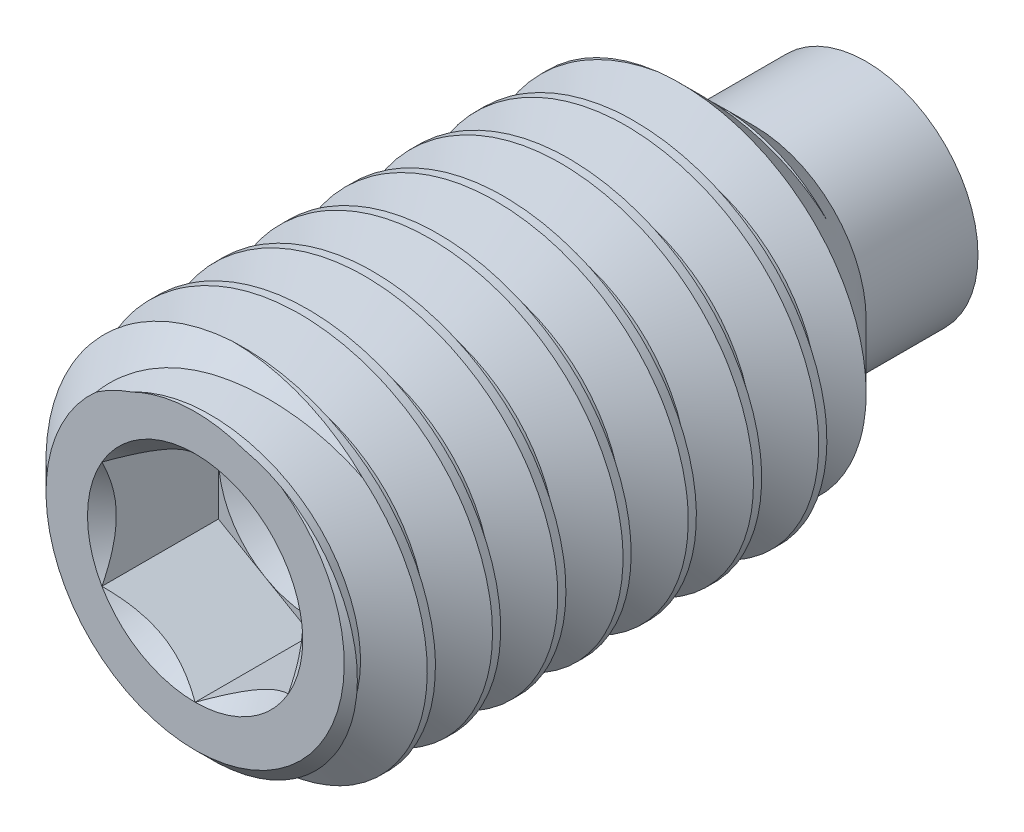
ISO-10303-21;
HEADER;
FILE_DESCRIPTION(('STEP AP214'),'2;1');
FILE_NAME('part.step','',(''),(''),'','','');
FILE_SCHEMA(('AUTOMOTIVE_DESIGN { 1 0 10303 214 1 1 1 1 }'));
ENDSEC;
DATA;
#1=APPLICATION_CONTEXT('core data for automotive mechanical design processes');
#2=APPLICATION_PROTOCOL_DEFINITION('international standard','automotive_design',2000,#1);
#3=PRODUCT_CONTEXT('',#1,'mechanical');
#4=PRODUCT('Part','Part','',(#3));
#5=PRODUCT_RELATED_PRODUCT_CATEGORY('part','',(#4));
#6=PRODUCT_DEFINITION_FORMATION('','',#4);
#7=PRODUCT_DEFINITION_CONTEXT('part definition',#1,'design');
#8=PRODUCT_DEFINITION('design','',#6,#7);
#9=PRODUCT_DEFINITION_SHAPE('','',#8);
#10=(LENGTH_UNIT() NAMED_UNIT(*) SI_UNIT(.MILLI.,.METRE.));
#11=(NAMED_UNIT(*) PLANE_ANGLE_UNIT() SI_UNIT($,.RADIAN.));
#12=(NAMED_UNIT(*) SI_UNIT($,.STERADIAN.) SOLID_ANGLE_UNIT());
#13=UNCERTAINTY_MEASURE_WITH_UNIT(LENGTH_MEASURE(1.E-05),#10,'distance_accuracy_value','');
#14=(GEOMETRIC_REPRESENTATION_CONTEXT(3) GLOBAL_UNCERTAINTY_ASSIGNED_CONTEXT((#13)) GLOBAL_UNIT_ASSIGNED_CONTEXT((#10,
#11,#12)) REPRESENTATION_CONTEXT('',''));
#15=CARTESIAN_POINT('',(0.,0.,0.));
#16=DIRECTION('',(0.,0.,1.));
#17=DIRECTION('',(1.,0.,0.));
#18=AXIS2_PLACEMENT_3D('',#15,#16,#17);
#19=CARTESIAN_POINT('',(1.,-0.577350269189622,2.35));
#20=DIRECTION('',(0.,0.,1.));
#21=DIRECTION('',(1.,0.,0.));
#22=AXIS2_PLACEMENT_3D('',#19,#20,#21);
#23=PLANE('',#22);
#24=CARTESIAN_POINT('',(0.,0.,2.35));
#25=DIRECTION('',(0.,0.,1.));
#26=DIRECTION('',(1.,0.,0.));
#27=AXIS2_PLACEMENT_3D('',#24,#25,#26);
#28=CIRCLE('',#27,0.999999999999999);
#29=CARTESIAN_POINT('',(1.,0.,2.35));
#30=VERTEX_POINT('',#29);
#31=CARTESIAN_POINT('',(0.5,0.866025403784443,2.35));
#32=VERTEX_POINT('',#31);
#33=EDGE_CURVE('E159',#30,#32,#28,.T.);
#34=ORIENTED_EDGE('',*,*,#33,.F.);
#35=DIRECTION('',(0.,1.,0.));
#36=VECTOR('',#35,1.);
#37=CARTESIAN_POINT('',(1.,-0.577350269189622,2.35));
#38=LINE('',#37,#36);
#39=CARTESIAN_POINT('',(1.,0.57735026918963,2.35));
#40=VERTEX_POINT('',#39);
#41=EDGE_CURVE('E188',#30,#40,#38,.T.);
#42=ORIENTED_EDGE('',*,*,#41,.T.);
#43=DIRECTION('',(-0.866025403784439,0.5,0.));
#44=VECTOR('',#43,1.);
#45=CARTESIAN_POINT('',(1.,0.57735026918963,2.35));
#46=LINE('',#45,#44);
#47=EDGE_CURVE('E182',#40,#32,#46,.T.);
#48=ORIENTED_EDGE('',*,*,#47,.T.);
#49=EDGE_LOOP('',(#34,#42,#48));
#50=FACE_BOUND('',#49,.T.);
#51=ADVANCED_FACE('F45',(#50),#23,.T.);
#52=CARTESIAN_POINT('',(-0.5,0.866025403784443,2.35));
#53=VERTEX_POINT('',#52);
#54=EDGE_CURVE('E161',#32,#53,#28,.T.);
#55=ORIENTED_EDGE('',*,*,#54,.F.);
#56=CARTESIAN_POINT('',(0.,1.15470053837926,2.35));
#57=VERTEX_POINT('',#56);
#58=EDGE_CURVE('E173',#32,#57,#46,.T.);
#59=ORIENTED_EDGE('',*,*,#58,.T.);
#60=DIRECTION('',(-0.866025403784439,-0.5,0.));
#61=VECTOR('',#60,1.);
#62=CARTESIAN_POINT('',(0.,1.15470053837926,2.35));
#63=LINE('',#62,#61);
#64=EDGE_CURVE('E176',#57,#53,#63,.T.);
#65=ORIENTED_EDGE('',*,*,#64,.T.);
#66=EDGE_LOOP('',(#55,#59,#65));
#67=FACE_BOUND('',#66,.T.);
#68=ADVANCED_FACE('F172',(#67),#23,.T.);
#69=CARTESIAN_POINT('',(-1.,0.,2.35));
#70=VERTEX_POINT('',#69);
#71=EDGE_CURVE('E177',#53,#70,#28,.T.);
#72=ORIENTED_EDGE('',*,*,#71,.F.);
#73=CARTESIAN_POINT('',(-1.,0.57735026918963,2.35));
#74=VERTEX_POINT('',#73);
#75=EDGE_CURVE('E190',#53,#74,#63,.T.);
#76=ORIENTED_EDGE('',*,*,#75,.T.);
#77=DIRECTION('',(0.,-1.,0.));
#78=VECTOR('',#77,1.);
#79=CARTESIAN_POINT('',(-1.,0.57735026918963,2.35));
#80=LINE('',#79,#78);
#81=EDGE_CURVE('E196',#74,#70,#80,.T.);
#82=ORIENTED_EDGE('',*,*,#81,.T.);
#83=EDGE_LOOP('',(#72,#76,#82));
#84=FACE_BOUND('',#83,.T.);
#85=ADVANCED_FACE('F390',(#84),#23,.T.);
#86=CARTESIAN_POINT('',(-0.5,-0.866025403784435,2.35));
#87=VERTEX_POINT('',#86);
#88=EDGE_CURVE('E415',#70,#87,#28,.T.);
#89=ORIENTED_EDGE('',*,*,#88,.F.);
#90=CARTESIAN_POINT('',(-1.,-0.577350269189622,2.35));
#91=VERTEX_POINT('',#90);
#92=EDGE_CURVE('E195',#70,#91,#80,.T.);
#93=ORIENTED_EDGE('',*,*,#92,.T.);
#94=DIRECTION('',(0.866025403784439,-0.5,0.));
#95=VECTOR('',#94,1.);
#96=CARTESIAN_POINT('',(-1.,-0.577350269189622,2.35));
#97=LINE('',#96,#95);
#98=EDGE_CURVE('E200',#91,#87,#97,.T.);
#99=ORIENTED_EDGE('',*,*,#98,.T.);
#100=EDGE_LOOP('',(#89,#93,#99));
#101=FACE_BOUND('',#100,.T.);
#102=ADVANCED_FACE('F404',(#101),#23,.T.);
#103=CARTESIAN_POINT('',(0.499999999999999,-0.866025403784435,2.35));
#104=VERTEX_POINT('',#103);
#105=EDGE_CURVE('E66',#87,#104,#28,.T.);
#106=ORIENTED_EDGE('',*,*,#105,.F.);
#107=CARTESIAN_POINT('',(0.,-1.15470053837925,2.35));
#108=VERTEX_POINT('',#107);
#109=EDGE_CURVE('E199',#87,#108,#97,.T.);
#110=ORIENTED_EDGE('',*,*,#109,.T.);
#111=DIRECTION('',(0.866025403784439,0.5,0.));
#112=VECTOR('',#111,1.);
#113=CARTESIAN_POINT('',(0.,-1.15470053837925,2.35));
#114=LINE('',#113,#112);
#115=EDGE_CURVE('E414',#108,#104,#114,.T.);
#116=ORIENTED_EDGE('',*,*,#115,.T.);
#117=EDGE_LOOP('',(#106,#110,#116));
#118=FACE_BOUND('',#117,.T.);
#119=ADVANCED_FACE('F370',(#118),#23,.T.);
#120=CARTESIAN_POINT('',(0.,0.,-2.4));
#121=DIRECTION('',(0.,0.,1.));
#122=DIRECTION('',(0.,-1.,0.));
#123=AXIS2_PLACEMENT_3D('',#120,#121,#122);
#124=CONICAL_SURFACE('',#123,1.2,0.785398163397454);
#125=CARTESIAN_POINT('',(0.,0.,-2.4));
#126=DIRECTION('',(0.,0.,-1.));
#127=DIRECTION('',(0.,1.,0.));
#128=AXIS2_PLACEMENT_3D('',#125,#126,#127);
#129=CIRCLE('',#128,1.2);
#130=CARTESIAN_POINT('',(0.,1.2,-2.4));
#131=VERTEX_POINT('',#130);
#132=EDGE_CURVE('E683',#131,#131,#129,.T.);
#133=ORIENTED_EDGE('',*,*,#132,.F.);
#134=EDGE_LOOP('',(#133));
#135=FACE_BOUND('',#134,.T.);
#136=CARTESIAN_POINT('',(0.0703988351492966,1.54373229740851,-2.05466333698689));
#137=CARTESIAN_POINT('',(0.0995863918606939,1.5423995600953,-2.05466333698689));
#138=CARTESIAN_POINT('',(0.128723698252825,1.54024218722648,-2.05466333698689));
#139=CARTESIAN_POINT('',(0.186868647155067,1.53427616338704,-2.05466333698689));
#140=CARTESIAN_POINT('',(0.21587606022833,1.53046527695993,-2.05466333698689));
#141=CARTESIAN_POINT('',(0.33041113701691,1.51208574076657,-2.05466333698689));
#142=CARTESIAN_POINT('',(0.41501038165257,1.49109178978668,-2.05466333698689));
#143=CARTESIAN_POINT('',(0.579583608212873,1.43517622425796,-2.05466333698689));
#144=CARTESIAN_POINT('',(0.659548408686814,1.40022797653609,-2.05466333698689));
#145=CARTESIAN_POINT('',(0.808850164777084,1.31934655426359,-2.05466333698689));
#146=CARTESIAN_POINT('',(0.8785122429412,1.2740174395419,-2.05466333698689));
#147=CARTESIAN_POINT('',(0.976802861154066,1.19818176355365,-2.05466333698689));
#148=CARTESIAN_POINT('',(1.00852893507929,1.17160016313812,-2.05466333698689));
#149=CARTESIAN_POINT('',(1.06975020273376,1.11597878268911,-2.05466333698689));
#150=CARTESIAN_POINT('',(1.09924530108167,1.08693889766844,-2.05466333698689));
#151=CARTESIAN_POINT('',(1.12753990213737,1.05674934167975,-2.05466333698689));
#152=B_SPLINE_CURVE_WITH_KNOTS('',3,(#136,#137,#138,#139,#140,#141,#142,#143,#144,#145,#146,
#147,#148,#149,#150,#151),.UNSPECIFIED.,.F.,.F.,(4,2,2,2,2,2,2,4),(0.,0.0876169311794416,
0.17535268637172,0.435468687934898,0.696083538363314,0.94425684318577,1.06831129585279,
1.19237104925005),.UNSPECIFIED.);
#153=CARTESIAN_POINT('',(0.0703989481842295,1.54373229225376,-2.05466334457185));
#154=VERTEX_POINT('',#153);
#155=CARTESIAN_POINT('',(1.12753987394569,1.05674937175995,-2.05466333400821));
#156=VERTEX_POINT('',#155);
#157=EDGE_CURVE('E352',#154,#156,#152,.T.);
#158=ORIENTED_EDGE('',*,*,#157,.T.);
#159=CARTESIAN_POINT('',(1.12753990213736,1.05674934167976,-2.05466333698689));
#160=CARTESIAN_POINT('',(1.10236122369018,1.09487380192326,-2.04696378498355));
#161=CARTESIAN_POINT('',(1.07556577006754,1.13189809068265,-2.03922718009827));
#162=CARTESIAN_POINT('',(1.01891626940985,1.20352173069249,-2.02372950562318));
#163=CARTESIAN_POINT('',(0.989062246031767,1.23812110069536,-2.01596843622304));
#164=CARTESIAN_POINT('',(0.895195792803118,1.33792277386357,-1.99272817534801));
#165=CARTESIAN_POINT('',(0.826861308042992,1.3991553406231,-1.97728653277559));
#166=CARTESIAN_POINT('',(0.680659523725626,1.5091543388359,-1.94691062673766));
#167=CARTESIAN_POINT('',(0.602788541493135,1.55791593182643,-1.93197656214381));
#168=CARTESIAN_POINT('',(0.480666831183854,1.62060371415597,-1.91022174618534));
#169=CARTESIAN_POINT('',(0.439081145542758,1.63975486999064,-1.90307899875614));
#170=CARTESIAN_POINT('',(0.354395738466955,1.67447099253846,-1.88903329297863));
#171=CARTESIAN_POINT('',(0.311296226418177,1.69003645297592,-1.88213030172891));
#172=CARTESIAN_POINT('',(0.223953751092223,1.71743995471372,-1.86861064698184));
#173=CARTESIAN_POINT('',(0.179712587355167,1.72928351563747,-1.86199357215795));
#174=CARTESIAN_POINT('',(0.112699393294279,1.74422451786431,-1.85228541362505));
#175=CARTESIAN_POINT('',(0.0902496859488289,1.74873459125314,-1.84908514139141));
#176=CARTESIAN_POINT('',(0.0451620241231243,1.75678554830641,-1.84278034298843));
#177=CARTESIAN_POINT('',(0.0225240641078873,1.76032640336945,-1.83967581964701));
#178=CARTESIAN_POINT('',(-0.0228993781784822,1.76651939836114,-1.833478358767));
#179=CARTESIAN_POINT('',(-0.0456849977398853,1.76917053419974,-1.83038543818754));
#180=CARTESIAN_POINT('',(-0.0913267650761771,1.77365832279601,-1.82413736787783));
#181=CARTESIAN_POINT('',(-0.114182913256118,1.77549497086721,-1.82098221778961));
#182=CARTESIAN_POINT('',(-0.182824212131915,1.77974859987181,-1.81146183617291));
#183=CARTESIAN_POINT('',(-0.228685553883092,1.78090971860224,-1.80504121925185));
#184=CARTESIAN_POINT('',(-0.323837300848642,1.779849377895,-1.7915888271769));
#185=CARTESIAN_POINT('',(-0.373123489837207,1.77736420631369,-1.78454768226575));
#186=CARTESIAN_POINT('',(-0.471324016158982,1.76853827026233,-1.77038497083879));
#187=CARTESIAN_POINT('',(-0.520238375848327,1.76219773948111,-1.76326340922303));
#188=CARTESIAN_POINT('',(-0.665973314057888,1.73743850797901,-1.74184876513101));
#189=CARTESIAN_POINT('',(-0.761874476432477,1.71328111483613,-1.72749315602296));
#190=CARTESIAN_POINT('',(-0.956643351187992,1.64757404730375,-1.69777772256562));
#191=CARTESIAN_POINT('',(-1.05507129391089,1.6047215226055,-1.68243615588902));
#192=CARTESIAN_POINT('',(-1.24326069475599,1.50291009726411,-1.65237249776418));
#193=CARTESIAN_POINT('',(-1.33303245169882,1.44397066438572,-1.63764968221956));
#194=CARTESIAN_POINT('',(-1.44062908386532,1.35946173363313,-1.61942823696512));
#195=CARTESIAN_POINT('',(-1.46370070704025,1.34043565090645,-1.61548351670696));
#196=CARTESIAN_POINT('',(-1.50888460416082,1.3013386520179,-1.60767918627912));
#197=CARTESIAN_POINT('',(-1.53099847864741,1.28126961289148,-1.60381943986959));
#198=CARTESIAN_POINT('',(-1.55263934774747,1.26067880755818,-1.60000000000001));
#199=B_SPLINE_CURVE_WITH_KNOTS('',3,(#159,#160,#161,#162,#163,#164,#165,#166,#167,#168,#169,
#170,#171,#172,#173,#174,#175,#176,#177,#178,#179,#180,#181,#182,#183,#184,#185,#186,#187,#188,
#189,#190,#191,#192,#193,#194,#195,#196,#197,#198),.UNSPECIFIED.,.F.,.F.,(4,2,2,2,2,2,2,2,2,2,2,
2,2,2,2,2,2,2,2,4),(0.,0.13891634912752,0.277831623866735,0.555566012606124,0.833407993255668,
0.972282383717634,1.11113764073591,1.24978599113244,1.31913088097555,1.38847781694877,
1.45790275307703,1.52732808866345,1.66616859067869,1.81555822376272,1.96493880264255,
2.26343400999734,2.58727982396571,2.91073545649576,3.00120530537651,3.09151762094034),.UNSPECIFIED.);
#200=CARTESIAN_POINT('',(-1.55263934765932,1.26067880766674,-1.60000000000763));
#201=VERTEX_POINT('',#200);
#202=EDGE_CURVE('E346',#156,#201,#199,.T.);
#203=ORIENTED_EDGE('',*,*,#202,.T.);
#204=CARTESIAN_POINT('',(0.,0.,-1.60000000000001));
#205=DIRECTION('',(0.,0.,-1.));
#206=DIRECTION('',(0.,1.,0.));
#207=AXIS2_PLACEMENT_3D('',#204,#205,#206);
#208=CIRCLE('',#207,2.);
#209=CARTESIAN_POINT('',(-0.239150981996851,1.98565022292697,-1.6));
#210=VERTEX_POINT('',#209);
#211=EDGE_CURVE('E299',#201,#210,#208,.T.);
#212=ORIENTED_EDGE('',*,*,#211,.T.);
#213=CARTESIAN_POINT('',(-0.2391509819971,1.98565022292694,-1.59999999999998));
#214=CARTESIAN_POINT('',(-0.214439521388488,1.98777949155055,-1.60084086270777));
#215=CARTESIAN_POINT('',(-0.189691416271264,1.98945202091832,-1.60167872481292));
#216=CARTESIAN_POINT('',(-0.140148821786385,1.991888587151,-1.60334097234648));
#217=CARTESIAN_POINT('',(-0.115354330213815,1.99265257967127,-1.60416535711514));
#218=CARTESIAN_POINT('',(-0.0409539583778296,1.99358887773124,-1.6066066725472));
#219=CARTESIAN_POINT('',(0.00867750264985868,1.99240624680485,-1.60819206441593));
#220=CARTESIAN_POINT('',(0.107730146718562,1.98626359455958,-1.61143553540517));
#221=CARTESIAN_POINT('',(0.157151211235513,1.98130167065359,-1.61309365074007));
#222=CARTESIAN_POINT('',(0.255460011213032,1.96763765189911,-1.6164693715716));
#223=CARTESIAN_POINT('',(0.30434772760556,1.95893542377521,-1.61818697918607));
#224=CARTESIAN_POINT('',(0.461915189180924,1.9246317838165,-1.62385325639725));
#225=CARTESIAN_POINT('',(0.569057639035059,1.89149510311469,-1.62791061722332));
#226=CARTESIAN_POINT('',(0.776026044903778,1.80744942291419,-1.63617262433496));
#227=CARTESIAN_POINT('',(0.875853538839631,1.75654417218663,-1.64037723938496));
#228=CARTESIAN_POINT('',(1.06388757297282,1.63938329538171,-1.64875125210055));
#229=CARTESIAN_POINT('',(1.15225087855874,1.57337907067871,-1.65292017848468));
#230=CARTESIAN_POINT('',(1.31669466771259,1.42738546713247,-1.66117195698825));
#231=CARTESIAN_POINT('',(1.39277087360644,1.34739123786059,-1.66525477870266));
#232=CARTESIAN_POINT('',(1.49595372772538,1.21875469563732,-1.67121667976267));
#233=CARTESIAN_POINT('',(1.52854351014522,1.17440372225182,-1.67317813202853));
#234=CARTESIAN_POINT('',(1.58988189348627,1.08309182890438,-1.67703445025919));
#235=CARTESIAN_POINT('',(1.61863046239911,1.03613088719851,-1.67892931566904));
#236=CARTESIAN_POINT('',(1.65869641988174,0.964017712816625,-1.68170710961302));
#237=CARTESIAN_POINT('',(1.67154175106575,0.939702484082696,-1.68262225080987));
#238=CARTESIAN_POINT('',(1.69614832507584,0.890530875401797,-1.68448189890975));
#239=CARTESIAN_POINT('',(1.7079096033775,0.865674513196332,-1.68542640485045));
#240=CARTESIAN_POINT('',(1.74153973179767,0.790374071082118,-1.68829023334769));
#241=CARTESIAN_POINT('',(1.76176257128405,0.739184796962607,-1.69024039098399));
#242=CARTESIAN_POINT('',(1.7973483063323,0.636084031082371,-1.6941818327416));
#243=CARTESIAN_POINT('',(1.81278503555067,0.584197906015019,-1.6961719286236));
#244=CARTESIAN_POINT('',(1.83913150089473,0.479302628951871,-1.70020772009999));
#245=CARTESIAN_POINT('',(1.85004104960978,0.426293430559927,-1.70225341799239));
#246=CARTESIAN_POINT('',(1.87583259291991,0.266158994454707,-1.70845378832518));
#247=CARTESIAN_POINT('',(1.88380970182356,0.157833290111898,-1.71267531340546));
#248=CARTESIAN_POINT('',(1.88107196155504,-0.0560997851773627,-1.72106936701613));
#249=CARTESIAN_POINT('',(1.87076623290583,-0.161714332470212,-1.72524091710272));
#250=CARTESIAN_POINT('',(1.8325294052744,-0.369798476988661,-1.73351537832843));
#251=CARTESIAN_POINT('',(1.80459580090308,-0.472267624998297,-1.73761827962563));
#252=CARTESIAN_POINT('',(1.75013268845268,-0.621278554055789,-1.74362131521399));
#253=CARTESIAN_POINT('',(1.7298680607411,-0.670195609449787,-1.74559828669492));
#254=CARTESIAN_POINT('',(1.68527893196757,-0.766162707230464,-1.74949224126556));
#255=CARTESIAN_POINT('',(1.66095428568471,-0.813212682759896,-1.7514092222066));
#256=CARTESIAN_POINT('',(1.60843800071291,-0.90509062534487,-1.75515170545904));
#257=CARTESIAN_POINT('',(1.58024734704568,-0.949919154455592,-1.75697723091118));
#258=CARTESIAN_POINT('',(1.52002882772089,-1.03691391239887,-1.76073842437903));
#259=CARTESIAN_POINT('',(1.48800131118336,-1.07908038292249,-1.76267408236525));
#260=CARTESIAN_POINT('',(1.42085317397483,-1.15986584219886,-1.76658838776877));
#261=CARTESIAN_POINT('',(1.38578283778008,-1.19852664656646,-1.76856603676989));
#262=CARTESIAN_POINT('',(1.3124416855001,-1.27266247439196,-1.7725828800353));
#263=CARTESIAN_POINT('',(1.27417067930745,-1.30813730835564,-1.77462207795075));
#264=CARTESIAN_POINT('',(1.15496986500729,-1.40936918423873,-1.78080868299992));
#265=CARTESIAN_POINT('',(1.0695861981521,-1.47001293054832,-1.78502894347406));
#266=CARTESIAN_POINT('',(0.892023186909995,-1.5742775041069,-1.79342306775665));
#267=CARTESIAN_POINT('',(0.800073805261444,-1.61829441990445,-1.79759535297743));
#268=CARTESIAN_POINT('',(0.609997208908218,-1.69027568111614,-1.80588738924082));
#269=CARTESIAN_POINT('',(0.511868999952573,-1.71823743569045,-1.81000713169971));
#270=CARTESIAN_POINT('',(0.36229112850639,-1.74751741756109,-1.81604984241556));
#271=CARTESIAN_POINT('',(0.311999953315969,-1.75516783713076,-1.81804254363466));
#272=CARTESIAN_POINT('',(0.21094493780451,-1.76620301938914,-1.82196812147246));
#273=CARTESIAN_POINT('',(0.16018125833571,-1.76958918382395,-1.8239010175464));
#274=CARTESIAN_POINT('',(0.0839706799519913,-1.77144861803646,-1.82674452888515));
#275=CARTESIAN_POINT('',(0.0585525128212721,-1.7715315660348,-1.82768319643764));
#276=CARTESIAN_POINT('',(0.0077392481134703,-1.77062667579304,-1.82953828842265));
#277=CARTESIAN_POINT('',(-0.0176558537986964,-1.76963912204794,-1.83045471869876));
#278=CARTESIAN_POINT('',(-0.0937300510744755,-1.76499859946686,-1.83324429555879));
#279=CARTESIAN_POINT('',(-0.144308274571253,-1.75966804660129,-1.83515807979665));
#280=CARTESIAN_POINT('',(-0.293825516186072,-1.73720937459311,-1.84096881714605));
#281=CARTESIAN_POINT('',(-0.391868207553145,-1.71364690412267,-1.84498121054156));
#282=CARTESIAN_POINT('',(-0.582334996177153,-1.64992145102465,-1.8532101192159));
#283=CARTESIAN_POINT('',(-0.674759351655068,-1.6097592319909,-1.85742662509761));
#284=CARTESIAN_POINT('',(-0.848675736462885,-1.51545806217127,-1.86581787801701));
#285=CARTESIAN_POINT('',(-0.930408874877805,-1.46176351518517,-1.86999022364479));
#286=CARTESIAN_POINT('',(-1.08370971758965,-1.34139235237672,-1.87829186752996));
#287=CARTESIAN_POINT('',(-1.155275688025,-1.27471352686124,-1.88242115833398));
#288=CARTESIAN_POINT('',(-1.28618551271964,-1.130259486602,-1.89053521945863));
#289=CARTESIAN_POINT('',(-1.34552690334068,-1.05248204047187,-1.89451996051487));
#290=CARTESIAN_POINT('',(-1.45035076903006,-0.888074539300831,-1.90214464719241));
#291=CARTESIAN_POINT('',(-1.49583757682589,-0.801447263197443,-1.90578470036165));
#292=CARTESIAN_POINT('',(-1.57048508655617,-0.622394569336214,-1.91343737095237));
#293=CARTESIAN_POINT('',(-1.59979867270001,-0.530032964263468,-1.91744606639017));
#294=CARTESIAN_POINT('',(-1.64194270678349,-0.341642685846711,-1.92566465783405));
#295=CARTESIAN_POINT('',(-1.65477454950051,-0.245614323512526,-1.92987453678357));
#296=CARTESIAN_POINT('',(-1.66341430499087,-0.0560240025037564,-1.93825614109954));
#297=CARTESIAN_POINT('',(-1.65977434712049,0.0375137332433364,-1.94242447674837));
#298=CARTESIAN_POINT('',(-1.63680699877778,0.22271334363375,-1.95073916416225));
#299=CARTESIAN_POINT('',(-1.61747698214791,0.314374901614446,-1.95488551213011));
#300=CARTESIAN_POINT('',(-1.57717868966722,0.448370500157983,-1.96099245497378));
#301=CARTESIAN_POINT('',(-1.56185181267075,0.492473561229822,-1.96301029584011));
#302=CARTESIAN_POINT('',(-1.52753021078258,0.579247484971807,-1.96699470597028));
#303=CARTESIAN_POINT('',(-1.50853520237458,0.621918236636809,-1.96896127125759));
#304=CARTESIAN_POINT('',(-1.46701490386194,0.705499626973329,-1.97282808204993));
#305=CARTESIAN_POINT('',(-1.44449037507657,0.746410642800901,-1.97472834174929));
#306=CARTESIAN_POINT('',(-1.4081852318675,0.806237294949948,-1.97751393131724));
#307=CARTESIAN_POINT('',(-1.39566353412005,0.825923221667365,-1.97843167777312));
#308=CARTESIAN_POINT('',(-1.369759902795,0.864720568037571,-1.98029647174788));
#309=CARTESIAN_POINT('',(-1.35637781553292,0.883831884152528,-1.98124352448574));
#310=CARTESIAN_POINT('',(-1.28781887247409,0.977266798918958,-1.98600198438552));
#311=CARTESIAN_POINT('',(-1.22642280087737,1.04719422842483,-1.98997624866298));
#312=CARTESIAN_POINT('',(-1.09243622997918,1.17518182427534,-1.99816096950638));
#313=CARTESIAN_POINT('',(-1.01984760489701,1.23324397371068,-2.00237138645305));
#314=CARTESIAN_POINT('',(-0.868536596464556,1.3338992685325,-2.01074818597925));
#315=CARTESIAN_POINT('',(-0.790145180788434,1.37698976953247,-2.01491032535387));
#316=CARTESIAN_POINT('',(-0.627239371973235,1.44938478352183,-2.02322755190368));
#317=CARTESIAN_POINT('',(-0.542724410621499,1.47868801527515,-2.02738263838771));
#318=CARTESIAN_POINT('',(-0.37058887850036,1.52250747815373,-2.03553034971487));
#319=CARTESIAN_POINT('',(-0.282997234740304,1.53713584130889,-2.0395239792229));
#320=CARTESIAN_POINT('',(-0.150749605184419,1.5479722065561,-2.04533605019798));
#321=CARTESIAN_POINT('',(-0.106489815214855,1.54973040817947,-2.04724505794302));
#322=CARTESIAN_POINT('',(-0.0401024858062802,1.54960092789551,-2.05003774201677));
#323=CARTESIAN_POINT('',(-0.0179717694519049,1.54909646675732,-2.05095691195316));
#324=CARTESIAN_POINT('',(0.0262527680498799,1.54713576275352,-2.05279978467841));
#325=CARTESIAN_POINT('',(0.0483465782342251,1.54567927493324,-2.05372348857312));
#326=CARTESIAN_POINT('',(0.0703988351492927,1.54373229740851,-2.05466333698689));
#327=B_SPLINE_CURVE_WITH_KNOTS('',3,(#213,#214,#215,#216,#217,#218,#219,#220,#221,#222,#223,
#224,#225,#226,#227,#228,#229,#230,#231,#232,#233,#234,#235,#236,#237,#238,#239,#240,#241,#242,
#243,#244,#245,#246,#247,#248,#249,#250,#251,#252,#253,#254,#255,#256,#257,#258,#259,#260,#261,
#262,#263,#264,#265,#266,#267,#268,#269,#270,#271,#272,#273,#274,#275,#276,#277,#278,#279,#280,
#281,#282,#283,#284,#285,#286,#287,#288,#289,#290,#291,#292,#293,#294,#295,#296,#297,#298,#299,
#300,#301,#302,#303,#304,#305,#306,#307,#308,#309,#310,#311,#312,#313,#314,#315,#316,#317,#318,
#319,#320,#321,#322,#323,#324,#325,#326),.UNSPECIFIED.,.F.,.F.,(4,2,2,2,2,2,2,2,2,2,2,2,2,2,2,2,
2,2,2,2,2,2,2,2,2,2,2,2,2,2,2,2,2,2,2,2,2,2,2,2,2,2,2,2,2,2,2,2,2,2,2,2,2,2,2,2,4),(0.,
0.0744421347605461,0.148887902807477,0.297753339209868,0.446693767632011,0.595639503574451,
0.93050525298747,1.26530039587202,1.59488168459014,1.92457746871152,2.08963746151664,
2.25469882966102,2.33722214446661,2.41974275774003,2.58473662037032,2.7470414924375,
2.90935308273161,3.23368293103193,3.55084642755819,3.86805501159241,4.02685639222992,
4.18566345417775,4.34443012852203,4.50318236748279,4.65968411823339,4.81619517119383,
5.12891144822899,5.43362117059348,5.73838005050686,5.8909628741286,6.04349552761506,
6.1197846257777,6.19605345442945,6.34856048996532,6.64966223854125,6.95075013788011,
7.24300866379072,7.53531697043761,7.8276841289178,8.11995976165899,8.40942301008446,
8.69886176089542,8.97867183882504,9.2585287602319,9.39859388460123,9.53866983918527,
9.67871562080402,9.74874113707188,9.81877919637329,10.0965869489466,10.3743482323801,
10.6417204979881,10.9091176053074,11.1744555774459,11.3073262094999,11.373773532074,
11.4402379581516),.UNSPECIFIED.);
#328=EDGE_CURVE('E227',#210,#154,#327,.T.);
#329=ORIENTED_EDGE('',*,*,#328,.T.);
#330=EDGE_LOOP('',(#158,#203,#212,#329));
#331=FACE_BOUND('',#330,.T.);
#332=ADVANCED_FACE('F351',(#135,#331),#124,.T.);
#333=CARTESIAN_POINT('',(0.,0.,-3.6));
#334=DIRECTION('',(0.,0.,-1.));
#335=DIRECTION('',(0.,1.,0.));
#336=AXIS2_PLACEMENT_3D('',#333,#334,#335);
#337=CYLINDRICAL_SURFACE('',#336,2.);
#338=ORIENTED_EDGE('',*,*,#211,.F.);
#339=CARTESIAN_POINT('',(0.,2.,-2.4));
#340=CARTESIAN_POINT('',(-1.15470053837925,2.,-2.34166666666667));
#341=CARTESIAN_POINT('',(-1.73205080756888,0.999999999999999,-2.28333333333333));
#342=CARTESIAN_POINT('',(-2.3094010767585,0.,-2.225));
#343=CARTESIAN_POINT('',(-1.73205080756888,-0.999999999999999,-2.16666666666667));
#344=CARTESIAN_POINT('',(-1.15470053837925,-2.,-2.10833333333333));
#345=CARTESIAN_POINT('',(0.,-2.,-2.05));
#346=CARTESIAN_POINT('',(1.15470053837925,-2.,-1.99166666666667));
#347=CARTESIAN_POINT('',(1.73205080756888,-1.,-1.93333333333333));
#348=CARTESIAN_POINT('',(2.3094010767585,0.,-1.875));
#349=CARTESIAN_POINT('',(1.73205080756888,0.999999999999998,-1.81666666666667));
#350=CARTESIAN_POINT('',(1.15470053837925,2.,-1.75833333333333));
#351=CARTESIAN_POINT('',(0.,2.,-1.7));
#352=CARTESIAN_POINT('',(-1.15470053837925,2.,-1.64166666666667));
#353=CARTESIAN_POINT('',(-1.73205080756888,0.999999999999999,-1.58333333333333));
#354=CARTESIAN_POINT('',(-2.3094010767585,0.,-1.525));
#355=CARTESIAN_POINT('',(-1.73205080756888,-0.999999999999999,-1.46666666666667));
#356=CARTESIAN_POINT('',(-1.15470053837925,-2.,-1.40833333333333));
#357=CARTESIAN_POINT('',(0.,-2.,-1.35));
#358=CARTESIAN_POINT('',(1.15470053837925,-2.,-1.29166666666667));
#359=CARTESIAN_POINT('',(1.73205080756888,-1.,-1.23333333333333));
#360=CARTESIAN_POINT('',(2.3094010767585,0.,-1.175));
#361=CARTESIAN_POINT('',(1.73205080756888,0.999999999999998,-1.11666666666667));
#362=CARTESIAN_POINT('',(1.15470053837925,2.,-1.05833333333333));
#363=CARTESIAN_POINT('',(0.,2.,-1.));
#364=CARTESIAN_POINT('',(-1.15470053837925,2.,-0.941666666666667));
#365=CARTESIAN_POINT('',(-1.73205080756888,0.999999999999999,-0.883333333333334));
#366=CARTESIAN_POINT('',(-2.3094010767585,0.,-0.825000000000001));
#367=CARTESIAN_POINT('',(-1.73205080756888,-0.999999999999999,-0.766666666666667));
#368=CARTESIAN_POINT('',(-1.15470053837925,-2.,-0.708333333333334));
#369=CARTESIAN_POINT('',(0.,-2.,-0.650000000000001));
#370=CARTESIAN_POINT('',(1.15470053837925,-2.,-0.591666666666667));
#371=CARTESIAN_POINT('',(1.73205080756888,-1.,-0.533333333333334));
#372=CARTESIAN_POINT('',(2.3094010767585,0.,-0.475000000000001));
#373=CARTESIAN_POINT('',(1.73205080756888,0.999999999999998,-0.416666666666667));
#374=CARTESIAN_POINT('',(1.15470053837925,2.,-0.358333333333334));
#375=CARTESIAN_POINT('',(0.,2.,-0.300000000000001));
#376=CARTESIAN_POINT('',(-1.15470053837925,2.,-0.241666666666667));
#377=CARTESIAN_POINT('',(-1.73205080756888,0.999999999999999,-0.183333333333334));
#378=CARTESIAN_POINT('',(-2.3094010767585,0.,-0.125000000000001));
#379=CARTESIAN_POINT('',(-1.73205080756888,-0.999999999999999,-0.0666666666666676));
#380=CARTESIAN_POINT('',(-1.15470053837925,-2.,-0.00833333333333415));
#381=CARTESIAN_POINT('',(0.,-2.,0.0499999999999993));
#382=CARTESIAN_POINT('',(1.15470053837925,-2.,0.108333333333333));
#383=CARTESIAN_POINT('',(1.73205080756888,-1.,0.166666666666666));
#384=CARTESIAN_POINT('',(2.3094010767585,0.,0.225));
#385=CARTESIAN_POINT('',(1.73205080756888,0.999999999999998,0.283333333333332));
#386=CARTESIAN_POINT('',(1.15470053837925,2.,0.341666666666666));
#387=CARTESIAN_POINT('',(0.,2.,0.399999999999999));
#388=CARTESIAN_POINT('',(-1.15470053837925,2.,0.458333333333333));
#389=CARTESIAN_POINT('',(-1.73205080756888,0.999999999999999,0.516666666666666));
#390=CARTESIAN_POINT('',(-2.3094010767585,0.,0.574999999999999));
#391=CARTESIAN_POINT('',(-1.73205080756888,-0.999999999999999,0.633333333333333));
#392=CARTESIAN_POINT('',(-1.15470053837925,-2.,0.691666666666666));
#393=CARTESIAN_POINT('',(0.,-2.,0.749999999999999));
#394=CARTESIAN_POINT('',(1.15470053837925,-2.,0.808333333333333));
#395=CARTESIAN_POINT('',(1.73205080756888,-1.,0.866666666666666));
#396=CARTESIAN_POINT('',(2.3094010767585,0.,0.924999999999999));
#397=CARTESIAN_POINT('',(1.73205080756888,0.999999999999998,0.983333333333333));
#398=CARTESIAN_POINT('',(1.15470053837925,2.,1.04166666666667));
#399=CARTESIAN_POINT('',(0.,2.,1.1));
#400=CARTESIAN_POINT('',(-1.15470053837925,2.,1.15833333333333));
#401=CARTESIAN_POINT('',(-1.73205080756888,0.999999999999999,1.21666666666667));
#402=CARTESIAN_POINT('',(-2.3094010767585,0.,1.275));
#403=CARTESIAN_POINT('',(-1.73205080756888,-0.999999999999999,1.33333333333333));
#404=CARTESIAN_POINT('',(-1.15470053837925,-2.,1.39166666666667));
#405=CARTESIAN_POINT('',(0.,-2.,1.45));
#406=CARTESIAN_POINT('',(1.15470053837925,-2.,1.50833333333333));
#407=CARTESIAN_POINT('',(1.73205080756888,-1.,1.56666666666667));
#408=CARTESIAN_POINT('',(2.3094010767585,0.,1.625));
#409=CARTESIAN_POINT('',(1.73205080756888,0.999999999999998,1.68333333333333));
#410=CARTESIAN_POINT('',(1.15470053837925,2.,1.74166666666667));
#411=CARTESIAN_POINT('',(0.,2.,1.8));
#412=CARTESIAN_POINT('',(-1.15470053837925,2.,1.85833333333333));
#413=CARTESIAN_POINT('',(-1.73205080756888,0.999999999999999,1.91666666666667));
#414=CARTESIAN_POINT('',(-2.3094010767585,0.,1.975));
#415=CARTESIAN_POINT('',(-1.73205080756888,-0.999999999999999,2.03333333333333));
#416=CARTESIAN_POINT('',(-1.15470053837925,-2.,2.09166666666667));
#417=CARTESIAN_POINT('',(0.,-2.,2.15));
#418=CARTESIAN_POINT('',(1.15470053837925,-2.,2.20833333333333));
#419=CARTESIAN_POINT('',(1.73205080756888,-1.,2.26666666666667));
#420=CARTESIAN_POINT('',(2.3094010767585,0.,2.325));
#421=CARTESIAN_POINT('',(1.73205080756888,0.999999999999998,2.38333333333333));
#422=CARTESIAN_POINT('',(1.15470053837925,2.,2.44166666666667));
#423=CARTESIAN_POINT('',(0.,2.,2.5));
#424=CARTESIAN_POINT('',(-1.15470053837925,2.,2.55833333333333));
#425=CARTESIAN_POINT('',(-1.73205080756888,0.999999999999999,2.61666666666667));
#426=CARTESIAN_POINT('',(-2.3094010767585,0.,2.675));
#427=CARTESIAN_POINT('',(-1.73205080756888,-0.999999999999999,2.73333333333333));
#428=CARTESIAN_POINT('',(-1.15470053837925,-2.,2.79166666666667));
#429=CARTESIAN_POINT('',(0.,-2.,2.85));
#430=CARTESIAN_POINT('',(1.15470053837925,-2.,2.90833333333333));
#431=CARTESIAN_POINT('',(1.73205080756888,-1.,2.96666666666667));
#432=CARTESIAN_POINT('',(2.3094010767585,0.,3.025));
#433=CARTESIAN_POINT('',(1.73205080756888,0.999999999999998,3.08333333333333));
#434=CARTESIAN_POINT('',(1.15470053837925,2.,3.14166666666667));
#435=CARTESIAN_POINT('',(0.,2.,3.2));
#436=CARTESIAN_POINT('',(-1.15470053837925,2.,3.25833333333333));
#437=CARTESIAN_POINT('',(-1.73205080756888,0.999999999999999,3.31666666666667));
#438=CARTESIAN_POINT('',(-2.3094010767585,0.,3.375));
#439=CARTESIAN_POINT('',(-1.73205080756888,-0.999999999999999,3.43333333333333));
#440=CARTESIAN_POINT('',(-1.15470053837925,-2.,3.49166666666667));
#441=CARTESIAN_POINT('',(0.,-2.,3.55));
#442=CARTESIAN_POINT('',(1.15470053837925,-2.,3.60833333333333));
#443=CARTESIAN_POINT('',(1.73205080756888,-1.,3.66666666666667));
#444=CARTESIAN_POINT('',(2.3094010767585,0.,3.725));
#445=CARTESIAN_POINT('',(1.73205080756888,0.999999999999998,3.78333333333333));
#446=CARTESIAN_POINT('',(1.15470053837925,2.,3.84166666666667));
#447=CARTESIAN_POINT('',(0.,2.,3.9));
#448=CARTESIAN_POINT('',(-1.15470053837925,2.,3.95833333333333));
#449=CARTESIAN_POINT('',(-1.73205080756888,0.999999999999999,4.01666666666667));
#450=CARTESIAN_POINT('',(-2.3094010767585,0.,4.075));
#451=CARTESIAN_POINT('',(-1.73205080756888,-0.999999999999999,4.13333333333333));
#452=CARTESIAN_POINT('',(-1.15470053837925,-2.,4.19166666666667));
#453=CARTESIAN_POINT('',(0.,-2.,4.25));
#454=CARTESIAN_POINT('',(0.456498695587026,-2.,4.27306146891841));
#455=CARTESIAN_POINT('',(0.867787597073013,-1.80192804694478,4.29961612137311));
#456=(BOUNDED_CURVE() B_SPLINE_CURVE(2,(#339,#340,#341,#342,#343,#344,#345,#346,#347,#348,#349,
#350,#351,#352,#353,#354,#355,#356,#357,#358,#359,#360,#361,#362,#363,#364,#365,#366,#367,#368,
#369,#370,#371,#372,#373,#374,#375,#376,#377,#378,#379,#380,#381,#382,#383,#384,#385,#386,#387,
#388,#389,#390,#391,#392,#393,#394,#395,#396,#397,#398,#399,#400,#401,#402,#403,#404,#405,#406,
#407,#408,#409,#410,#411,#412,#413,#414,#415,#416,#417,#418,#419,#420,#421,#422,#423,#424,#425,
#426,#427,#428,#429,#430,#431,#432,#433,#434,#435,#436,#437,#438,#439,#440,#441,#442,#443,#444,
#445,#446,#447,#448,#449,#450,#451,#452,#453,#454,#455),.UNSPECIFIED.,.F.,
.F.) B_SPLINE_CURVE_WITH_KNOTS((3,2,2,2,2,2,2,2,2,2,2,2,2,2,2,2,2,2,2,2,2,2,2,2,2,2,2,2,2,2,2,2,
2,2,2,2,2,2,2,2,2,2,2,2,2,2,2,2,2,2,2,2,2,2,2,2,2,2,3),(0.,0.0166666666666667,
0.0333333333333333,0.05,0.0666666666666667,0.0833333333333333,0.1,0.116666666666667,
0.133333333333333,0.15,0.166666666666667,0.183333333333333,0.2,0.216666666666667,
0.233333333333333,0.25,0.266666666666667,0.283333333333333,0.3,0.316666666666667,
0.333333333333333,0.35,0.366666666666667,0.383333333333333,0.4,0.416666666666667,
0.433333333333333,0.45,0.466666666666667,0.483333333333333,0.5,0.516666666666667,
0.533333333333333,0.55,0.566666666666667,0.583333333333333,0.6,0.616666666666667,
0.633333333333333,0.65,0.666666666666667,0.683333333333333,0.7,0.716666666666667,
0.733333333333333,0.75,0.766666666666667,0.783333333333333,0.8,0.816666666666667,
0.833333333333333,0.85,0.866666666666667,0.883333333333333,0.9,0.916666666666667,
0.933333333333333,0.95,0.957169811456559),
.UNSPECIFIED.) CURVE() GEOMETRIC_REPRESENTATION_ITEM() RATIONAL_B_SPLINE_CURVE((1.,
0.866025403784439,1.,0.866025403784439,1.,0.866025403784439,1.,0.866025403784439,1.,
0.866025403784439,1.,0.866025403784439,1.,0.866025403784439,1.,0.866025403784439,1.,
0.866025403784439,1.,0.866025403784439,1.,0.866025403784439,1.,0.866025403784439,1.,
0.866025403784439,1.,0.866025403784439,1.,0.866025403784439,1.,0.866025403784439,1.,
0.866025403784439,1.,0.866025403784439,1.,0.866025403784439,1.,0.866025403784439,1.,
0.866025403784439,1.,0.866025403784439,1.,0.866025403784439,1.,0.866025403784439,1.,
0.866025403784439,1.,0.866025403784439,1.,0.866025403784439,1.,0.866025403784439,1.,
0.866025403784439,1.,0.866025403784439,1.,0.866025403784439,1.,0.866025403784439,1.,
0.866025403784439,1.,0.866025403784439,1.,0.866025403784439,1.,0.866025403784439,1.,
0.866025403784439,1.,0.866025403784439,1.,0.866025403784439,1.,0.866025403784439,1.,
0.866025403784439,1.,0.866025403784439,1.,0.866025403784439,1.,0.866025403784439,1.,
0.866025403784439,1.,0.866025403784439,1.,0.866025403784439,1.,0.866025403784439,1.,
0.866025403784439,1.,0.866025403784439,1.,0.866025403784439,1.,0.866025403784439,1.,
0.866025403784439,1.,0.866025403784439,1.,0.866025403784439,1.,0.866025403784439,1.,
0.866025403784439,1.,0.942365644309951,0.934318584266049)) REPRESENTATION_ITEM(''));
#457=CARTESIAN_POINT('',(0.,2.,3.2));
#458=VERTEX_POINT('',#457);
#459=EDGE_CURVE('E305',#201,#458,#456,.T.);
#460=ORIENTED_EDGE('',*,*,#459,.T.);
#461=CARTESIAN_POINT('',(0.,0.,3.2));
#462=DIRECTION('',(0.,0.,-1.));
#463=DIRECTION('',(0.,1.,0.));
#464=AXIS2_PLACEMENT_3D('',#461,#462,#463);
#465=CIRCLE('',#464,2.);
#466=CARTESIAN_POINT('',(1.40125853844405,1.42705098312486,3.2));
#467=VERTEX_POINT('',#466);
#468=EDGE_CURVE('E296',#458,#467,#465,.T.);
#469=ORIENTED_EDGE('',*,*,#468,.T.);
#470=CARTESIAN_POINT('',(0.,2.,-3.0125));
#471=CARTESIAN_POINT('',(-1.15470053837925,2.,-2.95416666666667));
#472=CARTESIAN_POINT('',(-1.73205080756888,1.,-2.89583333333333));
#473=CARTESIAN_POINT('',(-2.3094010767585,0.,-2.8375));
#474=CARTESIAN_POINT('',(-1.73205080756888,-0.999999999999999,-2.77916666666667));
#475=CARTESIAN_POINT('',(-1.15470053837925,-2.,-2.72083333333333));
#476=CARTESIAN_POINT('',(0.,-2.,-2.6625));
#477=CARTESIAN_POINT('',(1.15470053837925,-2.,-2.60416666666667));
#478=CARTESIAN_POINT('',(1.73205080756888,-1.,-2.54583333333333));
#479=CARTESIAN_POINT('',(2.3094010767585,0.,-2.4875));
#480=CARTESIAN_POINT('',(1.73205080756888,0.999999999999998,-2.42916666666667));
#481=CARTESIAN_POINT('',(1.15470053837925,2.,-2.37083333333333));
#482=CARTESIAN_POINT('',(0.,2.,-2.3125));
#483=CARTESIAN_POINT('',(-1.15470053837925,2.,-2.25416666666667));
#484=CARTESIAN_POINT('',(-1.73205080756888,1.,-2.19583333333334));
#485=CARTESIAN_POINT('',(-2.3094010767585,0.,-2.1375));
#486=CARTESIAN_POINT('',(-1.73205080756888,-0.999999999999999,-2.07916666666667));
#487=CARTESIAN_POINT('',(-1.15470053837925,-2.,-2.02083333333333));
#488=CARTESIAN_POINT('',(0.,-2.,-1.9625));
#489=CARTESIAN_POINT('',(1.15470053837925,-2.,-1.90416666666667));
#490=CARTESIAN_POINT('',(1.73205080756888,-1.,-1.84583333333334));
#491=CARTESIAN_POINT('',(2.3094010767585,0.,-1.7875));
#492=CARTESIAN_POINT('',(1.73205080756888,0.999999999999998,-1.72916666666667));
#493=CARTESIAN_POINT('',(1.15470053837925,2.,-1.67083333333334));
#494=CARTESIAN_POINT('',(0.,2.,-1.6125));
#495=CARTESIAN_POINT('',(-1.15470053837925,2.,-1.55416666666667));
#496=CARTESIAN_POINT('',(-1.73205080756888,1.,-1.49583333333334));
#497=CARTESIAN_POINT('',(-2.3094010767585,0.,-1.4375));
#498=CARTESIAN_POINT('',(-1.73205080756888,-0.999999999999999,-1.37916666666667));
#499=CARTESIAN_POINT('',(-1.15470053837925,-2.,-1.32083333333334));
#500=CARTESIAN_POINT('',(0.,-2.,-1.2625));
#501=CARTESIAN_POINT('',(1.15470053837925,-2.,-1.20416666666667));
#502=CARTESIAN_POINT('',(1.73205080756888,-1.,-1.14583333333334));
#503=CARTESIAN_POINT('',(2.3094010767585,0.,-1.0875));
#504=CARTESIAN_POINT('',(1.73205080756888,0.999999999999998,-1.02916666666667));
#505=CARTESIAN_POINT('',(1.15470053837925,2.,-0.970833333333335));
#506=CARTESIAN_POINT('',(0.,2.,-0.912500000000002));
#507=CARTESIAN_POINT('',(-1.15470053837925,2.,-0.854166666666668));
#508=CARTESIAN_POINT('',(-1.73205080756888,1.,-0.795833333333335));
#509=CARTESIAN_POINT('',(-2.3094010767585,0.,-0.737500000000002));
#510=CARTESIAN_POINT('',(-1.73205080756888,-0.999999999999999,-0.679166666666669));
#511=CARTESIAN_POINT('',(-1.15470053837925,-2.,-0.620833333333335));
#512=CARTESIAN_POINT('',(0.,-2.,-0.562500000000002));
#513=CARTESIAN_POINT('',(1.15470053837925,-2.,-0.504166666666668));
#514=CARTESIAN_POINT('',(1.73205080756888,-1.,-0.445833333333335));
#515=CARTESIAN_POINT('',(2.3094010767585,0.,-0.387500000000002));
#516=CARTESIAN_POINT('',(1.73205080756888,0.999999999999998,-0.329166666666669));
#517=CARTESIAN_POINT('',(1.15470053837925,2.,-0.270833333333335));
#518=CARTESIAN_POINT('',(0.,2.,-0.212500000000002));
#519=CARTESIAN_POINT('',(-1.15470053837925,2.,-0.154166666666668));
#520=CARTESIAN_POINT('',(-1.73205080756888,1.,-0.0958333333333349));
#521=CARTESIAN_POINT('',(-2.3094010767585,0.,-0.0375000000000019));
#522=CARTESIAN_POINT('',(-1.73205080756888,-0.999999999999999,0.0208333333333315));
#523=CARTESIAN_POINT('',(-1.15470053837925,-2.,0.0791666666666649));
#524=CARTESIAN_POINT('',(0.,-2.,0.137499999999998));
#525=CARTESIAN_POINT('',(1.15470053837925,-2.,0.195833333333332));
#526=CARTESIAN_POINT('',(1.73205080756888,-1.,0.254166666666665));
#527=CARTESIAN_POINT('',(2.3094010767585,0.,0.312499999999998));
#528=CARTESIAN_POINT('',(1.73205080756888,0.999999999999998,0.370833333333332));
#529=CARTESIAN_POINT('',(1.15470053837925,2.,0.429166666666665));
#530=CARTESIAN_POINT('',(0.,2.,0.487499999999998));
#531=CARTESIAN_POINT('',(-1.15470053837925,2.,0.545833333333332));
#532=CARTESIAN_POINT('',(-1.73205080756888,1.,0.604166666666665));
#533=CARTESIAN_POINT('',(-2.3094010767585,0.,0.662499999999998));
#534=CARTESIAN_POINT('',(-1.73205080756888,-0.999999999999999,0.720833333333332));
#535=CARTESIAN_POINT('',(-1.15470053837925,-2.,0.779166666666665));
#536=CARTESIAN_POINT('',(0.,-2.,0.837499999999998));
#537=CARTESIAN_POINT('',(1.15470053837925,-2.,0.895833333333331));
#538=CARTESIAN_POINT('',(1.73205080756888,-1.,0.954166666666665));
#539=CARTESIAN_POINT('',(2.3094010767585,0.,1.0125));
#540=CARTESIAN_POINT('',(1.73205080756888,0.999999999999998,1.07083333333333));
#541=CARTESIAN_POINT('',(1.15470053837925,2.,1.12916666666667));
#542=CARTESIAN_POINT('',(0.,2.,1.1875));
#543=CARTESIAN_POINT('',(-1.15470053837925,2.,1.24583333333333));
#544=CARTESIAN_POINT('',(-1.73205080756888,1.,1.30416666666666));
#545=CARTESIAN_POINT('',(-2.3094010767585,0.,1.3625));
#546=CARTESIAN_POINT('',(-1.73205080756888,-0.999999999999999,1.42083333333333));
#547=CARTESIAN_POINT('',(-1.15470053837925,-2.,1.47916666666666));
#548=CARTESIAN_POINT('',(0.,-2.,1.5375));
#549=CARTESIAN_POINT('',(1.15470053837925,-2.,1.59583333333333));
#550=CARTESIAN_POINT('',(1.73205080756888,-1.,1.65416666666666));
#551=CARTESIAN_POINT('',(2.3094010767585,0.,1.7125));
#552=CARTESIAN_POINT('',(1.73205080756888,0.999999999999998,1.77083333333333));
#553=CARTESIAN_POINT('',(1.15470053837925,2.,1.82916666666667));
#554=CARTESIAN_POINT('',(0.,2.,1.8875));
#555=CARTESIAN_POINT('',(-1.15470053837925,2.,1.94583333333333));
#556=CARTESIAN_POINT('',(-1.73205080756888,1.,2.00416666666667));
#557=CARTESIAN_POINT('',(-2.3094010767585,0.,2.0625));
#558=CARTESIAN_POINT('',(-1.73205080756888,-0.999999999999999,2.12083333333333));
#559=CARTESIAN_POINT('',(-1.15470053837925,-2.,2.17916666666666));
#560=CARTESIAN_POINT('',(0.,-2.,2.2375));
#561=CARTESIAN_POINT('',(1.15470053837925,-2.,2.29583333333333));
#562=CARTESIAN_POINT('',(1.73205080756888,-1.,2.35416666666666));
#563=CARTESIAN_POINT('',(2.3094010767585,0.,2.4125));
#564=CARTESIAN_POINT('',(1.73205080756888,0.999999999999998,2.47083333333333));
#565=CARTESIAN_POINT('',(1.15470053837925,2.,2.52916666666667));
#566=CARTESIAN_POINT('',(0.,2.,2.5875));
#567=CARTESIAN_POINT('',(-1.15470053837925,2.,2.64583333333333));
#568=CARTESIAN_POINT('',(-1.73205080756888,1.,2.70416666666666));
#569=CARTESIAN_POINT('',(-2.3094010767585,0.,2.7625));
#570=CARTESIAN_POINT('',(-1.73205080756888,-0.999999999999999,2.82083333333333));
#571=CARTESIAN_POINT('',(-1.15470053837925,-2.,2.87916666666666));
#572=CARTESIAN_POINT('',(0.,-2.,2.9375));
#573=CARTESIAN_POINT('',(1.15470053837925,-2.,2.99583333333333));
#574=CARTESIAN_POINT('',(1.73205080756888,-1.,3.05416666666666));
#575=CARTESIAN_POINT('',(2.3094010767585,0.,3.1125));
#576=CARTESIAN_POINT('',(1.73205080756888,0.999999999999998,3.17083333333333));
#577=CARTESIAN_POINT('',(1.15470053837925,2.,3.22916666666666));
#578=CARTESIAN_POINT('',(0.,2.,3.2875));
#579=CARTESIAN_POINT('',(-1.15470053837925,2.,3.34583333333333));
#580=CARTESIAN_POINT('',(-1.73205080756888,1.,3.40416666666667));
#581=CARTESIAN_POINT('',(-2.3094010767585,0.,3.4625));
#582=CARTESIAN_POINT('',(-1.73205080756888,-0.999999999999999,3.52083333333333));
#583=CARTESIAN_POINT('',(-1.15470053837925,-2.,3.57916666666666));
#584=CARTESIAN_POINT('',(0.,-2.,3.6375));
#585=CARTESIAN_POINT('',(0.456506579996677,-2.,3.66056186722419));
#586=CARTESIAN_POINT('',(0.867801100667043,-1.80192154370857,3.6871169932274));
#587=(BOUNDED_CURVE() B_SPLINE_CURVE(2,(#470,#471,#472,#473,#474,#475,#476,#477,#478,#479,#480,
#481,#482,#483,#484,#485,#486,#487,#488,#489,#490,#491,#492,#493,#494,#495,#496,#497,#498,#499,
#500,#501,#502,#503,#504,#505,#506,#507,#508,#509,#510,#511,#512,#513,#514,#515,#516,#517,#518,
#519,#520,#521,#522,#523,#524,#525,#526,#527,#528,#529,#530,#531,#532,#533,#534,#535,#536,#537,
#538,#539,#540,#541,#542,#543,#544,#545,#546,#547,#548,#549,#550,#551,#552,#553,#554,#555,#556,
#557,#558,#559,#560,#561,#562,#563,#564,#565,#566,#567,#568,#569,#570,#571,#572,#573,#574,#575,
#576,#577,#578,#579,#580,#581,#582,#583,#584,#585,#586),.UNSPECIFIED.,.F.,
.F.) B_SPLINE_CURVE_WITH_KNOTS((3,2,2,2,2,2,2,2,2,2,2,2,2,2,2,2,2,2,2,2,2,2,2,2,2,2,2,2,2,2,2,2,
2,2,2,2,2,2,2,2,2,2,2,2,2,2,2,2,2,2,2,2,2,2,2,2,2,2,3),(0.,0.0166666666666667,
0.0333333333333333,0.05,0.0666666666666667,0.0833333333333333,0.1,0.116666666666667,
0.133333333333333,0.15,0.166666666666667,0.183333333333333,0.2,0.216666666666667,
0.233333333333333,0.25,0.266666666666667,0.283333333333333,0.3,0.316666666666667,
0.333333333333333,0.35,0.366666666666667,0.383333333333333,0.4,0.416666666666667,
0.433333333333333,0.45,0.466666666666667,0.483333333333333,0.5,0.516666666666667,
0.533333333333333,0.55,0.566666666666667,0.583333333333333,0.6,0.616666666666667,
0.633333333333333,0.65,0.666666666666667,0.683333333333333,0.7,0.716666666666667,
0.733333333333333,0.75,0.766666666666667,0.783333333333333,0.8,0.816666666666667,
0.833333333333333,0.85,0.866666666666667,0.883333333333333,0.9,0.916666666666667,
0.933333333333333,0.95,0.957169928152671),
.UNSPECIFIED.) CURVE() GEOMETRIC_REPRESENTATION_ITEM() RATIONAL_B_SPLINE_CURVE((1.,
0.866025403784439,1.,0.866025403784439,1.,0.866025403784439,1.,0.866025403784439,1.,
0.866025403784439,1.,0.866025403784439,1.,0.866025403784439,1.,0.866025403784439,1.,
0.866025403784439,1.,0.866025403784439,1.,0.866025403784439,1.,0.866025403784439,1.,
0.866025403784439,1.,0.866025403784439,1.,0.866025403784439,1.,0.866025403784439,1.,
0.866025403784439,1.,0.866025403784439,1.,0.866025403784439,1.,0.866025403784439,1.,
0.866025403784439,1.,0.866025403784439,1.,0.866025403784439,1.,0.866025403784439,1.,
0.866025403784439,1.,0.866025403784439,1.,0.866025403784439,1.,0.866025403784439,1.,
0.866025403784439,1.,0.866025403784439,1.,0.866025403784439,1.,0.866025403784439,1.,
0.866025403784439,1.,0.866025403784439,1.,0.866025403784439,1.,0.866025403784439,1.,
0.866025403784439,1.,0.866025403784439,1.,0.866025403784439,1.,0.866025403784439,1.,
0.866025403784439,1.,0.866025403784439,1.,0.866025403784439,1.,0.866025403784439,1.,
0.866025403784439,1.,0.866025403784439,1.,0.866025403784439,1.,0.866025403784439,1.,
0.866025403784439,1.,0.866025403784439,1.,0.866025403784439,1.,0.866025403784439,1.,
0.866025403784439,1.,0.866025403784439,1.,0.866025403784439,1.,0.866025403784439,1.,
0.866025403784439,1.,0.94236470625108,0.9343183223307)) REPRESENTATION_ITEM(''));
#588=EDGE_CURVE('E207',#210,#467,#587,.T.);
#589=ORIENTED_EDGE('',*,*,#588,.F.);
#590=EDGE_LOOP('',(#338,#460,#469,#589));
#591=FACE_BOUND('',#590,.T.);
#592=ADVANCED_FACE('F343',(#591),#337,.T.);
#593=CARTESIAN_POINT('',(0.,0.,3.2));
#594=DIRECTION('',(0.,0.,-1.));
#595=DIRECTION('',(0.,1.,0.));
#596=AXIS2_PLACEMENT_3D('',#593,#594,#595);
#597=CONICAL_SURFACE('',#596,2.,0.785398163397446);
#598=ORIENTED_EDGE('',*,*,#468,.F.);
#599=CARTESIAN_POINT('',(0.,2.,3.2));
#600=CARTESIAN_POINT('',(-0.0496349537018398,1.99841066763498,3.20158965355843));
#601=CARTESIAN_POINT('',(-0.0991906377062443,1.99493677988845,3.20321477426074));
#602=CARTESIAN_POINT('',(-0.19788886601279,1.98424574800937,3.20652836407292));
#603=CARTESIAN_POINT('',(-0.247031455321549,1.97702901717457,3.20821682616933));
#604=CARTESIAN_POINT('',(-0.393415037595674,1.94981318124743,3.2133643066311));
#605=CARTESIAN_POINT('',(-0.489672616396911,1.9242464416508,3.21690736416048));
#606=CARTESIAN_POINT('',(-0.687663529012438,1.85518925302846,3.22454091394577));
#607=CARTESIAN_POINT('',(-0.788810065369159,1.8100176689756,3.22864838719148));
#608=CARTESIAN_POINT('',(-0.982066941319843,1.7033392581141,3.23692887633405));
#609=CARTESIAN_POINT('',(-1.07417720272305,1.6418322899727,3.24110189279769));
#610=CARTESIAN_POINT('',(-1.24678109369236,1.50417308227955,3.24939721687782));
#611=CARTESIAN_POINT('',(-1.32727608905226,1.4280225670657,3.25351953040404));
#612=CARTESIAN_POINT('',(-1.43751977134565,1.30455497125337,3.25957006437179));
#613=CARTESIAN_POINT('',(-1.47253685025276,1.2618285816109,3.2615659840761));
#614=CARTESIAN_POINT('',(-1.53885097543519,1.1735720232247,3.26549808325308));
#615=CARTESIAN_POINT('',(-1.57014922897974,1.12804277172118,3.26743428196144));
#616=CARTESIAN_POINT('',(-1.61414492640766,1.05786957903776,3.27028826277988));
#617=CARTESIAN_POINT('',(-1.62832914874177,1.03414405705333,3.27123199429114));
#618=CARTESIAN_POINT('',(-1.65568722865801,0.986122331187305,3.27309169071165));
#619=CARTESIAN_POINT('',(-1.66886135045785,0.961826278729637,3.27400766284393));
#620=CARTESIAN_POINT('',(-1.70676419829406,0.888114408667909,3.27678930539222));
#621=CARTESIAN_POINT('',(-1.72987867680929,0.837866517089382,3.27868901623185));
#622=CARTESIAN_POINT('',(-1.79243474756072,0.684424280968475,3.2845090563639));
#623=CARTESIAN_POINT('',(-1.82516820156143,0.57840548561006,3.2885550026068));
#624=CARTESIAN_POINT('',(-1.87089000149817,0.365645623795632,3.29672761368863));
#625=CARTESIAN_POINT('',(-1.88444830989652,0.259024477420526,3.30084808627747));
#626=CARTESIAN_POINT('',(-1.89331335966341,0.0449967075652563,3.30917670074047));
#627=CARTESIAN_POINT('',(-1.88861757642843,-0.0624100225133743,3.31338485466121));
#628=CARTESIAN_POINT('',(-1.86121604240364,-0.273979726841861,3.3217234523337));
#629=CARTESIAN_POINT('',(-1.8386620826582,-0.378162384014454,3.32585425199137));
#630=CARTESIAN_POINT('',(-1.77635385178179,-0.581253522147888,3.33398277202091));
#631=CARTESIAN_POINT('',(-1.73659852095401,-0.680161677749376,3.33798048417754));
#632=CARTESIAN_POINT('',(-1.64103752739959,-0.870073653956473,3.34561603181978));
#633=CARTESIAN_POINT('',(-1.58521474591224,-0.96106890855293,3.34925347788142));
#634=CARTESIAN_POINT('',(-1.45848975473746,-1.13184314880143,3.35691139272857));
#635=CARTESIAN_POINT('',(-1.38759331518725,-1.2116264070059,3.36093171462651));
#636=CARTESIAN_POINT('',(-1.23519501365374,-1.3554511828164,3.36906872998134));
#637=CARTESIAN_POINT('',(-1.1540574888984,-1.41987996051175,3.37317931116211));
#638=CARTESIAN_POINT('',(-0.982016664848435,-1.53401805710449,3.38150502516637));
#639=CARTESIAN_POINT('',(-0.891112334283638,-1.58372581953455,3.38572016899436));
#640=CARTESIAN_POINT('',(-0.703210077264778,-1.66649760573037,3.39408445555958));
#641=CARTESIAN_POINT('',(-0.606293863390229,-1.69974572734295,3.39823380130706));
#642=CARTESIAN_POINT('',(-0.457865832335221,-1.73704753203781,3.4043487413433));
#643=CARTESIAN_POINT('',(-0.40785641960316,-1.74738832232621,3.40636980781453));
#644=CARTESIAN_POINT('',(-0.307126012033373,-1.76382281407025,3.41036303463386));
#645=CARTESIAN_POINT('',(-0.256404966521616,-1.76991621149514,3.41233519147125));
#646=CARTESIAN_POINT('',(-0.154577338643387,-1.77780940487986,3.41621363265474));
#647=CARTESIAN_POINT('',(-0.103470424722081,-1.77960495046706,3.41811984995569));
#648=CARTESIAN_POINT('',(-0.00129944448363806,-1.77887305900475,3.42186014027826));
#649=CARTESIAN_POINT('',(0.0497646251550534,-1.7763459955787,3.42369421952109));
#650=CARTESIAN_POINT('',(0.202273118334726,-1.7619992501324,3.42935808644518));
#651=CARTESIAN_POINT('',(0.303165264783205,-1.74342482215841,3.43335375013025));
#652=CARTESIAN_POINT('',(0.497388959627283,-1.68966451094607,3.44145367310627));
#653=CARTESIAN_POINT('',(0.590851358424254,-1.65494289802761,3.44555204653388));
#654=CARTESIAN_POINT('',(0.770502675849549,-1.57007468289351,3.45387325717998));
#655=CARTESIAN_POINT('',(0.856690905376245,-1.51992662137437,3.45809610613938));
#656=CARTESIAN_POINT('',(1.01808565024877,-1.40647143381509,3.46647726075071));
#657=CARTESIAN_POINT('',(1.09343481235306,-1.34336830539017,3.47063560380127));
#658=CARTESIAN_POINT('',(1.19765028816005,-1.23997203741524,3.47677802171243));
#659=CARTESIAN_POINT('',(1.23093492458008,-1.20402986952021,3.47881062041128));
#660=CARTESIAN_POINT('',(1.29437099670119,-1.12945573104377,3.4828285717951));
#661=CARTESIAN_POINT('',(1.32452222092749,-1.09082357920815,3.48481392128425));
#662=CARTESIAN_POINT('',(1.38147722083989,-1.01111752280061,3.48873173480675));
#663=CARTESIAN_POINT('',(1.40827804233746,-0.970041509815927,3.4906641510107));
#664=CARTESIAN_POINT('',(1.45834331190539,-0.885783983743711,3.4944264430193));
#665=CARTESIAN_POINT('',(1.48160801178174,-0.842602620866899,3.49625632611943));
#666=CARTESIAN_POINT('',(1.52423191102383,-0.754367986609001,3.50001208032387));
#667=CARTESIAN_POINT('',(1.543592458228,-0.709315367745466,3.50193791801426));
#668=CARTESIAN_POINT('',(1.57826966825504,-0.617698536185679,3.50586676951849));
#669=CARTESIAN_POINT('',(1.59358630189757,-0.571134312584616,3.5078697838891));
#670=CARTESIAN_POINT('',(1.6326002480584,-0.43209764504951,3.51387275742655));
#671=CARTESIAN_POINT('',(1.65049149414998,-0.337922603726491,3.51796693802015));
#672=CARTESIAN_POINT('',(1.66989195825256,-0.147957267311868,3.52628791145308));
#673=CARTESIAN_POINT('',(1.67139914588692,-0.0521667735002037,3.53051472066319));
#674=CARTESIAN_POINT('',(1.65810828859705,0.136589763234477,3.5389082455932));
#675=CARTESIAN_POINT('',(1.64360504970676,0.229575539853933,3.54307466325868));
#676=CARTESIAN_POINT('',(1.61032540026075,0.366149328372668,3.54923966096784));
#677=CARTESIAN_POINT('',(1.59730193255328,0.411211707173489,3.55128156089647));
#678=CARTESIAN_POINT('',(1.56749961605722,0.500092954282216,3.55532428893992));
#679=CARTESIAN_POINT('',(1.55072061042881,0.543911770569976,3.55732511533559));
#680=CARTESIAN_POINT('',(1.51350656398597,0.630026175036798,3.56126993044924));
#681=CARTESIAN_POINT('',(1.49306790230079,0.67232020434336,3.56321386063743));
#682=CARTESIAN_POINT('',(1.45978945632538,0.734345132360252,3.56607897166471));
#683=CARTESIAN_POINT('',(1.44825837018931,0.754786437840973,3.56702565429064));
#684=CARTESIAN_POINT('',(1.42434964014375,0.795168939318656,3.56889125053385));
#685=CARTESIAN_POINT('',(1.41197200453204,0.815110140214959,3.5698101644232));
#686=CARTESIAN_POINT('',(1.37355657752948,0.874053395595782,3.57259921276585));
#687=CARTESIAN_POINT('',(1.34621429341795,0.912216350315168,3.5745034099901));
#688=CARTESIAN_POINT('',(1.28828615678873,0.985960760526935,3.5783949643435));
#689=CARTESIAN_POINT('',(1.25770106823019,1.02154282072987,3.58038230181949));
#690=CARTESIAN_POINT('',(1.18074142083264,1.10345248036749,3.58522973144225));
#691=CARTESIAN_POINT('',(1.13292125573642,1.14843321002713,3.58812289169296));
#692=CARTESIAN_POINT('',(1.03213471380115,1.23216591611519,3.59400210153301));
#693=CARTESIAN_POINT('',(0.979169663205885,1.27091949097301,3.5969881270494));
#694=CARTESIAN_POINT('',(0.924009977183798,1.30621803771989,3.6));
#695=B_SPLINE_CURVE_WITH_KNOTS('',3,(#599,#600,#601,#602,#603,#604,#605,#606,#607,#608,#609,
#610,#611,#612,#613,#614,#615,#616,#617,#618,#619,#620,#621,#622,#623,#624,#625,#626,#627,#628,
#629,#630,#631,#632,#633,#634,#635,#636,#637,#638,#639,#640,#641,#642,#643,#644,#645,#646,#647,
#648,#649,#650,#651,#652,#653,#654,#655,#656,#657,#658,#659,#660,#661,#662,#663,#664,#665,#666,
#667,#668,#669,#670,#671,#672,#673,#674,#675,#676,#677,#678,#679,#680,#681,#682,#683,#684,#685,
#686,#687,#688,#689,#690,#691,#692,#693,#694),.UNSPECIFIED.,.F.,.F.,(4,2,2,2,2,2,2,2,2,2,2,2,2,
2,2,2,2,2,2,2,2,2,2,2,2,2,2,2,2,2,2,2,2,2,2,2,2,2,2,2,2,2,2,2,2,2,2,4),(0.,0.148986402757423,
0.297956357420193,0.595715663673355,0.926687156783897,1.2576615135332,1.58859692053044,
1.75427620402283,1.91990155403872,2.00285719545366,2.08579106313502,2.25162924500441,
2.58286530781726,2.90403250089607,3.22524411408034,3.54375442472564,3.8622843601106,
4.18115493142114,4.49990365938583,4.809470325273,5.11906971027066,5.42512330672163,
5.57829550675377,5.73147866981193,5.88481326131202,6.03813460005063,6.34438686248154,
6.6423317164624,6.94030476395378,7.23390325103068,7.38084699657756,7.52780065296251,
7.67488298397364,7.82195483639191,7.96897582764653,8.11599787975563,8.40229594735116,
8.68862949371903,8.96977731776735,9.11049282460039,9.25121420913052,9.39207560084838,
9.46252306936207,9.53296984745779,9.67372358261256,9.81444423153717,10.0110695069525,
10.2076442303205),.UNSPECIFIED.);
#696=CARTESIAN_POINT('',(0.924009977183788,1.30621803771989,3.6));
#697=VERTEX_POINT('',#696);
#698=EDGE_CURVE('E348',#458,#697,#695,.T.);
#699=ORIENTED_EDGE('',*,*,#698,.T.);
#700=CARTESIAN_POINT('',(0.,0.,3.6));
#701=DIRECTION('',(0.,0.,-1.));
#702=DIRECTION('',(0.,1.,0.));
#703=AXIS2_PLACEMENT_3D('',#700,#701,#702);
#704=CIRCLE('',#703,1.6);
#705=CARTESIAN_POINT('',(-1.05984579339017,1.19863543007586,3.6));
#706=VERTEX_POINT('',#705);
#707=EDGE_CURVE('E300',#697,#706,#704,.T.);
#708=ORIENTED_EDGE('',*,*,#707,.T.);
#709=CARTESIAN_POINT('',(-1.05984579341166,1.19863543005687,3.6));
#710=CARTESIAN_POINT('',(-1.03060078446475,1.23485378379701,3.59223903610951));
#711=CARTESIAN_POINT('',(-0.999818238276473,1.26980219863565,3.58447209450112));
#712=CARTESIAN_POINT('',(-0.93537922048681,1.33694694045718,3.56897122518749));
#713=CARTESIAN_POINT('',(-0.901722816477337,1.36914333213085,3.56123729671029));
#714=CARTESIAN_POINT('',(-0.796883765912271,1.46116451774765,3.53818303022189));
#715=CARTESIAN_POINT('',(-0.721711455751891,1.5165693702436,3.52297848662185));
#716=CARTESIAN_POINT('',(-0.562869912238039,1.61389332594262,3.49324463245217));
#717=CARTESIAN_POINT('',(-0.479192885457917,1.65579991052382,3.47871595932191));
#718=CARTESIAN_POINT('',(-0.349267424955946,1.70758744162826,3.45767121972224));
#719=CARTESIAN_POINT('',(-0.305213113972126,1.72300687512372,3.45077949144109));
#720=CARTESIAN_POINT('',(-0.21591725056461,1.75005715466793,3.43727651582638));
#721=CARTESIAN_POINT('',(-0.170676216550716,1.76168962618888,3.43066514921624));
#722=CARTESIAN_POINT('',(-0.102263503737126,1.77623109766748,3.42097698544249));
#723=CARTESIAN_POINT('',(-0.0794048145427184,1.78058900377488,3.4177907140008));
#724=CARTESIAN_POINT('',(-0.0335090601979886,1.78831378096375,3.41152074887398));
#725=CARTESIAN_POINT('',(-0.0104720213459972,1.79168079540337,3.40843704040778));
#726=CARTESIAN_POINT('',(0.0357144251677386,1.79754519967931,3.40224820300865));
#727=CARTESIAN_POINT('',(0.058863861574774,1.80004235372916,3.39914306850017));
#728=CARTESIAN_POINT('',(0.105230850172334,1.80420022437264,3.3928808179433));
#729=CARTESIAN_POINT('',(0.128448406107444,1.80586089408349,3.38972369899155));
#730=CARTESIAN_POINT('',(0.198217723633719,1.80957255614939,3.38018849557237));
#731=CARTESIAN_POINT('',(0.24483774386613,1.81034706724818,3.37375304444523));
#732=CARTESIAN_POINT('',(0.337971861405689,1.80849934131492,3.36077067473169));
#733=CARTESIAN_POINT('',(0.384485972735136,1.80587758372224,3.35422377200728));
#734=CARTESIAN_POINT('',(0.535090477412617,1.79184471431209,3.33283445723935));
#735=CARTESIAN_POINT('',(0.638605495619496,1.77354847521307,3.31783396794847));
#736=CARTESIAN_POINT('',(0.841110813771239,1.72028049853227,3.28790704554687));
#737=CARTESIAN_POINT('',(0.94010590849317,1.68532690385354,3.27298054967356));
#738=CARTESIAN_POINT('',(1.10024812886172,1.61354297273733,3.24829861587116));
#739=CARTESIAN_POINT('',(1.16330857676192,1.58095002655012,3.23842736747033));
#740=CARTESIAN_POINT('',(1.28544180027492,1.50898474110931,3.21897510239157));
#741=CARTESIAN_POINT('',(1.34451641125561,1.46961555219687,3.20939395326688));
#742=CARTESIAN_POINT('',(1.40125853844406,1.42705098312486,3.2));
#743=B_SPLINE_CURVE_WITH_KNOTS('',3,(#709,#710,#711,#712,#713,#714,#715,#716,#717,#718,#719,
#720,#721,#722,#723,#724,#725,#726,#727,#728,#729,#730,#731,#732,#733,#734,#735,#736,#737,#738,
#739,#740,#741,#742),.UNSPECIFIED.,.F.,.F.,(4,2,2,2,2,2,2,2,2,2,2,2,2,2,2,2,4),(0.,
0.141498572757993,0.282993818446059,0.565412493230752,0.848092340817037,0.989498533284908,
1.1308439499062,1.20128918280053,1.27172421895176,1.34217833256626,1.41263639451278,
1.55369980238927,1.69474329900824,2.01177210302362,2.32845639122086,2.54305216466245,
2.75754843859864),.UNSPECIFIED.);
#744=EDGE_CURVE('E218',#706,#467,#743,.T.);
#745=ORIENTED_EDGE('',*,*,#744,.T.);
#746=EDGE_LOOP('',(#598,#699,#708,#745));
#747=FACE_BOUND('',#746,.T.);
#748=ADVANCED_FACE('F235',(#747),#597,.T.);
#749=CARTESIAN_POINT('',(0.,0.,3.6));
#750=DIRECTION('',(0.,0.,1.));
#751=DIRECTION('',(0.,-1.,0.));
#752=AXIS2_PLACEMENT_3D('',#749,#750,#751);
#753=PLANE('',#752);
#754=CARTESIAN_POINT('',(0.,0.,3.6));
#755=DIRECTION('',(0.,0.,1.));
#756=DIRECTION('',(1.,0.,0.));
#757=AXIS2_PLACEMENT_3D('',#754,#755,#756);
#758=CIRCLE('',#757,1.15470053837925);
#759=CARTESIAN_POINT('',(0.,-1.15470053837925,3.6));
#760=VERTEX_POINT('',#759);
#761=CARTESIAN_POINT('',(1.,-0.577350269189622,3.6));
#762=VERTEX_POINT('',#761);
#763=EDGE_CURVE('E439',#760,#762,#758,.T.);
#764=ORIENTED_EDGE('',*,*,#763,.F.);
#765=CARTESIAN_POINT('',(-1.,-0.577350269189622,3.6));
#766=VERTEX_POINT('',#765);
#767=EDGE_CURVE('E73',#766,#760,#758,.T.);
#768=ORIENTED_EDGE('',*,*,#767,.F.);
#769=CARTESIAN_POINT('',(-1.,0.57735026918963,3.6));
#770=VERTEX_POINT('',#769);
#771=EDGE_CURVE('E446',#770,#766,#758,.T.);
#772=ORIENTED_EDGE('',*,*,#771,.F.);
#773=CARTESIAN_POINT('',(0.,1.15470053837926,3.6));
#774=VERTEX_POINT('',#773);
#775=EDGE_CURVE('E450',#774,#770,#758,.T.);
#776=ORIENTED_EDGE('',*,*,#775,.F.);
#777=CARTESIAN_POINT('',(1.,0.57735026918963,3.6));
#778=VERTEX_POINT('',#777);
#779=EDGE_CURVE('E447',#778,#774,#758,.T.);
#780=ORIENTED_EDGE('',*,*,#779,.F.);
#781=EDGE_CURVE('E167',#762,#778,#758,.T.);
#782=ORIENTED_EDGE('',*,*,#781,.F.);
#783=EDGE_LOOP('',(#764,#768,#772,#776,#780,#782));
#784=FACE_BOUND('',#783,.T.);
#785=ORIENTED_EDGE('',*,*,#707,.F.);
#786=CARTESIAN_POINT('',(1.6192,0.569535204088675,3.6));
#787=CARTESIAN_POINT('',(1.60837940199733,0.592002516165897,3.6));
#788=CARTESIAN_POINT('',(1.59708502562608,0.614241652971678,3.6));
#789=CARTESIAN_POINT('',(1.57356878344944,0.658225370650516,3.6));
#790=CARTESIAN_POINT('',(1.5613468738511,0.679969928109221,3.6));
#791=CARTESIAN_POINT('',(1.53598322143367,0.722946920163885,3.6));
#792=CARTESIAN_POINT('',(1.52284051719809,0.74417878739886,3.6));
#793=CARTESIAN_POINT('',(1.49567665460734,0.786072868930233,3.6));
#794=CARTESIAN_POINT('',(1.48165548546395,0.80673507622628,3.6));
#795=CARTESIAN_POINT('',(1.45273033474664,0.847450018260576,3.6));
#796=CARTESIAN_POINT('',(1.43782592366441,0.867502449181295,3.6));
#797=CARTESIAN_POINT('',(1.40706674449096,0.906861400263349,3.6));
#798=CARTESIAN_POINT('',(1.39121202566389,0.926167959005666,3.6));
#799=CARTESIAN_POINT('',(1.34232133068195,0.98291017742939,3.6));
#800=CARTESIAN_POINT('',(1.30793694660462,1.01919922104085,3.6));
#801=CARTESIAN_POINT('',(1.23772681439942,1.08656707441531,3.6));
#802=CARTESIAN_POINT('',(1.20206551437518,1.11781767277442,3.6));
#803=CARTESIAN_POINT('',(1.12807825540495,1.17697988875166,3.6));
#804=CARTESIAN_POINT('',(1.0897515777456,1.20489060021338,3.6));
#805=CARTESIAN_POINT('',(0.971382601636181,1.28312263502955,3.6));
#806=CARTESIAN_POINT('',(0.887718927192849,1.32816652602,3.59999999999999));
#807=CARTESIAN_POINT('',(0.755724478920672,1.3845344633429,3.6));
#808=CARTESIAN_POINT('',(0.709757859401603,1.40165576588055,3.60000000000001));
#809=CARTESIAN_POINT('',(0.616458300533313,1.43151566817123,3.59999999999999));
#810=CARTESIAN_POINT('',(0.569126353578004,1.44425736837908,3.59999999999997));
#811=CARTESIAN_POINT('',(0.521266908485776,1.45476672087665,3.5999999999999));
#812=B_SPLINE_CURVE_WITH_KNOTS('',3,(#786,#787,#788,#789,#790,#791,#792,#793,#794,#795,#796,
#797,#798,#799,#800,#801,#802,#803,#804,#805,#806,#807,#808,#809,#810,#811),.UNSPECIFIED.,.F.,
.F.,(4,2,2,2,2,2,2,2,2,2,2,2,4),(0.,0.0748061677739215,0.149615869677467,0.224504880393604,
0.299394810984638,0.374321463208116,0.449244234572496,0.598976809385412,0.74102758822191,
0.883116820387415,1.16634299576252,1.31332001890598,1.46019277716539),.UNSPECIFIED.);
#813=CARTESIAN_POINT('',(0.521266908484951,1.45476672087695,3.60000000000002));
#814=VERTEX_POINT('',#813);
#815=EDGE_CURVE('E59',#697,#814,#812,.T.);
#816=ORIENTED_EDGE('',*,*,#815,.T.);
#817=CARTESIAN_POINT('',(0.521266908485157,1.45476672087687,3.6));
#818=CARTESIAN_POINT('',(0.493759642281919,1.46462114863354,3.6));
#819=CARTESIAN_POINT('',(0.465985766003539,1.47369366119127,3.6));
#820=CARTESIAN_POINT('',(0.409932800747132,1.49026117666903,3.6));
#821=CARTESIAN_POINT('',(0.38165311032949,1.49775414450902,3.6));
#822=CARTESIAN_POINT('',(0.268728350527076,1.52425660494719,3.6));
#823=CARTESIAN_POINT('',(0.182500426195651,1.53697029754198,3.6));
#824=CARTESIAN_POINT('',(0.00902718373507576,1.54776289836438,3.6));
#825=CARTESIAN_POINT('',(-0.0782198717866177,1.54581143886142,3.6));
#826=CARTESIAN_POINT('',(-0.253173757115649,1.52704438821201,3.6));
#827=CARTESIAN_POINT('',(-0.34084614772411,1.50989273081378,3.6));
#828=CARTESIAN_POINT('',(-0.469055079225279,1.47310544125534,3.6));
#829=CARTESIAN_POINT('',(-0.511251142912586,1.45899501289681,3.6));
#830=CARTESIAN_POINT('',(-0.59427134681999,1.42719306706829,3.6));
#831=CARTESIAN_POINT('',(-0.635095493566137,1.40950156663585,3.6));
#832=CARTESIAN_POINT('',(-0.675101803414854,1.39007300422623,3.6));
#833=B_SPLINE_CURVE_WITH_KNOTS('',3,(#817,#818,#819,#820,#821,#822,#823,#824,#825,#826,#827,
#828,#829,#830,#831,#832),.UNSPECIFIED.,.F.,.F.,(4,2,2,2,2,2,2,4),(0.,0.0876202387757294,
0.175352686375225,0.435448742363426,0.696083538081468,0.962628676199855,1.09596503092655,
1.22930075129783),.UNSPECIFIED.);
#834=CARTESIAN_POINT('',(-0.67510180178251,1.39007300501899,3.59999999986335));
#835=VERTEX_POINT('',#834);
#836=EDGE_CURVE('E272',#814,#835,#833,.T.);
#837=ORIENTED_EDGE('',*,*,#836,.T.);
#838=CARTESIAN_POINT('',(-0.675101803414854,1.39007300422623,3.6));
#839=CARTESIAN_POINT('',(-0.716446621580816,1.37626615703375,3.6));
#840=CARTESIAN_POINT('',(-0.757203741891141,1.36070281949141,3.6));
#841=CARTESIAN_POINT('',(-0.83725420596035,1.3261983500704,3.6));
#842=CARTESIAN_POINT('',(-0.876547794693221,1.30725778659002,3.6));
#843=CARTESIAN_POINT('',(-0.953264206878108,1.26620033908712,3.6));
#844=CARTESIAN_POINT('',(-0.990693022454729,1.24409465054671,3.6));
#845=CARTESIAN_POINT('',(-1.0635642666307,1.19681750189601,3.6));
#846=CARTESIAN_POINT('',(-1.09900658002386,1.17164586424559,3.6));
#847=CARTESIAN_POINT('',(-1.1677283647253,1.11836253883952,3.6));
#848=CARTESIAN_POINT('',(-1.20100311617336,1.09024476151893,3.6));
#849=CARTESIAN_POINT('',(-1.26506808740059,1.03131733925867,3.6));
#850=CARTESIAN_POINT('',(-1.29585853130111,1.00050793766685,3.6));
#851=CARTESIAN_POINT('',(-1.35477041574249,0.936411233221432,3.6));
#852=CARTESIAN_POINT('',(-1.38289116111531,0.903123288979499,3.6));
#853=CARTESIAN_POINT('',(-1.42286966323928,0.851504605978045,3.6));
#854=CARTESIAN_POINT('',(-1.43582921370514,0.834016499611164,3.6));
#855=CARTESIAN_POINT('',(-1.4610792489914,0.798562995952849,3.6));
#856=CARTESIAN_POINT('',(-1.47336968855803,0.780597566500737,3.6));
#857=CARTESIAN_POINT('',(-1.51084296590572,0.723576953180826,3.6));
#858=CARTESIAN_POINT('',(-1.53482815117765,0.683725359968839,3.6));
#859=CARTESIAN_POINT('',(-1.57950149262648,0.602351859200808,3.6));
#860=CARTESIAN_POINT('',(-1.60019814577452,0.560834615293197,3.6));
#861=CARTESIAN_POINT('',(-1.6192,0.51856391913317,3.6));
#862=B_SPLINE_CURVE_WITH_KNOTS('',3,(#838,#839,#840,#841,#842,#843,#844,#845,#846,#847,#848,
#849,#850,#851,#852,#853,#854,#855,#856,#857,#858,#859,#860,#861),.UNSPECIFIED.,.F.,.F.,(4,2,2,
2,2,2,2,2,2,2,2,4),(0.,0.130727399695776,0.261432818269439,0.391686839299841,0.521948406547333,
0.652484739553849,0.783009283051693,0.913567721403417,0.978852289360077,1.04414126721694,
1.18352310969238,1.32253874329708),.UNSPECIFIED.);
#863=EDGE_CURVE('E264',#835,#706,#862,.T.);
#864=ORIENTED_EDGE('',*,*,#863,.T.);
#865=EDGE_LOOP('',(#785,#816,#837,#864));
#866=FACE_BOUND('',#865,.T.);
#867=ADVANCED_FACE('F280',(#784,#866),#753,.T.);
#868=CARTESIAN_POINT('',(0.,1.2,-3.6));
#869=DIRECTION('',(0.,0.,-1.));
#870=DIRECTION('',(0.,1.,0.));
#871=AXIS2_PLACEMENT_3D('',#868,#869,#870);
#872=PLANE('',#871);
#873=CARTESIAN_POINT('',(0.,0.,-3.6));
#874=DIRECTION('',(0.,0.,-1.));
#875=DIRECTION('',(0.,1.,0.));
#876=AXIS2_PLACEMENT_3D('',#873,#874,#875);
#877=CIRCLE('',#876,1.2);
#878=CARTESIAN_POINT('',(0.,1.2,-3.6));
#879=VERTEX_POINT('',#878);
#880=EDGE_CURVE('E273',#879,#879,#877,.T.);
#881=ORIENTED_EDGE('',*,*,#880,.T.);
#882=EDGE_LOOP('',(#881));
#883=FACE_BOUND('',#882,.T.);
#884=ADVANCED_FACE('F47',(#883),#872,.T.);
#885=CARTESIAN_POINT('',(0.,0.,-3.6));
#886=DIRECTION('',(0.,0.,-1.));
#887=DIRECTION('',(0.,1.,0.));
#888=AXIS2_PLACEMENT_3D('',#885,#886,#887);
#889=CYLINDRICAL_SURFACE('',#888,1.2);
#890=ORIENTED_EDGE('',*,*,#132,.T.);
#891=EDGE_LOOP('',(#890));
#892=FACE_BOUND('',#891,.T.);
#893=ORIENTED_EDGE('',*,*,#880,.F.);
#894=EDGE_LOOP('',(#893));
#895=FACE_BOUND('',#894,.T.);
#896=ADVANCED_FACE('F249',(#892,#895),#889,.T.);
#897=CARTESIAN_POINT('',(0.,1.54533666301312,-2.6625));
#898=CARTESIAN_POINT('',(-0.892200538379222,1.54533666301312,-2.60416666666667));
#899=CARTESIAN_POINT('',(-1.33830080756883,0.77266833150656,-2.54583333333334));
#900=CARTESIAN_POINT('',(-1.78440107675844,0.,-2.4875));
#901=CARTESIAN_POINT('',(-1.33830080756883,-0.772668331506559,-2.42916666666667));
#902=CARTESIAN_POINT('',(-0.892200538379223,-1.54533666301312,-2.37083333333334));
#903=CARTESIAN_POINT('',(0.,-1.54533666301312,-2.3125));
#904=CARTESIAN_POINT('',(0.892200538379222,-1.54533666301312,-2.25416666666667));
#905=CARTESIAN_POINT('',(1.33830080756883,-0.77266833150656,-2.19583333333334));
#906=CARTESIAN_POINT('',(1.78440107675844,0.,-2.1375));
#907=CARTESIAN_POINT('',(1.33830080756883,0.772668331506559,-2.07916666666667));
#908=CARTESIAN_POINT('',(0.892200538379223,1.54533666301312,-2.02083333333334));
#909=CARTESIAN_POINT('',(0.,1.54533666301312,-1.9625));
#910=CARTESIAN_POINT('',(-0.892200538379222,1.54533666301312,-1.90416666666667));
#911=CARTESIAN_POINT('',(-1.33830080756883,0.77266833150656,-1.84583333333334));
#912=CARTESIAN_POINT('',(-1.78440107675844,0.,-1.7875));
#913=CARTESIAN_POINT('',(-1.33830080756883,-0.772668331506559,-1.72916666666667));
#914=CARTESIAN_POINT('',(-0.892200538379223,-1.54533666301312,-1.67083333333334));
#915=CARTESIAN_POINT('',(0.,-1.54533666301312,-1.6125));
#916=CARTESIAN_POINT('',(0.892200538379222,-1.54533666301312,-1.55416666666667));
#917=CARTESIAN_POINT('',(1.33830080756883,-0.77266833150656,-1.49583333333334));
#918=CARTESIAN_POINT('',(1.78440107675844,0.,-1.4375));
#919=CARTESIAN_POINT('',(1.33830080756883,0.772668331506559,-1.37916666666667));
#920=CARTESIAN_POINT('',(0.892200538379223,1.54533666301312,-1.32083333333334));
#921=CARTESIAN_POINT('',(0.,1.54533666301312,-1.2625));
#922=CARTESIAN_POINT('',(-0.892200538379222,1.54533666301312,-1.20416666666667));
#923=CARTESIAN_POINT('',(-1.33830080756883,0.77266833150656,-1.14583333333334));
#924=CARTESIAN_POINT('',(-1.78440107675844,0.,-1.0875));
#925=CARTESIAN_POINT('',(-1.33830080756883,-0.772668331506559,-1.02916666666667));
#926=CARTESIAN_POINT('',(-0.892200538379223,-1.54533666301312,-0.970833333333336));
#927=CARTESIAN_POINT('',(0.,-1.54533666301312,-0.912500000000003));
#928=CARTESIAN_POINT('',(0.892200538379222,-1.54533666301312,-0.85416666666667));
#929=CARTESIAN_POINT('',(1.33830080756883,-0.77266833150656,-0.795833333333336));
#930=CARTESIAN_POINT('',(1.78440107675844,0.,-0.737500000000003));
#931=CARTESIAN_POINT('',(1.33830080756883,0.772668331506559,-0.679166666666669));
#932=CARTESIAN_POINT('',(0.892200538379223,1.54533666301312,-0.620833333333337));
#933=CARTESIAN_POINT('',(0.,1.54533666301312,-0.562500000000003));
#934=CARTESIAN_POINT('',(-0.892200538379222,1.54533666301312,-0.50416666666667));
#935=CARTESIAN_POINT('',(-1.33830080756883,0.77266833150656,-0.445833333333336));
#936=CARTESIAN_POINT('',(-1.78440107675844,0.,-0.387500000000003));
#937=CARTESIAN_POINT('',(-1.33830080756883,-0.772668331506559,-0.32916666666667));
#938=CARTESIAN_POINT('',(-0.892200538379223,-1.54533666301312,-0.270833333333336));
#939=CARTESIAN_POINT('',(0.,-1.54533666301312,-0.212500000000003));
#940=CARTESIAN_POINT('',(0.892200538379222,-1.54533666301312,-0.15416666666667));
#941=CARTESIAN_POINT('',(1.33830080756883,-0.77266833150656,-0.0958333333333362));
#942=CARTESIAN_POINT('',(1.78440107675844,0.,-0.0375000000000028));
#943=CARTESIAN_POINT('',(1.33830080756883,0.772668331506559,0.0208333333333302));
#944=CARTESIAN_POINT('',(0.892200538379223,1.54533666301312,0.0791666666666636));
#945=CARTESIAN_POINT('',(0.,1.54533666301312,0.137499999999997));
#946=CARTESIAN_POINT('',(-0.892200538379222,1.54533666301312,0.19583333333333));
#947=CARTESIAN_POINT('',(-1.33830080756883,0.77266833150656,0.254166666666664));
#948=CARTESIAN_POINT('',(-1.78440107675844,0.,0.312499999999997));
#949=CARTESIAN_POINT('',(-1.33830080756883,-0.772668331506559,0.37083333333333));
#950=CARTESIAN_POINT('',(-0.892200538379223,-1.54533666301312,0.429166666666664));
#951=CARTESIAN_POINT('',(0.,-1.54533666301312,0.487499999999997));
#952=CARTESIAN_POINT('',(0.892200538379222,-1.54533666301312,0.545833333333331));
#953=CARTESIAN_POINT('',(1.33830080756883,-0.77266833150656,0.604166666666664));
#954=CARTESIAN_POINT('',(1.78440107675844,0.,0.662499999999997));
#955=CARTESIAN_POINT('',(1.33830080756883,0.772668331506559,0.72083333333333));
#956=CARTESIAN_POINT('',(0.892200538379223,1.54533666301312,0.779166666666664));
#957=CARTESIAN_POINT('',(0.,1.54533666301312,0.837499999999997));
#958=CARTESIAN_POINT('',(-0.892200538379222,1.54533666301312,0.89583333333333));
#959=CARTESIAN_POINT('',(-1.33830080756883,0.77266833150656,0.954166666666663));
#960=CARTESIAN_POINT('',(-1.78440107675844,0.,1.0125));
#961=CARTESIAN_POINT('',(-1.33830080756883,-0.772668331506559,1.07083333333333));
#962=CARTESIAN_POINT('',(-0.892200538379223,-1.54533666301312,1.12916666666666));
#963=CARTESIAN_POINT('',(0.,-1.54533666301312,1.1875));
#964=CARTESIAN_POINT('',(0.892200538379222,-1.54533666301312,1.24583333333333));
#965=CARTESIAN_POINT('',(1.33830080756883,-0.77266833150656,1.30416666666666));
#966=CARTESIAN_POINT('',(1.78440107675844,0.,1.3625));
#967=CARTESIAN_POINT('',(1.33830080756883,0.772668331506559,1.42083333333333));
#968=CARTESIAN_POINT('',(0.892200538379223,1.54533666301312,1.47916666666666));
#969=CARTESIAN_POINT('',(0.,1.54533666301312,1.5375));
#970=CARTESIAN_POINT('',(-0.892200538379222,1.54533666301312,1.59583333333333));
#971=CARTESIAN_POINT('',(-1.33830080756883,0.77266833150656,1.65416666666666));
#972=CARTESIAN_POINT('',(-1.78440107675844,0.,1.7125));
#973=CARTESIAN_POINT('',(-1.33830080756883,-0.772668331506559,1.77083333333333));
#974=CARTESIAN_POINT('',(-0.892200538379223,-1.54533666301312,1.82916666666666));
#975=CARTESIAN_POINT('',(0.,-1.54533666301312,1.8875));
#976=CARTESIAN_POINT('',(0.892200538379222,-1.54533666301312,1.94583333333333));
#977=CARTESIAN_POINT('',(1.33830080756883,-0.77266833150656,2.00416666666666));
#978=CARTESIAN_POINT('',(1.78440107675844,0.,2.0625));
#979=CARTESIAN_POINT('',(1.33830080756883,0.772668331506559,2.12083333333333));
#980=CARTESIAN_POINT('',(0.892200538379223,1.54533666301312,2.17916666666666));
#981=CARTESIAN_POINT('',(0.,1.54533666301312,2.2375));
#982=CARTESIAN_POINT('',(-0.892200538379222,1.54533666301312,2.29583333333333));
#983=CARTESIAN_POINT('',(-1.33830080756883,0.77266833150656,2.35416666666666));
#984=CARTESIAN_POINT('',(-1.78440107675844,0.,2.4125));
#985=CARTESIAN_POINT('',(-1.33830080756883,-0.772668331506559,2.47083333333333));
#986=CARTESIAN_POINT('',(-0.892200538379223,-1.54533666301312,2.52916666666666));
#987=CARTESIAN_POINT('',(0.,-1.54533666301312,2.5875));
#988=CARTESIAN_POINT('',(0.892200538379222,-1.54533666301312,2.64583333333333));
#989=CARTESIAN_POINT('',(1.33830080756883,-0.77266833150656,2.70416666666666));
#990=CARTESIAN_POINT('',(1.78440107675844,0.,2.7625));
#991=CARTESIAN_POINT('',(1.33830080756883,0.772668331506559,2.82083333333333));
#992=CARTESIAN_POINT('',(0.892200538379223,1.54533666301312,2.87916666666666));
#993=CARTESIAN_POINT('',(0.,1.54533666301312,2.9375));
#994=CARTESIAN_POINT('',(-0.892200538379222,1.54533666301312,2.99583333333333));
#995=CARTESIAN_POINT('',(-1.33830080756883,0.77266833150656,3.05416666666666));
#996=CARTESIAN_POINT('',(-1.78440107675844,0.,3.1125));
#997=CARTESIAN_POINT('',(-1.33830080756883,-0.772668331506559,3.17083333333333));
#998=CARTESIAN_POINT('',(-0.892200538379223,-1.54533666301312,3.22916666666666));
#999=CARTESIAN_POINT('',(0.,-1.54533666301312,3.2875));
#1000=CARTESIAN_POINT('',(0.892200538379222,-1.54533666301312,3.34583333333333));
#1001=CARTESIAN_POINT('',(1.33830080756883,-0.77266833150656,3.40416666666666));
#1002=CARTESIAN_POINT('',(1.78440107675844,0.,3.4625));
#1003=CARTESIAN_POINT('',(1.33830080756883,0.772668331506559,3.52083333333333));
#1004=CARTESIAN_POINT('',(0.892200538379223,1.54533666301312,3.57916666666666));
#1005=CARTESIAN_POINT('',(0.,1.54533666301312,3.6375));
#1006=CARTESIAN_POINT('',(-0.892200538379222,1.54533666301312,3.69583333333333));
#1007=CARTESIAN_POINT('',(-1.33830080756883,0.77266833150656,3.75416666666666));
#1008=CARTESIAN_POINT('',(-1.78440107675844,0.,3.8125));
#1009=CARTESIAN_POINT('',(-1.33830080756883,-0.772668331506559,3.87083333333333));
#1010=CARTESIAN_POINT('',(-0.892200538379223,-1.54533666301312,3.92916666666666));
#1011=CARTESIAN_POINT('',(0.,-1.54533666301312,3.9875));
#1012=CARTESIAN_POINT('',(0.352728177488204,-1.54533666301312,4.01056186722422));
#1013=CARTESIAN_POINT('',(0.670522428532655,-1.39228771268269,4.03711699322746));
#1014=CARTESIAN_POINT('',(0.,1.54533666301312,-2.75));
#1015=CARTESIAN_POINT('',(-0.892200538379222,1.54533666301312,-2.69166666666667));
#1016=CARTESIAN_POINT('',(-1.33830080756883,0.77266833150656,-2.63333333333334));
#1017=CARTESIAN_POINT('',(-1.78440107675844,0.,-2.575));
#1018=CARTESIAN_POINT('',(-1.33830080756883,-0.772668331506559,-2.51666666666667));
#1019=CARTESIAN_POINT('',(-0.892200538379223,-1.54533666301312,-2.45833333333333));
#1020=CARTESIAN_POINT('',(0.,-1.54533666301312,-2.4));
#1021=CARTESIAN_POINT('',(0.892200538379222,-1.54533666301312,-2.34166666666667));
#1022=CARTESIAN_POINT('',(1.33830080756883,-0.77266833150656,-2.28333333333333));
#1023=CARTESIAN_POINT('',(1.78440107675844,0.,-2.225));
#1024=CARTESIAN_POINT('',(1.33830080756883,0.772668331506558,-2.16666666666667));
#1025=CARTESIAN_POINT('',(0.892200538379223,1.54533666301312,-2.10833333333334));
#1026=CARTESIAN_POINT('',(0.,1.54533666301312,-2.05));
#1027=CARTESIAN_POINT('',(-0.892200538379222,1.54533666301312,-1.99166666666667));
#1028=CARTESIAN_POINT('',(-1.33830080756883,0.77266833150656,-1.93333333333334));
#1029=CARTESIAN_POINT('',(-1.78440107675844,0.,-1.875));
#1030=CARTESIAN_POINT('',(-1.33830080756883,-0.772668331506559,-1.81666666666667));
#1031=CARTESIAN_POINT('',(-0.892200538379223,-1.54533666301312,-1.75833333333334));
#1032=CARTESIAN_POINT('',(0.,-1.54533666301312,-1.7));
#1033=CARTESIAN_POINT('',(0.892200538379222,-1.54533666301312,-1.64166666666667));
#1034=CARTESIAN_POINT('',(1.33830080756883,-0.77266833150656,-1.58333333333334));
#1035=CARTESIAN_POINT('',(1.78440107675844,0.,-1.525));
#1036=CARTESIAN_POINT('',(1.33830080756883,0.772668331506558,-1.46666666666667));
#1037=CARTESIAN_POINT('',(0.892200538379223,1.54533666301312,-1.40833333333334));
#1038=CARTESIAN_POINT('',(0.,1.54533666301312,-1.35));
#1039=CARTESIAN_POINT('',(-0.892200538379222,1.54533666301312,-1.29166666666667));
#1040=CARTESIAN_POINT('',(-1.33830080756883,0.77266833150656,-1.23333333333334));
#1041=CARTESIAN_POINT('',(-1.78440107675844,0.,-1.175));
#1042=CARTESIAN_POINT('',(-1.33830080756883,-0.772668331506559,-1.11666666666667));
#1043=CARTESIAN_POINT('',(-0.892200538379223,-1.54533666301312,-1.05833333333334));
#1044=CARTESIAN_POINT('',(0.,-1.54533666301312,-1.));
#1045=CARTESIAN_POINT('',(0.892200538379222,-1.54533666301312,-0.941666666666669));
#1046=CARTESIAN_POINT('',(1.33830080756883,-0.77266833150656,-0.883333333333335));
#1047=CARTESIAN_POINT('',(1.78440107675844,0.,-0.825000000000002));
#1048=CARTESIAN_POINT('',(1.33830080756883,0.772668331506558,-0.766666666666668));
#1049=CARTESIAN_POINT('',(0.892200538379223,1.54533666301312,-0.708333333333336));
#1050=CARTESIAN_POINT('',(0.,1.54533666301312,-0.650000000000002));
#1051=CARTESIAN_POINT('',(-0.892200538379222,1.54533666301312,-0.591666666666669));
#1052=CARTESIAN_POINT('',(-1.33830080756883,0.77266833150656,-0.533333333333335));
#1053=CARTESIAN_POINT('',(-1.78440107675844,0.,-0.475000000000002));
#1054=CARTESIAN_POINT('',(-1.33830080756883,-0.772668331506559,-0.416666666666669));
#1055=CARTESIAN_POINT('',(-0.892200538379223,-1.54533666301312,-0.358333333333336));
#1056=CARTESIAN_POINT('',(0.,-1.54533666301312,-0.300000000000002));
#1057=CARTESIAN_POINT('',(0.892200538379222,-1.54533666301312,-0.241666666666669));
#1058=CARTESIAN_POINT('',(1.33830080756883,-0.77266833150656,-0.183333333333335));
#1059=CARTESIAN_POINT('',(1.78440107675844,0.,-0.125000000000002));
#1060=CARTESIAN_POINT('',(1.33830080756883,0.772668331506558,-0.0666666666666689));
#1061=CARTESIAN_POINT('',(0.892200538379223,1.54533666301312,-0.00833333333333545));
#1062=CARTESIAN_POINT('',(0.,1.54533666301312,0.049999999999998));
#1063=CARTESIAN_POINT('',(-0.892200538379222,1.54533666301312,0.108333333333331));
#1064=CARTESIAN_POINT('',(-1.33830080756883,0.77266833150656,0.166666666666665));
#1065=CARTESIAN_POINT('',(-1.78440107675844,0.,0.224999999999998));
#1066=CARTESIAN_POINT('',(-1.33830080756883,-0.772668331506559,0.283333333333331));
#1067=CARTESIAN_POINT('',(-0.892200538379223,-1.54533666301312,0.341666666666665));
#1068=CARTESIAN_POINT('',(0.,-1.54533666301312,0.399999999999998));
#1069=CARTESIAN_POINT('',(0.892200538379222,-1.54533666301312,0.458333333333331));
#1070=CARTESIAN_POINT('',(1.33830080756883,-0.77266833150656,0.516666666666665));
#1071=CARTESIAN_POINT('',(1.78440107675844,0.,0.574999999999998));
#1072=CARTESIAN_POINT('',(1.33830080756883,0.772668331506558,0.633333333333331));
#1073=CARTESIAN_POINT('',(0.892200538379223,1.54533666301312,0.691666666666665));
#1074=CARTESIAN_POINT('',(0.,1.54533666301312,0.749999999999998));
#1075=CARTESIAN_POINT('',(-0.892200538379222,1.54533666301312,0.808333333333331));
#1076=CARTESIAN_POINT('',(-1.33830080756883,0.77266833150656,0.866666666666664));
#1077=CARTESIAN_POINT('',(-1.78440107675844,0.,0.924999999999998));
#1078=CARTESIAN_POINT('',(-1.33830080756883,-0.772668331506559,0.983333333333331));
#1079=CARTESIAN_POINT('',(-0.892200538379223,-1.54533666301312,1.04166666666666));
#1080=CARTESIAN_POINT('',(0.,-1.54533666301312,1.1));
#1081=CARTESIAN_POINT('',(0.892200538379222,-1.54533666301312,1.15833333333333));
#1082=CARTESIAN_POINT('',(1.33830080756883,-0.77266833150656,1.21666666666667));
#1083=CARTESIAN_POINT('',(1.78440107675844,0.,1.275));
#1084=CARTESIAN_POINT('',(1.33830080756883,0.772668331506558,1.33333333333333));
#1085=CARTESIAN_POINT('',(0.892200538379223,1.54533666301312,1.39166666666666));
#1086=CARTESIAN_POINT('',(0.,1.54533666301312,1.45));
#1087=CARTESIAN_POINT('',(-0.892200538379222,1.54533666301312,1.50833333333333));
#1088=CARTESIAN_POINT('',(-1.33830080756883,0.77266833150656,1.56666666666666));
#1089=CARTESIAN_POINT('',(-1.78440107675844,0.,1.625));
#1090=CARTESIAN_POINT('',(-1.33830080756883,-0.772668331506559,1.68333333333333));
#1091=CARTESIAN_POINT('',(-0.892200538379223,-1.54533666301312,1.74166666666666));
#1092=CARTESIAN_POINT('',(0.,-1.54533666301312,1.8));
#1093=CARTESIAN_POINT('',(0.892200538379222,-1.54533666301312,1.85833333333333));
#1094=CARTESIAN_POINT('',(1.33830080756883,-0.77266833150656,1.91666666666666));
#1095=CARTESIAN_POINT('',(1.78440107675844,0.,1.975));
#1096=CARTESIAN_POINT('',(1.33830080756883,0.772668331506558,2.03333333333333));
#1097=CARTESIAN_POINT('',(0.892200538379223,1.54533666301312,2.09166666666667));
#1098=CARTESIAN_POINT('',(0.,1.54533666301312,2.15));
#1099=CARTESIAN_POINT('',(-0.892200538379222,1.54533666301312,2.20833333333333));
#1100=CARTESIAN_POINT('',(-1.33830080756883,0.77266833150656,2.26666666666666));
#1101=CARTESIAN_POINT('',(-1.78440107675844,0.,2.325));
#1102=CARTESIAN_POINT('',(-1.33830080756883,-0.772668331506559,2.38333333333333));
#1103=CARTESIAN_POINT('',(-0.892200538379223,-1.54533666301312,2.44166666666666));
#1104=CARTESIAN_POINT('',(0.,-1.54533666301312,2.5));
#1105=CARTESIAN_POINT('',(0.892200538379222,-1.54533666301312,2.55833333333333));
#1106=CARTESIAN_POINT('',(1.33830080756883,-0.77266833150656,2.61666666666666));
#1107=CARTESIAN_POINT('',(1.78440107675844,0.,2.675));
#1108=CARTESIAN_POINT('',(1.33830080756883,0.772668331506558,2.73333333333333));
#1109=CARTESIAN_POINT('',(0.892200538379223,1.54533666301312,2.79166666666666));
#1110=CARTESIAN_POINT('',(0.,1.54533666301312,2.85));
#1111=CARTESIAN_POINT('',(-0.892200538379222,1.54533666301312,2.90833333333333));
#1112=CARTESIAN_POINT('',(-1.33830080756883,0.77266833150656,2.96666666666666));
#1113=CARTESIAN_POINT('',(-1.78440107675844,0.,3.025));
#1114=CARTESIAN_POINT('',(-1.33830080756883,-0.772668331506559,3.08333333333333));
#1115=CARTESIAN_POINT('',(-0.892200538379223,-1.54533666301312,3.14166666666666));
#1116=CARTESIAN_POINT('',(0.,-1.54533666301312,3.2));
#1117=CARTESIAN_POINT('',(0.892200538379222,-1.54533666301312,3.25833333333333));
#1118=CARTESIAN_POINT('',(1.33830080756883,-0.77266833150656,3.31666666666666));
#1119=CARTESIAN_POINT('',(1.78440107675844,0.,3.375));
#1120=CARTESIAN_POINT('',(1.33830080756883,0.772668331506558,3.43333333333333));
#1121=CARTESIAN_POINT('',(0.892200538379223,1.54533666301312,3.49166666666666));
#1122=CARTESIAN_POINT('',(0.,1.54533666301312,3.55));
#1123=CARTESIAN_POINT('',(-0.892200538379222,1.54533666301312,3.60833333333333));
#1124=CARTESIAN_POINT('',(-1.33830080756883,0.77266833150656,3.66666666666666));
#1125=CARTESIAN_POINT('',(-1.78440107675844,0.,3.725));
#1126=CARTESIAN_POINT('',(-1.33830080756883,-0.772668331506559,3.78333333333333));
#1127=CARTESIAN_POINT('',(-0.892200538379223,-1.54533666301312,3.84166666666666));
#1128=CARTESIAN_POINT('',(0.,-1.54533666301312,3.9));
#1129=CARTESIAN_POINT('',(0.352728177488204,-1.54533666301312,3.92306186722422));
#1130=CARTESIAN_POINT('',(0.670522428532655,-1.39228771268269,3.94961699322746));
#1131=(BOUNDED_SURFACE() B_SPLINE_SURFACE(1,2,((#897,#898,#899,#900,#901,#902,#903,#904,#905,
#906,#907,#908,#909,#910,#911,#912,#913,#914,#915,#916,#917,#918,#919,#920,#921,#922,#923,#924,
#925,#926,#927,#928,#929,#930,#931,#932,#933,#934,#935,#936,#937,#938,#939,#940,#941,#942,#943,
#944,#945,#946,#947,#948,#949,#950,#951,#952,#953,#954,#955,#956,#957,#958,#959,#960,#961,#962,
#963,#964,#965,#966,#967,#968,#969,#970,#971,#972,#973,#974,#975,#976,#977,#978,#979,#980,#981,
#982,#983,#984,#985,#986,#987,#988,#989,#990,#991,#992,#993,#994,#995,#996,#997,#998,#999,#1000,
#1001,#1002,#1003,#1004,#1005,#1006,#1007,#1008,#1009,#1010,#1011,#1012,#1013),(#1014,#1015,
#1016,#1017,#1018,#1019,#1020,#1021,#1022,#1023,#1024,#1025,#1026,#1027,#1028,#1029,#1030,#1031,
#1032,#1033,#1034,#1035,#1036,#1037,#1038,#1039,#1040,#1041,#1042,#1043,#1044,#1045,#1046,#1047,
#1048,#1049,#1050,#1051,#1052,#1053,#1054,#1055,#1056,#1057,#1058,#1059,#1060,#1061,#1062,#1063,
#1064,#1065,#1066,#1067,#1068,#1069,#1070,#1071,#1072,#1073,#1074,#1075,#1076,#1077,#1078,#1079,
#1080,#1081,#1082,#1083,#1084,#1085,#1086,#1087,#1088,#1089,#1090,#1091,#1092,#1093,#1094,#1095,
#1096,#1097,#1098,#1099,#1100,#1101,#1102,#1103,#1104,#1105,#1106,#1107,#1108,#1109,#1110,#1111,
#1112,#1113,#1114,#1115,#1116,#1117,#1118,#1119,#1120,#1121,#1122,#1123,#1124,#1125,#1126,#1127,
#1128,#1129,#1130)),.UNSPECIFIED.,.F.,.F.,.F.) B_SPLINE_SURFACE_WITH_KNOTS((2,2),(3,2,2,2,2,2,2,
2,2,2,2,2,2,2,2,2,2,2,2,2,2,2,2,2,2,2,2,2,2,2,2,2,2,2,2,2,2,2,2,2,2,2,2,2,2,2,2,2,2,2,2,2,2,2,2,
2,2,2,3),(0.,1.),(0.,0.0166666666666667,0.0333333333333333,0.05,0.0666666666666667,
0.0833333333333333,0.1,0.116666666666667,0.133333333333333,0.15,0.166666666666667,
0.183333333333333,0.2,0.216666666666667,0.233333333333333,0.25,0.266666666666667,
0.283333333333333,0.3,0.316666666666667,0.333333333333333,0.35,0.366666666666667,
0.383333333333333,0.4,0.416666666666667,0.433333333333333,0.45,0.466666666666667,
0.483333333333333,0.5,0.516666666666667,0.533333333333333,0.55,0.566666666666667,
0.583333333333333,0.6,0.616666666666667,0.633333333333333,0.65,0.666666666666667,
0.683333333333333,0.7,0.716666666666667,0.733333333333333,0.75,0.766666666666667,
0.783333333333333,0.8,0.816666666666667,0.833333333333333,0.85,0.866666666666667,
0.883333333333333,0.9,0.916666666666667,0.933333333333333,0.95,0.957169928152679),
.UNSPECIFIED.) GEOMETRIC_REPRESENTATION_ITEM() RATIONAL_B_SPLINE_SURFACE(((1.,0.866025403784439,
1.,0.866025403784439,1.,0.866025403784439,1.,0.866025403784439,1.,0.866025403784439,1.,
0.866025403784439,1.,0.866025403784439,1.,0.866025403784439,1.,0.866025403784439,1.,
0.866025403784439,1.,0.866025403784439,1.,0.866025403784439,1.,0.866025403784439,1.,
0.866025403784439,1.,0.866025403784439,1.,0.866025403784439,1.,0.866025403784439,1.,
0.866025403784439,1.,0.866025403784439,1.,0.866025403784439,1.,0.866025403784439,1.,
0.866025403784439,1.,0.866025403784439,1.,0.866025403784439,1.,0.866025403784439,1.,
0.866025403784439,1.,0.866025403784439,1.,0.866025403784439,1.,0.866025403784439,1.,
0.866025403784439,1.,0.866025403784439,1.,0.866025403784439,1.,0.866025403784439,1.,
0.866025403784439,1.,0.866025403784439,1.,0.866025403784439,1.,0.866025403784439,1.,
0.866025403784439,1.,0.866025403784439,1.,0.866025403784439,1.,0.866025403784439,1.,
0.866025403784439,1.,0.866025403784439,1.,0.866025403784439,1.,0.866025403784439,1.,
0.866025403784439,1.,0.866025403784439,1.,0.866025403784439,1.,0.866025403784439,1.,
0.866025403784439,1.,0.866025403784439,1.,0.866025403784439,1.,0.866025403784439,1.,
0.866025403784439,1.,0.866025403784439,1.,0.866025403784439,1.,0.866025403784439,1.,
0.942364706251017,0.934318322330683),(1.,0.866025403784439,1.,0.866025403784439,1.,
0.866025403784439,1.,0.866025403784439,1.,0.866025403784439,1.,0.866025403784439,1.,
0.866025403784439,1.,0.866025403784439,1.,0.866025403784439,1.,0.866025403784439,1.,
0.866025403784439,1.,0.866025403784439,1.,0.866025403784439,1.,0.866025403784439,1.,
0.866025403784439,1.,0.866025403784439,1.,0.866025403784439,1.,0.866025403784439,1.,
0.866025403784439,1.,0.866025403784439,1.,0.866025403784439,1.,0.866025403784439,1.,
0.866025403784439,1.,0.866025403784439,1.,0.866025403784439,1.,0.866025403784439,1.,
0.866025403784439,1.,0.866025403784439,1.,0.866025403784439,1.,0.866025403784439,1.,
0.866025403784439,1.,0.866025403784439,1.,0.866025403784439,1.,0.866025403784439,1.,
0.866025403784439,1.,0.866025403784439,1.,0.866025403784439,1.,0.866025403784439,1.,
0.866025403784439,1.,0.866025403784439,1.,0.866025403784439,1.,0.866025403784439,1.,
0.866025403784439,1.,0.866025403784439,1.,0.866025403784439,1.,0.866025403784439,1.,
0.866025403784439,1.,0.866025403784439,1.,0.866025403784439,1.,0.866025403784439,1.,
0.866025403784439,1.,0.866025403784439,1.,0.866025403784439,1.,0.866025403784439,1.,
0.866025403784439,1.,0.866025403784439,1.,0.866025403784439,1.,0.942364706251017,0.934318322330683))) REPRESENTATION_ITEM('') SURFACE());
#1132=CARTESIAN_POINT('',(0.,1.54533666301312,-2.75));
#1133=CARTESIAN_POINT('',(-0.892200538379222,1.54533666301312,-2.69166666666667));
#1134=CARTESIAN_POINT('',(-1.33830080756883,0.77266833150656,-2.63333333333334));
#1135=CARTESIAN_POINT('',(-1.78440107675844,0.,-2.575));
#1136=CARTESIAN_POINT('',(-1.33830080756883,-0.772668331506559,-2.51666666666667));
#1137=CARTESIAN_POINT('',(-0.892200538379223,-1.54533666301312,-2.45833333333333));
#1138=CARTESIAN_POINT('',(0.,-1.54533666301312,-2.4));
#1139=CARTESIAN_POINT('',(0.892200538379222,-1.54533666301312,-2.34166666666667));
#1140=CARTESIAN_POINT('',(1.33830080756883,-0.77266833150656,-2.28333333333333));
#1141=CARTESIAN_POINT('',(1.78440107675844,0.,-2.225));
#1142=CARTESIAN_POINT('',(1.33830080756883,0.772668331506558,-2.16666666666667));
#1143=CARTESIAN_POINT('',(0.892200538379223,1.54533666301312,-2.10833333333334));
#1144=CARTESIAN_POINT('',(0.,1.54533666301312,-2.05));
#1145=CARTESIAN_POINT('',(-0.892200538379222,1.54533666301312,-1.99166666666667));
#1146=CARTESIAN_POINT('',(-1.33830080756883,0.77266833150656,-1.93333333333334));
#1147=CARTESIAN_POINT('',(-1.78440107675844,0.,-1.875));
#1148=CARTESIAN_POINT('',(-1.33830080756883,-0.772668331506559,-1.81666666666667));
#1149=CARTESIAN_POINT('',(-0.892200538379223,-1.54533666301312,-1.75833333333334));
#1150=CARTESIAN_POINT('',(0.,-1.54533666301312,-1.7));
#1151=CARTESIAN_POINT('',(0.892200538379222,-1.54533666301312,-1.64166666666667));
#1152=CARTESIAN_POINT('',(1.33830080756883,-0.77266833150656,-1.58333333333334));
#1153=CARTESIAN_POINT('',(1.78440107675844,0.,-1.525));
#1154=CARTESIAN_POINT('',(1.33830080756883,0.772668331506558,-1.46666666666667));
#1155=CARTESIAN_POINT('',(0.892200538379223,1.54533666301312,-1.40833333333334));
#1156=CARTESIAN_POINT('',(0.,1.54533666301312,-1.35));
#1157=CARTESIAN_POINT('',(-0.892200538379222,1.54533666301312,-1.29166666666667));
#1158=CARTESIAN_POINT('',(-1.33830080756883,0.77266833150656,-1.23333333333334));
#1159=CARTESIAN_POINT('',(-1.78440107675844,0.,-1.175));
#1160=CARTESIAN_POINT('',(-1.33830080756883,-0.772668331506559,-1.11666666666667));
#1161=CARTESIAN_POINT('',(-0.892200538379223,-1.54533666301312,-1.05833333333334));
#1162=CARTESIAN_POINT('',(0.,-1.54533666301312,-1.));
#1163=CARTESIAN_POINT('',(0.892200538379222,-1.54533666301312,-0.941666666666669));
#1164=CARTESIAN_POINT('',(1.33830080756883,-0.77266833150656,-0.883333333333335));
#1165=CARTESIAN_POINT('',(1.78440107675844,0.,-0.825000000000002));
#1166=CARTESIAN_POINT('',(1.33830080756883,0.772668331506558,-0.766666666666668));
#1167=CARTESIAN_POINT('',(0.892200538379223,1.54533666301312,-0.708333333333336));
#1168=CARTESIAN_POINT('',(0.,1.54533666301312,-0.650000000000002));
#1169=CARTESIAN_POINT('',(-0.892200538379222,1.54533666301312,-0.591666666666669));
#1170=CARTESIAN_POINT('',(-1.33830080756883,0.77266833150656,-0.533333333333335));
#1171=CARTESIAN_POINT('',(-1.78440107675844,0.,-0.475000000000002));
#1172=CARTESIAN_POINT('',(-1.33830080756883,-0.772668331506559,-0.416666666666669));
#1173=CARTESIAN_POINT('',(-0.892200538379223,-1.54533666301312,-0.358333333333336));
#1174=CARTESIAN_POINT('',(0.,-1.54533666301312,-0.300000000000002));
#1175=CARTESIAN_POINT('',(0.892200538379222,-1.54533666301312,-0.241666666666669));
#1176=CARTESIAN_POINT('',(1.33830080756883,-0.77266833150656,-0.183333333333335));
#1177=CARTESIAN_POINT('',(1.78440107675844,0.,-0.125000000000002));
#1178=CARTESIAN_POINT('',(1.33830080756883,0.772668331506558,-0.0666666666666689));
#1179=CARTESIAN_POINT('',(0.892200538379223,1.54533666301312,-0.00833333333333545));
#1180=CARTESIAN_POINT('',(0.,1.54533666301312,0.049999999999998));
#1181=CARTESIAN_POINT('',(-0.892200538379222,1.54533666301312,0.108333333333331));
#1182=CARTESIAN_POINT('',(-1.33830080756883,0.77266833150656,0.166666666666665));
#1183=CARTESIAN_POINT('',(-1.78440107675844,0.,0.224999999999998));
#1184=CARTESIAN_POINT('',(-1.33830080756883,-0.772668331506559,0.283333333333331));
#1185=CARTESIAN_POINT('',(-0.892200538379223,-1.54533666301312,0.341666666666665));
#1186=CARTESIAN_POINT('',(0.,-1.54533666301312,0.399999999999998));
#1187=CARTESIAN_POINT('',(0.892200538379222,-1.54533666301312,0.458333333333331));
#1188=CARTESIAN_POINT('',(1.33830080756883,-0.77266833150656,0.516666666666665));
#1189=CARTESIAN_POINT('',(1.78440107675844,0.,0.574999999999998));
#1190=CARTESIAN_POINT('',(1.33830080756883,0.772668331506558,0.633333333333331));
#1191=CARTESIAN_POINT('',(0.892200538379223,1.54533666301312,0.691666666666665));
#1192=CARTESIAN_POINT('',(0.,1.54533666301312,0.749999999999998));
#1193=CARTESIAN_POINT('',(-0.892200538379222,1.54533666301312,0.808333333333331));
#1194=CARTESIAN_POINT('',(-1.33830080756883,0.77266833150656,0.866666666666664));
#1195=CARTESIAN_POINT('',(-1.78440107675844,0.,0.924999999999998));
#1196=CARTESIAN_POINT('',(-1.33830080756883,-0.772668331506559,0.983333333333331));
#1197=CARTESIAN_POINT('',(-0.892200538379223,-1.54533666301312,1.04166666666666));
#1198=CARTESIAN_POINT('',(0.,-1.54533666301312,1.1));
#1199=CARTESIAN_POINT('',(0.892200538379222,-1.54533666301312,1.15833333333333));
#1200=CARTESIAN_POINT('',(1.33830080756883,-0.77266833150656,1.21666666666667));
#1201=CARTESIAN_POINT('',(1.78440107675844,0.,1.275));
#1202=CARTESIAN_POINT('',(1.33830080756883,0.772668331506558,1.33333333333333));
#1203=CARTESIAN_POINT('',(0.892200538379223,1.54533666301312,1.39166666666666));
#1204=CARTESIAN_POINT('',(0.,1.54533666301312,1.45));
#1205=CARTESIAN_POINT('',(-0.892200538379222,1.54533666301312,1.50833333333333));
#1206=CARTESIAN_POINT('',(-1.33830080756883,0.77266833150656,1.56666666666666));
#1207=CARTESIAN_POINT('',(-1.78440107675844,0.,1.625));
#1208=CARTESIAN_POINT('',(-1.33830080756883,-0.772668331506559,1.68333333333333));
#1209=CARTESIAN_POINT('',(-0.892200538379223,-1.54533666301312,1.74166666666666));
#1210=CARTESIAN_POINT('',(0.,-1.54533666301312,1.8));
#1211=CARTESIAN_POINT('',(0.892200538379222,-1.54533666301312,1.85833333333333));
#1212=CARTESIAN_POINT('',(1.33830080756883,-0.77266833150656,1.91666666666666));
#1213=CARTESIAN_POINT('',(1.78440107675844,0.,1.975));
#1214=CARTESIAN_POINT('',(1.33830080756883,0.772668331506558,2.03333333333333));
#1215=CARTESIAN_POINT('',(0.892200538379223,1.54533666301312,2.09166666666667));
#1216=CARTESIAN_POINT('',(0.,1.54533666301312,2.15));
#1217=CARTESIAN_POINT('',(-0.892200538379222,1.54533666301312,2.20833333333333));
#1218=CARTESIAN_POINT('',(-1.33830080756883,0.77266833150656,2.26666666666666));
#1219=CARTESIAN_POINT('',(-1.78440107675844,0.,2.325));
#1220=CARTESIAN_POINT('',(-1.33830080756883,-0.772668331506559,2.38333333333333));
#1221=CARTESIAN_POINT('',(-0.892200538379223,-1.54533666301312,2.44166666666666));
#1222=CARTESIAN_POINT('',(0.,-1.54533666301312,2.5));
#1223=CARTESIAN_POINT('',(0.892200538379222,-1.54533666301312,2.55833333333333));
#1224=CARTESIAN_POINT('',(1.33830080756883,-0.77266833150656,2.61666666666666));
#1225=CARTESIAN_POINT('',(1.78440107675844,0.,2.675));
#1226=CARTESIAN_POINT('',(1.33830080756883,0.772668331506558,2.73333333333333));
#1227=CARTESIAN_POINT('',(0.892200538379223,1.54533666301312,2.79166666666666));
#1228=CARTESIAN_POINT('',(0.,1.54533666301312,2.85));
#1229=CARTESIAN_POINT('',(-0.892200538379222,1.54533666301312,2.90833333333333));
#1230=CARTESIAN_POINT('',(-1.33830080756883,0.77266833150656,2.96666666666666));
#1231=CARTESIAN_POINT('',(-1.78440107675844,0.,3.025));
#1232=CARTESIAN_POINT('',(-1.33830080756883,-0.772668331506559,3.08333333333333));
#1233=CARTESIAN_POINT('',(-0.892200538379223,-1.54533666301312,3.14166666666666));
#1234=CARTESIAN_POINT('',(0.,-1.54533666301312,3.2));
#1235=CARTESIAN_POINT('',(0.892200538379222,-1.54533666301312,3.25833333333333));
#1236=CARTESIAN_POINT('',(1.33830080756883,-0.77266833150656,3.31666666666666));
#1237=CARTESIAN_POINT('',(1.78440107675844,0.,3.375));
#1238=CARTESIAN_POINT('',(1.33830080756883,0.772668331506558,3.43333333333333));
#1239=CARTESIAN_POINT('',(0.892200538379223,1.54533666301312,3.49166666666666));
#1240=CARTESIAN_POINT('',(0.,1.54533666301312,3.55));
#1241=CARTESIAN_POINT('',(-0.892200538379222,1.54533666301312,3.60833333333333));
#1242=CARTESIAN_POINT('',(-1.33830080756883,0.77266833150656,3.66666666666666));
#1243=CARTESIAN_POINT('',(-1.78440107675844,0.,3.725));
#1244=CARTESIAN_POINT('',(-1.33830080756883,-0.772668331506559,3.78333333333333));
#1245=CARTESIAN_POINT('',(-0.892200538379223,-1.54533666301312,3.84166666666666));
#1246=CARTESIAN_POINT('',(0.,-1.54533666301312,3.9));
#1247=CARTESIAN_POINT('',(0.352728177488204,-1.54533666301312,3.92306186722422));
#1248=CARTESIAN_POINT('',(0.670522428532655,-1.39228771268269,3.94961699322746));
#1249=(BOUNDED_CURVE() B_SPLINE_CURVE(2,(#1132,#1133,#1134,#1135,#1136,#1137,#1138,#1139,#1140,
#1141,#1142,#1143,#1144,#1145,#1146,#1147,#1148,#1149,#1150,#1151,#1152,#1153,#1154,#1155,#1156,
#1157,#1158,#1159,#1160,#1161,#1162,#1163,#1164,#1165,#1166,#1167,#1168,#1169,#1170,#1171,#1172,
#1173,#1174,#1175,#1176,#1177,#1178,#1179,#1180,#1181,#1182,#1183,#1184,#1185,#1186,#1187,#1188,
#1189,#1190,#1191,#1192,#1193,#1194,#1195,#1196,#1197,#1198,#1199,#1200,#1201,#1202,#1203,#1204,
#1205,#1206,#1207,#1208,#1209,#1210,#1211,#1212,#1213,#1214,#1215,#1216,#1217,#1218,#1219,#1220,
#1221,#1222,#1223,#1224,#1225,#1226,#1227,#1228,#1229,#1230,#1231,#1232,#1233,#1234,#1235,#1236,
#1237,#1238,#1239,#1240,#1241,#1242,#1243,#1244,#1245,#1246,#1247,#1248),.UNSPECIFIED.,.F.,
.F.) B_SPLINE_CURVE_WITH_KNOTS((3,2,2,2,2,2,2,2,2,2,2,2,2,2,2,2,2,2,2,2,2,2,2,2,2,2,2,2,2,2,2,2,
2,2,2,2,2,2,2,2,2,2,2,2,2,2,2,2,2,2,2,2,2,2,2,2,2,2,3),(0.,0.0166666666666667,
0.0333333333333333,0.05,0.0666666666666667,0.0833333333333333,0.1,0.116666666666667,
0.133333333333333,0.15,0.166666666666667,0.183333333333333,0.2,0.216666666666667,
0.233333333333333,0.25,0.266666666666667,0.283333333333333,0.3,0.316666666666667,
0.333333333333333,0.35,0.366666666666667,0.383333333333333,0.4,0.416666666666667,
0.433333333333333,0.45,0.466666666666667,0.483333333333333,0.5,0.516666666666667,
0.533333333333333,0.55,0.566666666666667,0.583333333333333,0.6,0.616666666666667,
0.633333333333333,0.65,0.666666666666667,0.683333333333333,0.7,0.716666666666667,
0.733333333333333,0.75,0.766666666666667,0.783333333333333,0.8,0.816666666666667,
0.833333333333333,0.85,0.866666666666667,0.883333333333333,0.9,0.916666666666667,
0.933333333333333,0.95,0.957169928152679),
.UNSPECIFIED.) CURVE() GEOMETRIC_REPRESENTATION_ITEM() RATIONAL_B_SPLINE_CURVE((1.,
0.866025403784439,1.,0.866025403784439,1.,0.866025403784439,1.,0.866025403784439,1.,
0.866025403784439,1.,0.866025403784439,1.,0.866025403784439,1.,0.866025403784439,1.,
0.866025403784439,1.,0.866025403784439,1.,0.866025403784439,1.,0.866025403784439,1.,
0.866025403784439,1.,0.866025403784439,1.,0.866025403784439,1.,0.866025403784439,1.,
0.866025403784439,1.,0.866025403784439,1.,0.866025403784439,1.,0.866025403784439,1.,
0.866025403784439,1.,0.866025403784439,1.,0.866025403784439,1.,0.866025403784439,1.,
0.866025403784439,1.,0.866025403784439,1.,0.866025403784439,1.,0.866025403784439,1.,
0.866025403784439,1.,0.866025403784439,1.,0.866025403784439,1.,0.866025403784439,1.,
0.866025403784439,1.,0.866025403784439,1.,0.866025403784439,1.,0.866025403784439,1.,
0.866025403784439,1.,0.866025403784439,1.,0.866025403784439,1.,0.866025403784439,1.,
0.866025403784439,1.,0.866025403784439,1.,0.866025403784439,1.,0.866025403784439,1.,
0.866025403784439,1.,0.866025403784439,1.,0.866025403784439,1.,0.866025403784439,1.,
0.866025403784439,1.,0.866025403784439,1.,0.866025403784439,1.,0.866025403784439,1.,
0.866025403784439,1.,0.866025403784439,1.,0.866025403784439,1.,0.866025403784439,1.,
0.866025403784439,1.,0.942364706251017,0.934318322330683)) REPRESENTATION_ITEM(''));
#1250=EDGE_CURVE('E314',#154,#835,#1249,.T.);
#1251=CARTESIAN_POINT('',(0.,1.54533666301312,-2.6625));
#1252=CARTESIAN_POINT('',(-0.892200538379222,1.54533666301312,-2.60416666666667));
#1253=CARTESIAN_POINT('',(-1.33830080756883,0.77266833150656,-2.54583333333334));
#1254=CARTESIAN_POINT('',(-1.78440107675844,0.,-2.4875));
#1255=CARTESIAN_POINT('',(-1.33830080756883,-0.772668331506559,-2.42916666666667));
#1256=CARTESIAN_POINT('',(-0.892200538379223,-1.54533666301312,-2.37083333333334));
#1257=CARTESIAN_POINT('',(0.,-1.54533666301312,-2.3125));
#1258=CARTESIAN_POINT('',(0.892200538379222,-1.54533666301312,-2.25416666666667));
#1259=CARTESIAN_POINT('',(1.33830080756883,-0.77266833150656,-2.19583333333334));
#1260=CARTESIAN_POINT('',(1.78440107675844,0.,-2.1375));
#1261=CARTESIAN_POINT('',(1.33830080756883,0.772668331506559,-2.07916666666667));
#1262=CARTESIAN_POINT('',(0.892200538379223,1.54533666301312,-2.02083333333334));
#1263=CARTESIAN_POINT('',(0.,1.54533666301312,-1.9625));
#1264=CARTESIAN_POINT('',(-0.892200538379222,1.54533666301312,-1.90416666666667));
#1265=CARTESIAN_POINT('',(-1.33830080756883,0.77266833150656,-1.84583333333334));
#1266=CARTESIAN_POINT('',(-1.78440107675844,0.,-1.7875));
#1267=CARTESIAN_POINT('',(-1.33830080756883,-0.772668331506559,-1.72916666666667));
#1268=CARTESIAN_POINT('',(-0.892200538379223,-1.54533666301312,-1.67083333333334));
#1269=CARTESIAN_POINT('',(0.,-1.54533666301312,-1.6125));
#1270=CARTESIAN_POINT('',(0.892200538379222,-1.54533666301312,-1.55416666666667));
#1271=CARTESIAN_POINT('',(1.33830080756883,-0.77266833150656,-1.49583333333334));
#1272=CARTESIAN_POINT('',(1.78440107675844,0.,-1.4375));
#1273=CARTESIAN_POINT('',(1.33830080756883,0.772668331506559,-1.37916666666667));
#1274=CARTESIAN_POINT('',(0.892200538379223,1.54533666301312,-1.32083333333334));
#1275=CARTESIAN_POINT('',(0.,1.54533666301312,-1.2625));
#1276=CARTESIAN_POINT('',(-0.892200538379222,1.54533666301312,-1.20416666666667));
#1277=CARTESIAN_POINT('',(-1.33830080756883,0.77266833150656,-1.14583333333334));
#1278=CARTESIAN_POINT('',(-1.78440107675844,0.,-1.0875));
#1279=CARTESIAN_POINT('',(-1.33830080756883,-0.772668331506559,-1.02916666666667));
#1280=CARTESIAN_POINT('',(-0.892200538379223,-1.54533666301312,-0.970833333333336));
#1281=CARTESIAN_POINT('',(0.,-1.54533666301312,-0.912500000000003));
#1282=CARTESIAN_POINT('',(0.892200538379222,-1.54533666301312,-0.85416666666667));
#1283=CARTESIAN_POINT('',(1.33830080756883,-0.77266833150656,-0.795833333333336));
#1284=CARTESIAN_POINT('',(1.78440107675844,0.,-0.737500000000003));
#1285=CARTESIAN_POINT('',(1.33830080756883,0.772668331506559,-0.679166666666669));
#1286=CARTESIAN_POINT('',(0.892200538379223,1.54533666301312,-0.620833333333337));
#1287=CARTESIAN_POINT('',(0.,1.54533666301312,-0.562500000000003));
#1288=CARTESIAN_POINT('',(-0.892200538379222,1.54533666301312,-0.50416666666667));
#1289=CARTESIAN_POINT('',(-1.33830080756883,0.77266833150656,-0.445833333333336));
#1290=CARTESIAN_POINT('',(-1.78440107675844,0.,-0.387500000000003));
#1291=CARTESIAN_POINT('',(-1.33830080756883,-0.772668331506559,-0.32916666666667));
#1292=CARTESIAN_POINT('',(-0.892200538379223,-1.54533666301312,-0.270833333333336));
#1293=CARTESIAN_POINT('',(0.,-1.54533666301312,-0.212500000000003));
#1294=CARTESIAN_POINT('',(0.892200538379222,-1.54533666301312,-0.15416666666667));
#1295=CARTESIAN_POINT('',(1.33830080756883,-0.77266833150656,-0.0958333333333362));
#1296=CARTESIAN_POINT('',(1.78440107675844,0.,-0.0375000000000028));
#1297=CARTESIAN_POINT('',(1.33830080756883,0.772668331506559,0.0208333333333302));
#1298=CARTESIAN_POINT('',(0.892200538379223,1.54533666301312,0.0791666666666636));
#1299=CARTESIAN_POINT('',(0.,1.54533666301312,0.137499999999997));
#1300=CARTESIAN_POINT('',(-0.892200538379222,1.54533666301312,0.19583333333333));
#1301=CARTESIAN_POINT('',(-1.33830080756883,0.77266833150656,0.254166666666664));
#1302=CARTESIAN_POINT('',(-1.78440107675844,0.,0.312499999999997));
#1303=CARTESIAN_POINT('',(-1.33830080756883,-0.772668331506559,0.37083333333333));
#1304=CARTESIAN_POINT('',(-0.892200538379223,-1.54533666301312,0.429166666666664));
#1305=CARTESIAN_POINT('',(0.,-1.54533666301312,0.487499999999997));
#1306=CARTESIAN_POINT('',(0.892200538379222,-1.54533666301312,0.545833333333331));
#1307=CARTESIAN_POINT('',(1.33830080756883,-0.77266833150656,0.604166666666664));
#1308=CARTESIAN_POINT('',(1.78440107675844,0.,0.662499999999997));
#1309=CARTESIAN_POINT('',(1.33830080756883,0.772668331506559,0.72083333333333));
#1310=CARTESIAN_POINT('',(0.892200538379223,1.54533666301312,0.779166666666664));
#1311=CARTESIAN_POINT('',(0.,1.54533666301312,0.837499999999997));
#1312=CARTESIAN_POINT('',(-0.892200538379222,1.54533666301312,0.89583333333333));
#1313=CARTESIAN_POINT('',(-1.33830080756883,0.77266833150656,0.954166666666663));
#1314=CARTESIAN_POINT('',(-1.78440107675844,0.,1.0125));
#1315=CARTESIAN_POINT('',(-1.33830080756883,-0.772668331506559,1.07083333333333));
#1316=CARTESIAN_POINT('',(-0.892200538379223,-1.54533666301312,1.12916666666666));
#1317=CARTESIAN_POINT('',(0.,-1.54533666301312,1.1875));
#1318=CARTESIAN_POINT('',(0.892200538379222,-1.54533666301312,1.24583333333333));
#1319=CARTESIAN_POINT('',(1.33830080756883,-0.77266833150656,1.30416666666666));
#1320=CARTESIAN_POINT('',(1.78440107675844,0.,1.3625));
#1321=CARTESIAN_POINT('',(1.33830080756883,0.772668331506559,1.42083333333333));
#1322=CARTESIAN_POINT('',(0.892200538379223,1.54533666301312,1.47916666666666));
#1323=CARTESIAN_POINT('',(0.,1.54533666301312,1.5375));
#1324=CARTESIAN_POINT('',(-0.892200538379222,1.54533666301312,1.59583333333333));
#1325=CARTESIAN_POINT('',(-1.33830080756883,0.77266833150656,1.65416666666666));
#1326=CARTESIAN_POINT('',(-1.78440107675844,0.,1.7125));
#1327=CARTESIAN_POINT('',(-1.33830080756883,-0.772668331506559,1.77083333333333));
#1328=CARTESIAN_POINT('',(-0.892200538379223,-1.54533666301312,1.82916666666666));
#1329=CARTESIAN_POINT('',(0.,-1.54533666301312,1.8875));
#1330=CARTESIAN_POINT('',(0.892200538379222,-1.54533666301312,1.94583333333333));
#1331=CARTESIAN_POINT('',(1.33830080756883,-0.77266833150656,2.00416666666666));
#1332=CARTESIAN_POINT('',(1.78440107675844,0.,2.0625));
#1333=CARTESIAN_POINT('',(1.33830080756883,0.772668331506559,2.12083333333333));
#1334=CARTESIAN_POINT('',(0.892200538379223,1.54533666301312,2.17916666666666));
#1335=CARTESIAN_POINT('',(0.,1.54533666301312,2.2375));
#1336=CARTESIAN_POINT('',(-0.892200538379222,1.54533666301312,2.29583333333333));
#1337=CARTESIAN_POINT('',(-1.33830080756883,0.77266833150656,2.35416666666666));
#1338=CARTESIAN_POINT('',(-1.78440107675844,0.,2.4125));
#1339=CARTESIAN_POINT('',(-1.33830080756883,-0.772668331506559,2.47083333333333));
#1340=CARTESIAN_POINT('',(-0.892200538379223,-1.54533666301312,2.52916666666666));
#1341=CARTESIAN_POINT('',(0.,-1.54533666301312,2.5875));
#1342=CARTESIAN_POINT('',(0.892200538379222,-1.54533666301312,2.64583333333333));
#1343=CARTESIAN_POINT('',(1.33830080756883,-0.77266833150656,2.70416666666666));
#1344=CARTESIAN_POINT('',(1.78440107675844,0.,2.7625));
#1345=CARTESIAN_POINT('',(1.33830080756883,0.772668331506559,2.82083333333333));
#1346=CARTESIAN_POINT('',(0.892200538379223,1.54533666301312,2.87916666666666));
#1347=CARTESIAN_POINT('',(0.,1.54533666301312,2.9375));
#1348=CARTESIAN_POINT('',(-0.892200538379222,1.54533666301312,2.99583333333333));
#1349=CARTESIAN_POINT('',(-1.33830080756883,0.77266833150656,3.05416666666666));
#1350=CARTESIAN_POINT('',(-1.78440107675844,0.,3.1125));
#1351=CARTESIAN_POINT('',(-1.33830080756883,-0.772668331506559,3.17083333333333));
#1352=CARTESIAN_POINT('',(-0.892200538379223,-1.54533666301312,3.22916666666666));
#1353=CARTESIAN_POINT('',(0.,-1.54533666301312,3.2875));
#1354=CARTESIAN_POINT('',(0.892200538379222,-1.54533666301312,3.34583333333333));
#1355=CARTESIAN_POINT('',(1.33830080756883,-0.77266833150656,3.40416666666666));
#1356=CARTESIAN_POINT('',(1.78440107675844,0.,3.4625));
#1357=CARTESIAN_POINT('',(1.33830080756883,0.772668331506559,3.52083333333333));
#1358=CARTESIAN_POINT('',(0.892200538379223,1.54533666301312,3.57916666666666));
#1359=CARTESIAN_POINT('',(0.,1.54533666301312,3.6375));
#1360=CARTESIAN_POINT('',(-0.892200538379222,1.54533666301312,3.69583333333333));
#1361=CARTESIAN_POINT('',(-1.33830080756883,0.77266833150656,3.75416666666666));
#1362=CARTESIAN_POINT('',(-1.78440107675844,0.,3.8125));
#1363=CARTESIAN_POINT('',(-1.33830080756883,-0.772668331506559,3.87083333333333));
#1364=CARTESIAN_POINT('',(-0.892200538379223,-1.54533666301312,3.92916666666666));
#1365=CARTESIAN_POINT('',(0.,-1.54533666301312,3.9875));
#1366=CARTESIAN_POINT('',(0.352722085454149,-1.54533666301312,4.01056146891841));
#1367=CARTESIAN_POINT('',(0.670511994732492,-1.3922927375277,4.03711612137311));
#1368=(BOUNDED_CURVE() B_SPLINE_CURVE(2,(#1251,#1252,#1253,#1254,#1255,#1256,#1257,#1258,#1259,
#1260,#1261,#1262,#1263,#1264,#1265,#1266,#1267,#1268,#1269,#1270,#1271,#1272,#1273,#1274,#1275,
#1276,#1277,#1278,#1279,#1280,#1281,#1282,#1283,#1284,#1285,#1286,#1287,#1288,#1289,#1290,#1291,
#1292,#1293,#1294,#1295,#1296,#1297,#1298,#1299,#1300,#1301,#1302,#1303,#1304,#1305,#1306,#1307,
#1308,#1309,#1310,#1311,#1312,#1313,#1314,#1315,#1316,#1317,#1318,#1319,#1320,#1321,#1322,#1323,
#1324,#1325,#1326,#1327,#1328,#1329,#1330,#1331,#1332,#1333,#1334,#1335,#1336,#1337,#1338,#1339,
#1340,#1341,#1342,#1343,#1344,#1345,#1346,#1347,#1348,#1349,#1350,#1351,#1352,#1353,#1354,#1355,
#1356,#1357,#1358,#1359,#1360,#1361,#1362,#1363,#1364,#1365,#1366,#1367),.UNSPECIFIED.,.F.,
.F.) B_SPLINE_CURVE_WITH_KNOTS((3,2,2,2,2,2,2,2,2,2,2,2,2,2,2,2,2,2,2,2,2,2,2,2,2,2,2,2,2,2,2,2,
2,2,2,2,2,2,2,2,2,2,2,2,2,2,2,2,2,2,2,2,2,2,2,2,2,2,3),(0.,0.0166666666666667,
0.0333333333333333,0.05,0.0666666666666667,0.0833333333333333,0.1,0.116666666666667,
0.133333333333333,0.15,0.166666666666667,0.183333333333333,0.2,0.216666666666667,
0.233333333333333,0.25,0.266666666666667,0.283333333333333,0.3,0.316666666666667,
0.333333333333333,0.35,0.366666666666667,0.383333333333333,0.4,0.416666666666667,
0.433333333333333,0.45,0.466666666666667,0.483333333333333,0.5,0.516666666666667,
0.533333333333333,0.55,0.566666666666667,0.583333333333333,0.6,0.616666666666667,
0.633333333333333,0.65,0.666666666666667,0.683333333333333,0.7,0.716666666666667,
0.733333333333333,0.75,0.766666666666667,0.783333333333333,0.8,0.816666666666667,
0.833333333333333,0.85,0.866666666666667,0.883333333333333,0.9,0.916666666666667,
0.933333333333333,0.95,0.957169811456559),
.UNSPECIFIED.) CURVE() GEOMETRIC_REPRESENTATION_ITEM() RATIONAL_B_SPLINE_CURVE((1.,
0.866025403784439,1.,0.866025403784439,1.,0.866025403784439,1.,0.866025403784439,1.,
0.866025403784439,1.,0.866025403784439,1.,0.866025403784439,1.,0.866025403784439,1.,
0.866025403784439,1.,0.866025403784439,1.,0.866025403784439,1.,0.866025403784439,1.,
0.866025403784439,1.,0.866025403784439,1.,0.866025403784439,1.,0.866025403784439,1.,
0.866025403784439,1.,0.866025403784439,1.,0.866025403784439,1.,0.866025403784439,1.,
0.866025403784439,1.,0.866025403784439,1.,0.866025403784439,1.,0.866025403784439,1.,
0.866025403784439,1.,0.866025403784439,1.,0.866025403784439,1.,0.866025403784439,1.,
0.866025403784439,1.,0.866025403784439,1.,0.866025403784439,1.,0.866025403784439,1.,
0.866025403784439,1.,0.866025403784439,1.,0.866025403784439,1.,0.866025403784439,1.,
0.866025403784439,1.,0.866025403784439,1.,0.866025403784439,1.,0.866025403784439,1.,
0.866025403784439,1.,0.866025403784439,1.,0.866025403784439,1.,0.866025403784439,1.,
0.866025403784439,1.,0.866025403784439,1.,0.866025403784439,1.,0.866025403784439,1.,
0.866025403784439,1.,0.866025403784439,1.,0.866025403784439,1.,0.866025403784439,1.,
0.866025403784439,1.,0.866025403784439,1.,0.866025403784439,1.,0.866025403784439,1.,
0.866025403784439,1.,0.942365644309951,0.934318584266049)) REPRESENTATION_ITEM(''));
#1369=EDGE_CURVE('E228',#156,#814,#1368,.T.);
#1370=ORIENTED_EDGE('',*,*,#1250,.T.);
#1371=ORIENTED_EDGE('',*,*,#836,.F.);
#1372=ORIENTED_EDGE('',*,*,#1369,.F.);
#1373=ORIENTED_EDGE('',*,*,#157,.F.);
#1374=EDGE_LOOP('',(#1370,#1371,#1372,#1373));
#1375=FACE_BOUND('',#1374,.T.);
#1376=ADVANCED_FACE('F284',(#1375),#1131,.T.);
#1377=CARTESIAN_POINT('',(0.,2.,-2.4));
#1378=CARTESIAN_POINT('',(-1.15470053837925,2.,-2.34166666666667));
#1379=CARTESIAN_POINT('',(-1.73205080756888,0.999999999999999,-2.28333333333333));
#1380=CARTESIAN_POINT('',(-2.3094010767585,0.,-2.225));
#1381=CARTESIAN_POINT('',(-1.73205080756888,-0.999999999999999,-2.16666666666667));
#1382=CARTESIAN_POINT('',(-1.15470053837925,-2.,-2.10833333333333));
#1383=CARTESIAN_POINT('',(0.,-2.,-2.05));
#1384=CARTESIAN_POINT('',(1.15470053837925,-2.,-1.99166666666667));
#1385=CARTESIAN_POINT('',(1.73205080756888,-1.,-1.93333333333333));
#1386=CARTESIAN_POINT('',(2.3094010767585,0.,-1.875));
#1387=CARTESIAN_POINT('',(1.73205080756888,0.999999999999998,-1.81666666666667));
#1388=CARTESIAN_POINT('',(1.15470053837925,2.,-1.75833333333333));
#1389=CARTESIAN_POINT('',(0.,2.,-1.7));
#1390=CARTESIAN_POINT('',(-1.15470053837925,2.,-1.64166666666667));
#1391=CARTESIAN_POINT('',(-1.73205080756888,0.999999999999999,-1.58333333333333));
#1392=CARTESIAN_POINT('',(-2.3094010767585,0.,-1.525));
#1393=CARTESIAN_POINT('',(-1.73205080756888,-0.999999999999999,-1.46666666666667));
#1394=CARTESIAN_POINT('',(-1.15470053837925,-2.,-1.40833333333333));
#1395=CARTESIAN_POINT('',(0.,-2.,-1.35));
#1396=CARTESIAN_POINT('',(1.15470053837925,-2.,-1.29166666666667));
#1397=CARTESIAN_POINT('',(1.73205080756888,-1.,-1.23333333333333));
#1398=CARTESIAN_POINT('',(2.3094010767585,0.,-1.175));
#1399=CARTESIAN_POINT('',(1.73205080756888,0.999999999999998,-1.11666666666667));
#1400=CARTESIAN_POINT('',(1.15470053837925,2.,-1.05833333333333));
#1401=CARTESIAN_POINT('',(0.,2.,-1.));
#1402=CARTESIAN_POINT('',(-1.15470053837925,2.,-0.941666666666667));
#1403=CARTESIAN_POINT('',(-1.73205080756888,0.999999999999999,-0.883333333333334));
#1404=CARTESIAN_POINT('',(-2.3094010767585,0.,-0.825000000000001));
#1405=CARTESIAN_POINT('',(-1.73205080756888,-0.999999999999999,-0.766666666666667));
#1406=CARTESIAN_POINT('',(-1.15470053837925,-2.,-0.708333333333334));
#1407=CARTESIAN_POINT('',(0.,-2.,-0.650000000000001));
#1408=CARTESIAN_POINT('',(1.15470053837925,-2.,-0.591666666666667));
#1409=CARTESIAN_POINT('',(1.73205080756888,-1.,-0.533333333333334));
#1410=CARTESIAN_POINT('',(2.3094010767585,0.,-0.475000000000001));
#1411=CARTESIAN_POINT('',(1.73205080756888,0.999999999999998,-0.416666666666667));
#1412=CARTESIAN_POINT('',(1.15470053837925,2.,-0.358333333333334));
#1413=CARTESIAN_POINT('',(0.,2.,-0.300000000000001));
#1414=CARTESIAN_POINT('',(-1.15470053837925,2.,-0.241666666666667));
#1415=CARTESIAN_POINT('',(-1.73205080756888,0.999999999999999,-0.183333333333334));
#1416=CARTESIAN_POINT('',(-2.3094010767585,0.,-0.125000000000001));
#1417=CARTESIAN_POINT('',(-1.73205080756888,-0.999999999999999,-0.0666666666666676));
#1418=CARTESIAN_POINT('',(-1.15470053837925,-2.,-0.00833333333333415));
#1419=CARTESIAN_POINT('',(0.,-2.,0.0499999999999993));
#1420=CARTESIAN_POINT('',(1.15470053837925,-2.,0.108333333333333));
#1421=CARTESIAN_POINT('',(1.73205080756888,-1.,0.166666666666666));
#1422=CARTESIAN_POINT('',(2.3094010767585,0.,0.225));
#1423=CARTESIAN_POINT('',(1.73205080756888,0.999999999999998,0.283333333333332));
#1424=CARTESIAN_POINT('',(1.15470053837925,2.,0.341666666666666));
#1425=CARTESIAN_POINT('',(0.,2.,0.399999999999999));
#1426=CARTESIAN_POINT('',(-1.15470053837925,2.,0.458333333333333));
#1427=CARTESIAN_POINT('',(-1.73205080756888,0.999999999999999,0.516666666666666));
#1428=CARTESIAN_POINT('',(-2.3094010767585,0.,0.574999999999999));
#1429=CARTESIAN_POINT('',(-1.73205080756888,-0.999999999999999,0.633333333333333));
#1430=CARTESIAN_POINT('',(-1.15470053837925,-2.,0.691666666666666));
#1431=CARTESIAN_POINT('',(0.,-2.,0.749999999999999));
#1432=CARTESIAN_POINT('',(1.15470053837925,-2.,0.808333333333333));
#1433=CARTESIAN_POINT('',(1.73205080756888,-1.,0.866666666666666));
#1434=CARTESIAN_POINT('',(2.3094010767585,0.,0.924999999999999));
#1435=CARTESIAN_POINT('',(1.73205080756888,0.999999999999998,0.983333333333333));
#1436=CARTESIAN_POINT('',(1.15470053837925,2.,1.04166666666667));
#1437=CARTESIAN_POINT('',(0.,2.,1.1));
#1438=CARTESIAN_POINT('',(-1.15470053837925,2.,1.15833333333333));
#1439=CARTESIAN_POINT('',(-1.73205080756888,0.999999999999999,1.21666666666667));
#1440=CARTESIAN_POINT('',(-2.3094010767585,0.,1.275));
#1441=CARTESIAN_POINT('',(-1.73205080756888,-0.999999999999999,1.33333333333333));
#1442=CARTESIAN_POINT('',(-1.15470053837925,-2.,1.39166666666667));
#1443=CARTESIAN_POINT('',(0.,-2.,1.45));
#1444=CARTESIAN_POINT('',(1.15470053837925,-2.,1.50833333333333));
#1445=CARTESIAN_POINT('',(1.73205080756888,-1.,1.56666666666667));
#1446=CARTESIAN_POINT('',(2.3094010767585,0.,1.625));
#1447=CARTESIAN_POINT('',(1.73205080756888,0.999999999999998,1.68333333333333));
#1448=CARTESIAN_POINT('',(1.15470053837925,2.,1.74166666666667));
#1449=CARTESIAN_POINT('',(0.,2.,1.8));
#1450=CARTESIAN_POINT('',(-1.15470053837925,2.,1.85833333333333));
#1451=CARTESIAN_POINT('',(-1.73205080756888,0.999999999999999,1.91666666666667));
#1452=CARTESIAN_POINT('',(-2.3094010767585,0.,1.975));
#1453=CARTESIAN_POINT('',(-1.73205080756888,-0.999999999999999,2.03333333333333));
#1454=CARTESIAN_POINT('',(-1.15470053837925,-2.,2.09166666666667));
#1455=CARTESIAN_POINT('',(0.,-2.,2.15));
#1456=CARTESIAN_POINT('',(1.15470053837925,-2.,2.20833333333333));
#1457=CARTESIAN_POINT('',(1.73205080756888,-1.,2.26666666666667));
#1458=CARTESIAN_POINT('',(2.3094010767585,0.,2.325));
#1459=CARTESIAN_POINT('',(1.73205080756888,0.999999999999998,2.38333333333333));
#1460=CARTESIAN_POINT('',(1.15470053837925,2.,2.44166666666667));
#1461=CARTESIAN_POINT('',(0.,2.,2.5));
#1462=CARTESIAN_POINT('',(-1.15470053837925,2.,2.55833333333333));
#1463=CARTESIAN_POINT('',(-1.73205080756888,0.999999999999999,2.61666666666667));
#1464=CARTESIAN_POINT('',(-2.3094010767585,0.,2.675));
#1465=CARTESIAN_POINT('',(-1.73205080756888,-0.999999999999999,2.73333333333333));
#1466=CARTESIAN_POINT('',(-1.15470053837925,-2.,2.79166666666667));
#1467=CARTESIAN_POINT('',(0.,-2.,2.85));
#1468=CARTESIAN_POINT('',(1.15470053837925,-2.,2.90833333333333));
#1469=CARTESIAN_POINT('',(1.73205080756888,-1.,2.96666666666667));
#1470=CARTESIAN_POINT('',(2.3094010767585,0.,3.025));
#1471=CARTESIAN_POINT('',(1.73205080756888,0.999999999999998,3.08333333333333));
#1472=CARTESIAN_POINT('',(1.15470053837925,2.,3.14166666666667));
#1473=CARTESIAN_POINT('',(0.,2.,3.2));
#1474=CARTESIAN_POINT('',(-1.15470053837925,2.,3.25833333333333));
#1475=CARTESIAN_POINT('',(-1.73205080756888,0.999999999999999,3.31666666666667));
#1476=CARTESIAN_POINT('',(-2.3094010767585,0.,3.375));
#1477=CARTESIAN_POINT('',(-1.73205080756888,-0.999999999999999,3.43333333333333));
#1478=CARTESIAN_POINT('',(-1.15470053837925,-2.,3.49166666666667));
#1479=CARTESIAN_POINT('',(0.,-2.,3.55));
#1480=CARTESIAN_POINT('',(1.15470053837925,-2.,3.60833333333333));
#1481=CARTESIAN_POINT('',(1.73205080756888,-1.,3.66666666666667));
#1482=CARTESIAN_POINT('',(2.3094010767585,0.,3.725));
#1483=CARTESIAN_POINT('',(1.73205080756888,0.999999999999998,3.78333333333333));
#1484=CARTESIAN_POINT('',(1.15470053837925,2.,3.84166666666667));
#1485=CARTESIAN_POINT('',(0.,2.,3.9));
#1486=CARTESIAN_POINT('',(-1.15470053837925,2.,3.95833333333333));
#1487=CARTESIAN_POINT('',(-1.73205080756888,0.999999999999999,4.01666666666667));
#1488=CARTESIAN_POINT('',(-2.3094010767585,0.,4.075));
#1489=CARTESIAN_POINT('',(-1.73205080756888,-0.999999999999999,4.13333333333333));
#1490=CARTESIAN_POINT('',(-1.15470053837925,-2.,4.19166666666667));
#1491=CARTESIAN_POINT('',(0.,-2.,4.25));
#1492=CARTESIAN_POINT('',(0.456498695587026,-2.,4.27306146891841));
#1493=CARTESIAN_POINT('',(0.867787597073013,-1.80192804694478,4.29961612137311));
#1494=CARTESIAN_POINT('',(0.,1.54533666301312,-2.6625));
#1495=CARTESIAN_POINT('',(-0.892200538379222,1.54533666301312,-2.60416666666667));
#1496=CARTESIAN_POINT('',(-1.33830080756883,0.77266833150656,-2.54583333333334));
#1497=CARTESIAN_POINT('',(-1.78440107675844,0.,-2.4875));
#1498=CARTESIAN_POINT('',(-1.33830080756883,-0.772668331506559,-2.42916666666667));
#1499=CARTESIAN_POINT('',(-0.892200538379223,-1.54533666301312,-2.37083333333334));
#1500=CARTESIAN_POINT('',(0.,-1.54533666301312,-2.3125));
#1501=CARTESIAN_POINT('',(0.892200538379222,-1.54533666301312,-2.25416666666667));
#1502=CARTESIAN_POINT('',(1.33830080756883,-0.77266833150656,-2.19583333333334));
#1503=CARTESIAN_POINT('',(1.78440107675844,0.,-2.1375));
#1504=CARTESIAN_POINT('',(1.33830080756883,0.772668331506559,-2.07916666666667));
#1505=CARTESIAN_POINT('',(0.892200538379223,1.54533666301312,-2.02083333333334));
#1506=CARTESIAN_POINT('',(0.,1.54533666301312,-1.9625));
#1507=CARTESIAN_POINT('',(-0.892200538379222,1.54533666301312,-1.90416666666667));
#1508=CARTESIAN_POINT('',(-1.33830080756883,0.77266833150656,-1.84583333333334));
#1509=CARTESIAN_POINT('',(-1.78440107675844,0.,-1.7875));
#1510=CARTESIAN_POINT('',(-1.33830080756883,-0.772668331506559,-1.72916666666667));
#1511=CARTESIAN_POINT('',(-0.892200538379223,-1.54533666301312,-1.67083333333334));
#1512=CARTESIAN_POINT('',(0.,-1.54533666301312,-1.6125));
#1513=CARTESIAN_POINT('',(0.892200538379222,-1.54533666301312,-1.55416666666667));
#1514=CARTESIAN_POINT('',(1.33830080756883,-0.77266833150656,-1.49583333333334));
#1515=CARTESIAN_POINT('',(1.78440107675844,0.,-1.4375));
#1516=CARTESIAN_POINT('',(1.33830080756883,0.772668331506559,-1.37916666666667));
#1517=CARTESIAN_POINT('',(0.892200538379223,1.54533666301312,-1.32083333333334));
#1518=CARTESIAN_POINT('',(0.,1.54533666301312,-1.2625));
#1519=CARTESIAN_POINT('',(-0.892200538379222,1.54533666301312,-1.20416666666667));
#1520=CARTESIAN_POINT('',(-1.33830080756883,0.77266833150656,-1.14583333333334));
#1521=CARTESIAN_POINT('',(-1.78440107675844,0.,-1.0875));
#1522=CARTESIAN_POINT('',(-1.33830080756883,-0.772668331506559,-1.02916666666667));
#1523=CARTESIAN_POINT('',(-0.892200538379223,-1.54533666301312,-0.970833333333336));
#1524=CARTESIAN_POINT('',(0.,-1.54533666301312,-0.912500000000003));
#1525=CARTESIAN_POINT('',(0.892200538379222,-1.54533666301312,-0.85416666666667));
#1526=CARTESIAN_POINT('',(1.33830080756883,-0.77266833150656,-0.795833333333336));
#1527=CARTESIAN_POINT('',(1.78440107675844,0.,-0.737500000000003));
#1528=CARTESIAN_POINT('',(1.33830080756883,0.772668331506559,-0.679166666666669));
#1529=CARTESIAN_POINT('',(0.892200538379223,1.54533666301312,-0.620833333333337));
#1530=CARTESIAN_POINT('',(0.,1.54533666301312,-0.562500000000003));
#1531=CARTESIAN_POINT('',(-0.892200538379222,1.54533666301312,-0.50416666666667));
#1532=CARTESIAN_POINT('',(-1.33830080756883,0.77266833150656,-0.445833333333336));
#1533=CARTESIAN_POINT('',(-1.78440107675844,0.,-0.387500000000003));
#1534=CARTESIAN_POINT('',(-1.33830080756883,-0.772668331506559,-0.32916666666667));
#1535=CARTESIAN_POINT('',(-0.892200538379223,-1.54533666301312,-0.270833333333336));
#1536=CARTESIAN_POINT('',(0.,-1.54533666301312,-0.212500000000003));
#1537=CARTESIAN_POINT('',(0.892200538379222,-1.54533666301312,-0.15416666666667));
#1538=CARTESIAN_POINT('',(1.33830080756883,-0.77266833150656,-0.0958333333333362));
#1539=CARTESIAN_POINT('',(1.78440107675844,0.,-0.0375000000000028));
#1540=CARTESIAN_POINT('',(1.33830080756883,0.772668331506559,0.0208333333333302));
#1541=CARTESIAN_POINT('',(0.892200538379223,1.54533666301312,0.0791666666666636));
#1542=CARTESIAN_POINT('',(0.,1.54533666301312,0.137499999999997));
#1543=CARTESIAN_POINT('',(-0.892200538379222,1.54533666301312,0.19583333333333));
#1544=CARTESIAN_POINT('',(-1.33830080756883,0.77266833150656,0.254166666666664));
#1545=CARTESIAN_POINT('',(-1.78440107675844,0.,0.312499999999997));
#1546=CARTESIAN_POINT('',(-1.33830080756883,-0.772668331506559,0.37083333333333));
#1547=CARTESIAN_POINT('',(-0.892200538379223,-1.54533666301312,0.429166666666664));
#1548=CARTESIAN_POINT('',(0.,-1.54533666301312,0.487499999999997));
#1549=CARTESIAN_POINT('',(0.892200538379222,-1.54533666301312,0.545833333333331));
#1550=CARTESIAN_POINT('',(1.33830080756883,-0.77266833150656,0.604166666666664));
#1551=CARTESIAN_POINT('',(1.78440107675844,0.,0.662499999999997));
#1552=CARTESIAN_POINT('',(1.33830080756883,0.772668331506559,0.72083333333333));
#1553=CARTESIAN_POINT('',(0.892200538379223,1.54533666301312,0.779166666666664));
#1554=CARTESIAN_POINT('',(0.,1.54533666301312,0.837499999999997));
#1555=CARTESIAN_POINT('',(-0.892200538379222,1.54533666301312,0.89583333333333));
#1556=CARTESIAN_POINT('',(-1.33830080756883,0.77266833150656,0.954166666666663));
#1557=CARTESIAN_POINT('',(-1.78440107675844,0.,1.0125));
#1558=CARTESIAN_POINT('',(-1.33830080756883,-0.772668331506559,1.07083333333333));
#1559=CARTESIAN_POINT('',(-0.892200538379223,-1.54533666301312,1.12916666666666));
#1560=CARTESIAN_POINT('',(0.,-1.54533666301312,1.1875));
#1561=CARTESIAN_POINT('',(0.892200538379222,-1.54533666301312,1.24583333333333));
#1562=CARTESIAN_POINT('',(1.33830080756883,-0.77266833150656,1.30416666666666));
#1563=CARTESIAN_POINT('',(1.78440107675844,0.,1.3625));
#1564=CARTESIAN_POINT('',(1.33830080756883,0.772668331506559,1.42083333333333));
#1565=CARTESIAN_POINT('',(0.892200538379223,1.54533666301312,1.47916666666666));
#1566=CARTESIAN_POINT('',(0.,1.54533666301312,1.5375));
#1567=CARTESIAN_POINT('',(-0.892200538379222,1.54533666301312,1.59583333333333));
#1568=CARTESIAN_POINT('',(-1.33830080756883,0.77266833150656,1.65416666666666));
#1569=CARTESIAN_POINT('',(-1.78440107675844,0.,1.7125));
#1570=CARTESIAN_POINT('',(-1.33830080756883,-0.772668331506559,1.77083333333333));
#1571=CARTESIAN_POINT('',(-0.892200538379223,-1.54533666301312,1.82916666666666));
#1572=CARTESIAN_POINT('',(0.,-1.54533666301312,1.8875));
#1573=CARTESIAN_POINT('',(0.892200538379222,-1.54533666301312,1.94583333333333));
#1574=CARTESIAN_POINT('',(1.33830080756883,-0.77266833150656,2.00416666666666));
#1575=CARTESIAN_POINT('',(1.78440107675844,0.,2.0625));
#1576=CARTESIAN_POINT('',(1.33830080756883,0.772668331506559,2.12083333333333));
#1577=CARTESIAN_POINT('',(0.892200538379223,1.54533666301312,2.17916666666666));
#1578=CARTESIAN_POINT('',(0.,1.54533666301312,2.2375));
#1579=CARTESIAN_POINT('',(-0.892200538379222,1.54533666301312,2.29583333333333));
#1580=CARTESIAN_POINT('',(-1.33830080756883,0.77266833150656,2.35416666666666));
#1581=CARTESIAN_POINT('',(-1.78440107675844,0.,2.4125));
#1582=CARTESIAN_POINT('',(-1.33830080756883,-0.772668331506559,2.47083333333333));
#1583=CARTESIAN_POINT('',(-0.892200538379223,-1.54533666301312,2.52916666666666));
#1584=CARTESIAN_POINT('',(0.,-1.54533666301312,2.5875));
#1585=CARTESIAN_POINT('',(0.892200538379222,-1.54533666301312,2.64583333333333));
#1586=CARTESIAN_POINT('',(1.33830080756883,-0.77266833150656,2.70416666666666));
#1587=CARTESIAN_POINT('',(1.78440107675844,0.,2.7625));
#1588=CARTESIAN_POINT('',(1.33830080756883,0.772668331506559,2.82083333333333));
#1589=CARTESIAN_POINT('',(0.892200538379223,1.54533666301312,2.87916666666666));
#1590=CARTESIAN_POINT('',(0.,1.54533666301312,2.9375));
#1591=CARTESIAN_POINT('',(-0.892200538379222,1.54533666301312,2.99583333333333));
#1592=CARTESIAN_POINT('',(-1.33830080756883,0.77266833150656,3.05416666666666));
#1593=CARTESIAN_POINT('',(-1.78440107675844,0.,3.1125));
#1594=CARTESIAN_POINT('',(-1.33830080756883,-0.772668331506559,3.17083333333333));
#1595=CARTESIAN_POINT('',(-0.892200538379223,-1.54533666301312,3.22916666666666));
#1596=CARTESIAN_POINT('',(0.,-1.54533666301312,3.2875));
#1597=CARTESIAN_POINT('',(0.892200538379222,-1.54533666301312,3.34583333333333));
#1598=CARTESIAN_POINT('',(1.33830080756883,-0.77266833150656,3.40416666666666));
#1599=CARTESIAN_POINT('',(1.78440107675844,0.,3.4625));
#1600=CARTESIAN_POINT('',(1.33830080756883,0.772668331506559,3.52083333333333));
#1601=CARTESIAN_POINT('',(0.892200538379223,1.54533666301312,3.57916666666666));
#1602=CARTESIAN_POINT('',(0.,1.54533666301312,3.6375));
#1603=CARTESIAN_POINT('',(-0.892200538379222,1.54533666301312,3.69583333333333));
#1604=CARTESIAN_POINT('',(-1.33830080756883,0.77266833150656,3.75416666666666));
#1605=CARTESIAN_POINT('',(-1.78440107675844,0.,3.8125));
#1606=CARTESIAN_POINT('',(-1.33830080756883,-0.772668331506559,3.87083333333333));
#1607=CARTESIAN_POINT('',(-0.892200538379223,-1.54533666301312,3.92916666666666));
#1608=CARTESIAN_POINT('',(0.,-1.54533666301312,3.9875));
#1609=CARTESIAN_POINT('',(0.352722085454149,-1.54533666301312,4.01056146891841));
#1610=CARTESIAN_POINT('',(0.670511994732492,-1.3922927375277,4.03711612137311));
#1611=(BOUNDED_SURFACE() B_SPLINE_SURFACE(1,2,((#1377,#1378,#1379,#1380,#1381,#1382,#1383,#1384,
#1385,#1386,#1387,#1388,#1389,#1390,#1391,#1392,#1393,#1394,#1395,#1396,#1397,#1398,#1399,#1400,
#1401,#1402,#1403,#1404,#1405,#1406,#1407,#1408,#1409,#1410,#1411,#1412,#1413,#1414,#1415,#1416,
#1417,#1418,#1419,#1420,#1421,#1422,#1423,#1424,#1425,#1426,#1427,#1428,#1429,#1430,#1431,#1432,
#1433,#1434,#1435,#1436,#1437,#1438,#1439,#1440,#1441,#1442,#1443,#1444,#1445,#1446,#1447,#1448,
#1449,#1450,#1451,#1452,#1453,#1454,#1455,#1456,#1457,#1458,#1459,#1460,#1461,#1462,#1463,#1464,
#1465,#1466,#1467,#1468,#1469,#1470,#1471,#1472,#1473,#1474,#1475,#1476,#1477,#1478,#1479,#1480,
#1481,#1482,#1483,#1484,#1485,#1486,#1487,#1488,#1489,#1490,#1491,#1492,#1493),(#1494,#1495,
#1496,#1497,#1498,#1499,#1500,#1501,#1502,#1503,#1504,#1505,#1506,#1507,#1508,#1509,#1510,#1511,
#1512,#1513,#1514,#1515,#1516,#1517,#1518,#1519,#1520,#1521,#1522,#1523,#1524,#1525,#1526,#1527,
#1528,#1529,#1530,#1531,#1532,#1533,#1534,#1535,#1536,#1537,#1538,#1539,#1540,#1541,#1542,#1543,
#1544,#1545,#1546,#1547,#1548,#1549,#1550,#1551,#1552,#1553,#1554,#1555,#1556,#1557,#1558,#1559,
#1560,#1561,#1562,#1563,#1564,#1565,#1566,#1567,#1568,#1569,#1570,#1571,#1572,#1573,#1574,#1575,
#1576,#1577,#1578,#1579,#1580,#1581,#1582,#1583,#1584,#1585,#1586,#1587,#1588,#1589,#1590,#1591,
#1592,#1593,#1594,#1595,#1596,#1597,#1598,#1599,#1600,#1601,#1602,#1603,#1604,#1605,#1606,#1607,
#1608,#1609,#1610)),.UNSPECIFIED.,.F.,.F.,.F.) B_SPLINE_SURFACE_WITH_KNOTS((2,2),(3,2,2,2,2,2,2,
2,2,2,2,2,2,2,2,2,2,2,2,2,2,2,2,2,2,2,2,2,2,2,2,2,2,2,2,2,2,2,2,2,2,2,2,2,2,2,2,2,2,2,2,2,2,2,2,
2,2,2,3),(0.,1.),(0.,0.0166666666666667,0.0333333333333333,0.05,0.0666666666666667,
0.0833333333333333,0.1,0.116666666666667,0.133333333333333,0.15,0.166666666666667,
0.183333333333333,0.2,0.216666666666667,0.233333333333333,0.25,0.266666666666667,
0.283333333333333,0.3,0.316666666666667,0.333333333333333,0.35,0.366666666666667,
0.383333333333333,0.4,0.416666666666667,0.433333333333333,0.45,0.466666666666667,
0.483333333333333,0.5,0.516666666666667,0.533333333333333,0.55,0.566666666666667,
0.583333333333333,0.6,0.616666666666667,0.633333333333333,0.65,0.666666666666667,
0.683333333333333,0.7,0.716666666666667,0.733333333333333,0.75,0.766666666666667,
0.783333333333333,0.8,0.816666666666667,0.833333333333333,0.85,0.866666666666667,
0.883333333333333,0.9,0.916666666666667,0.933333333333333,0.95,0.957169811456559),
.UNSPECIFIED.) GEOMETRIC_REPRESENTATION_ITEM() RATIONAL_B_SPLINE_SURFACE(((1.,0.866025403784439,
1.,0.866025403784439,1.,0.866025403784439,1.,0.866025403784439,1.,0.866025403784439,1.,
0.866025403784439,1.,0.866025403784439,1.,0.866025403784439,1.,0.866025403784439,1.,
0.866025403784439,1.,0.866025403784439,1.,0.866025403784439,1.,0.866025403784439,1.,
0.866025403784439,1.,0.866025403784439,1.,0.866025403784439,1.,0.866025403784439,1.,
0.866025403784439,1.,0.866025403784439,1.,0.866025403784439,1.,0.866025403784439,1.,
0.866025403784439,1.,0.866025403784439,1.,0.866025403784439,1.,0.866025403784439,1.,
0.866025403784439,1.,0.866025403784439,1.,0.866025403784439,1.,0.866025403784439,1.,
0.866025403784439,1.,0.866025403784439,1.,0.866025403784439,1.,0.866025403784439,1.,
0.866025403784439,1.,0.866025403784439,1.,0.866025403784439,1.,0.866025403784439,1.,
0.866025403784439,1.,0.866025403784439,1.,0.866025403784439,1.,0.866025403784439,1.,
0.866025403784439,1.,0.866025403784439,1.,0.866025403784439,1.,0.866025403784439,1.,
0.866025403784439,1.,0.866025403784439,1.,0.866025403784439,1.,0.866025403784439,1.,
0.866025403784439,1.,0.866025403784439,1.,0.866025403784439,1.,0.866025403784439,1.,
0.866025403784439,1.,0.866025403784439,1.,0.866025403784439,1.,0.866025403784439,1.,
0.942365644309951,0.934318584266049),(1.,0.866025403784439,1.,0.866025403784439,1.,
0.866025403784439,1.,0.866025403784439,1.,0.866025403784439,1.,0.866025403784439,1.,
0.866025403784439,1.,0.866025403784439,1.,0.866025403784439,1.,0.866025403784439,1.,
0.866025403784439,1.,0.866025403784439,1.,0.866025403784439,1.,0.866025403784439,1.,
0.866025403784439,1.,0.866025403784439,1.,0.866025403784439,1.,0.866025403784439,1.,
0.866025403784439,1.,0.866025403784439,1.,0.866025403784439,1.,0.866025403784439,1.,
0.866025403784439,1.,0.866025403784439,1.,0.866025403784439,1.,0.866025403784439,1.,
0.866025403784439,1.,0.866025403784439,1.,0.866025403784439,1.,0.866025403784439,1.,
0.866025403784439,1.,0.866025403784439,1.,0.866025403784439,1.,0.866025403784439,1.,
0.866025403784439,1.,0.866025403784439,1.,0.866025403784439,1.,0.866025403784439,1.,
0.866025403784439,1.,0.866025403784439,1.,0.866025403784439,1.,0.866025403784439,1.,
0.866025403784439,1.,0.866025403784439,1.,0.866025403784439,1.,0.866025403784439,1.,
0.866025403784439,1.,0.866025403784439,1.,0.866025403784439,1.,0.866025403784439,1.,
0.866025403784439,1.,0.866025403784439,1.,0.866025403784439,1.,0.866025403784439,1.,
0.866025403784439,1.,0.866025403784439,1.,0.866025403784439,1.,0.942365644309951,0.934318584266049))) REPRESENTATION_ITEM('') SURFACE());
#1612=ORIENTED_EDGE('',*,*,#1369,.T.);
#1613=ORIENTED_EDGE('',*,*,#815,.F.);
#1614=ORIENTED_EDGE('',*,*,#698,.F.);
#1615=ORIENTED_EDGE('',*,*,#459,.F.);
#1616=ORIENTED_EDGE('',*,*,#202,.F.);
#1617=EDGE_LOOP('',(#1612,#1613,#1614,#1615,#1616));
#1618=FACE_BOUND('',#1617,.T.);
#1619=ADVANCED_FACE('F247',(#1618),#1611,.T.);
#1620=CARTESIAN_POINT('',(0.,1.54533666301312,-2.75));
#1621=CARTESIAN_POINT('',(-0.892200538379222,1.54533666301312,-2.69166666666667));
#1622=CARTESIAN_POINT('',(-1.33830080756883,0.77266833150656,-2.63333333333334));
#1623=CARTESIAN_POINT('',(-1.78440107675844,0.,-2.575));
#1624=CARTESIAN_POINT('',(-1.33830080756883,-0.772668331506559,-2.51666666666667));
#1625=CARTESIAN_POINT('',(-0.892200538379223,-1.54533666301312,-2.45833333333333));
#1626=CARTESIAN_POINT('',(0.,-1.54533666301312,-2.4));
#1627=CARTESIAN_POINT('',(0.892200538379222,-1.54533666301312,-2.34166666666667));
#1628=CARTESIAN_POINT('',(1.33830080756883,-0.77266833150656,-2.28333333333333));
#1629=CARTESIAN_POINT('',(1.78440107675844,0.,-2.225));
#1630=CARTESIAN_POINT('',(1.33830080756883,0.772668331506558,-2.16666666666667));
#1631=CARTESIAN_POINT('',(0.892200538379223,1.54533666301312,-2.10833333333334));
#1632=CARTESIAN_POINT('',(0.,1.54533666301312,-2.05));
#1633=CARTESIAN_POINT('',(-0.892200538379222,1.54533666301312,-1.99166666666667));
#1634=CARTESIAN_POINT('',(-1.33830080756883,0.77266833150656,-1.93333333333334));
#1635=CARTESIAN_POINT('',(-1.78440107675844,0.,-1.875));
#1636=CARTESIAN_POINT('',(-1.33830080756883,-0.772668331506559,-1.81666666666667));
#1637=CARTESIAN_POINT('',(-0.892200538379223,-1.54533666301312,-1.75833333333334));
#1638=CARTESIAN_POINT('',(0.,-1.54533666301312,-1.7));
#1639=CARTESIAN_POINT('',(0.892200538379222,-1.54533666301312,-1.64166666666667));
#1640=CARTESIAN_POINT('',(1.33830080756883,-0.77266833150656,-1.58333333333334));
#1641=CARTESIAN_POINT('',(1.78440107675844,0.,-1.525));
#1642=CARTESIAN_POINT('',(1.33830080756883,0.772668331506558,-1.46666666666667));
#1643=CARTESIAN_POINT('',(0.892200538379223,1.54533666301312,-1.40833333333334));
#1644=CARTESIAN_POINT('',(0.,1.54533666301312,-1.35));
#1645=CARTESIAN_POINT('',(-0.892200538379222,1.54533666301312,-1.29166666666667));
#1646=CARTESIAN_POINT('',(-1.33830080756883,0.77266833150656,-1.23333333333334));
#1647=CARTESIAN_POINT('',(-1.78440107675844,0.,-1.175));
#1648=CARTESIAN_POINT('',(-1.33830080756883,-0.772668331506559,-1.11666666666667));
#1649=CARTESIAN_POINT('',(-0.892200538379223,-1.54533666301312,-1.05833333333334));
#1650=CARTESIAN_POINT('',(0.,-1.54533666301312,-1.));
#1651=CARTESIAN_POINT('',(0.892200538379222,-1.54533666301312,-0.941666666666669));
#1652=CARTESIAN_POINT('',(1.33830080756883,-0.77266833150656,-0.883333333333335));
#1653=CARTESIAN_POINT('',(1.78440107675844,0.,-0.825000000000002));
#1654=CARTESIAN_POINT('',(1.33830080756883,0.772668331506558,-0.766666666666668));
#1655=CARTESIAN_POINT('',(0.892200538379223,1.54533666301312,-0.708333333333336));
#1656=CARTESIAN_POINT('',(0.,1.54533666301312,-0.650000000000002));
#1657=CARTESIAN_POINT('',(-0.892200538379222,1.54533666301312,-0.591666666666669));
#1658=CARTESIAN_POINT('',(-1.33830080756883,0.77266833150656,-0.533333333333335));
#1659=CARTESIAN_POINT('',(-1.78440107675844,0.,-0.475000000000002));
#1660=CARTESIAN_POINT('',(-1.33830080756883,-0.772668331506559,-0.416666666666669));
#1661=CARTESIAN_POINT('',(-0.892200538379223,-1.54533666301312,-0.358333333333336));
#1662=CARTESIAN_POINT('',(0.,-1.54533666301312,-0.300000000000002));
#1663=CARTESIAN_POINT('',(0.892200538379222,-1.54533666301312,-0.241666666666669));
#1664=CARTESIAN_POINT('',(1.33830080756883,-0.77266833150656,-0.183333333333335));
#1665=CARTESIAN_POINT('',(1.78440107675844,0.,-0.125000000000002));
#1666=CARTESIAN_POINT('',(1.33830080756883,0.772668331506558,-0.0666666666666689));
#1667=CARTESIAN_POINT('',(0.892200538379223,1.54533666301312,-0.00833333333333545));
#1668=CARTESIAN_POINT('',(0.,1.54533666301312,0.049999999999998));
#1669=CARTESIAN_POINT('',(-0.892200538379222,1.54533666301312,0.108333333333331));
#1670=CARTESIAN_POINT('',(-1.33830080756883,0.77266833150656,0.166666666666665));
#1671=CARTESIAN_POINT('',(-1.78440107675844,0.,0.224999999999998));
#1672=CARTESIAN_POINT('',(-1.33830080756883,-0.772668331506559,0.283333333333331));
#1673=CARTESIAN_POINT('',(-0.892200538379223,-1.54533666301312,0.341666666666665));
#1674=CARTESIAN_POINT('',(0.,-1.54533666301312,0.399999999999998));
#1675=CARTESIAN_POINT('',(0.892200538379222,-1.54533666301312,0.458333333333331));
#1676=CARTESIAN_POINT('',(1.33830080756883,-0.77266833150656,0.516666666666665));
#1677=CARTESIAN_POINT('',(1.78440107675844,0.,0.574999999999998));
#1678=CARTESIAN_POINT('',(1.33830080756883,0.772668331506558,0.633333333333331));
#1679=CARTESIAN_POINT('',(0.892200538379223,1.54533666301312,0.691666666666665));
#1680=CARTESIAN_POINT('',(0.,1.54533666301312,0.749999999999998));
#1681=CARTESIAN_POINT('',(-0.892200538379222,1.54533666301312,0.808333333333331));
#1682=CARTESIAN_POINT('',(-1.33830080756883,0.77266833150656,0.866666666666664));
#1683=CARTESIAN_POINT('',(-1.78440107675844,0.,0.924999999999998));
#1684=CARTESIAN_POINT('',(-1.33830080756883,-0.772668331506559,0.983333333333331));
#1685=CARTESIAN_POINT('',(-0.892200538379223,-1.54533666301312,1.04166666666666));
#1686=CARTESIAN_POINT('',(0.,-1.54533666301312,1.1));
#1687=CARTESIAN_POINT('',(0.892200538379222,-1.54533666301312,1.15833333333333));
#1688=CARTESIAN_POINT('',(1.33830080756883,-0.77266833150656,1.21666666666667));
#1689=CARTESIAN_POINT('',(1.78440107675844,0.,1.275));
#1690=CARTESIAN_POINT('',(1.33830080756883,0.772668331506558,1.33333333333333));
#1691=CARTESIAN_POINT('',(0.892200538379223,1.54533666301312,1.39166666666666));
#1692=CARTESIAN_POINT('',(0.,1.54533666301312,1.45));
#1693=CARTESIAN_POINT('',(-0.892200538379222,1.54533666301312,1.50833333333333));
#1694=CARTESIAN_POINT('',(-1.33830080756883,0.77266833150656,1.56666666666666));
#1695=CARTESIAN_POINT('',(-1.78440107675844,0.,1.625));
#1696=CARTESIAN_POINT('',(-1.33830080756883,-0.772668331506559,1.68333333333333));
#1697=CARTESIAN_POINT('',(-0.892200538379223,-1.54533666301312,1.74166666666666));
#1698=CARTESIAN_POINT('',(0.,-1.54533666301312,1.8));
#1699=CARTESIAN_POINT('',(0.892200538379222,-1.54533666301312,1.85833333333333));
#1700=CARTESIAN_POINT('',(1.33830080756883,-0.77266833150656,1.91666666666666));
#1701=CARTESIAN_POINT('',(1.78440107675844,0.,1.975));
#1702=CARTESIAN_POINT('',(1.33830080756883,0.772668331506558,2.03333333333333));
#1703=CARTESIAN_POINT('',(0.892200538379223,1.54533666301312,2.09166666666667));
#1704=CARTESIAN_POINT('',(0.,1.54533666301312,2.15));
#1705=CARTESIAN_POINT('',(-0.892200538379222,1.54533666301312,2.20833333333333));
#1706=CARTESIAN_POINT('',(-1.33830080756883,0.77266833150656,2.26666666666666));
#1707=CARTESIAN_POINT('',(-1.78440107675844,0.,2.325));
#1708=CARTESIAN_POINT('',(-1.33830080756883,-0.772668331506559,2.38333333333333));
#1709=CARTESIAN_POINT('',(-0.892200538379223,-1.54533666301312,2.44166666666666));
#1710=CARTESIAN_POINT('',(0.,-1.54533666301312,2.5));
#1711=CARTESIAN_POINT('',(0.892200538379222,-1.54533666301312,2.55833333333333));
#1712=CARTESIAN_POINT('',(1.33830080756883,-0.77266833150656,2.61666666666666));
#1713=CARTESIAN_POINT('',(1.78440107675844,0.,2.675));
#1714=CARTESIAN_POINT('',(1.33830080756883,0.772668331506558,2.73333333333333));
#1715=CARTESIAN_POINT('',(0.892200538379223,1.54533666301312,2.79166666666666));
#1716=CARTESIAN_POINT('',(0.,1.54533666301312,2.85));
#1717=CARTESIAN_POINT('',(-0.892200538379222,1.54533666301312,2.90833333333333));
#1718=CARTESIAN_POINT('',(-1.33830080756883,0.77266833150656,2.96666666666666));
#1719=CARTESIAN_POINT('',(-1.78440107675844,0.,3.025));
#1720=CARTESIAN_POINT('',(-1.33830080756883,-0.772668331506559,3.08333333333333));
#1721=CARTESIAN_POINT('',(-0.892200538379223,-1.54533666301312,3.14166666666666));
#1722=CARTESIAN_POINT('',(0.,-1.54533666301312,3.2));
#1723=CARTESIAN_POINT('',(0.892200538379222,-1.54533666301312,3.25833333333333));
#1724=CARTESIAN_POINT('',(1.33830080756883,-0.77266833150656,3.31666666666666));
#1725=CARTESIAN_POINT('',(1.78440107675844,0.,3.375));
#1726=CARTESIAN_POINT('',(1.33830080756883,0.772668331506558,3.43333333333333));
#1727=CARTESIAN_POINT('',(0.892200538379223,1.54533666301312,3.49166666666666));
#1728=CARTESIAN_POINT('',(0.,1.54533666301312,3.55));
#1729=CARTESIAN_POINT('',(-0.892200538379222,1.54533666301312,3.60833333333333));
#1730=CARTESIAN_POINT('',(-1.33830080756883,0.77266833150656,3.66666666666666));
#1731=CARTESIAN_POINT('',(-1.78440107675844,0.,3.725));
#1732=CARTESIAN_POINT('',(-1.33830080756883,-0.772668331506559,3.78333333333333));
#1733=CARTESIAN_POINT('',(-0.892200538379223,-1.54533666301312,3.84166666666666));
#1734=CARTESIAN_POINT('',(0.,-1.54533666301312,3.9));
#1735=CARTESIAN_POINT('',(0.352728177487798,-1.54533666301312,3.92306186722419));
#1736=CARTESIAN_POINT('',(0.67052242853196,-1.39228771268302,3.9496169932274));
#1737=CARTESIAN_POINT('',(0.,2.,-3.0125));
#1738=CARTESIAN_POINT('',(-1.15470053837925,2.,-2.95416666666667));
#1739=CARTESIAN_POINT('',(-1.73205080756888,1.,-2.89583333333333));
#1740=CARTESIAN_POINT('',(-2.3094010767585,0.,-2.8375));
#1741=CARTESIAN_POINT('',(-1.73205080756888,-0.999999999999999,-2.77916666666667));
#1742=CARTESIAN_POINT('',(-1.15470053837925,-2.,-2.72083333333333));
#1743=CARTESIAN_POINT('',(0.,-2.,-2.6625));
#1744=CARTESIAN_POINT('',(1.15470053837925,-2.,-2.60416666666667));
#1745=CARTESIAN_POINT('',(1.73205080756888,-1.,-2.54583333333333));
#1746=CARTESIAN_POINT('',(2.3094010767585,0.,-2.4875));
#1747=CARTESIAN_POINT('',(1.73205080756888,0.999999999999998,-2.42916666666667));
#1748=CARTESIAN_POINT('',(1.15470053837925,2.,-2.37083333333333));
#1749=CARTESIAN_POINT('',(0.,2.,-2.3125));
#1750=CARTESIAN_POINT('',(-1.15470053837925,2.,-2.25416666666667));
#1751=CARTESIAN_POINT('',(-1.73205080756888,1.,-2.19583333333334));
#1752=CARTESIAN_POINT('',(-2.3094010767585,0.,-2.1375));
#1753=CARTESIAN_POINT('',(-1.73205080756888,-0.999999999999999,-2.07916666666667));
#1754=CARTESIAN_POINT('',(-1.15470053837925,-2.,-2.02083333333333));
#1755=CARTESIAN_POINT('',(0.,-2.,-1.9625));
#1756=CARTESIAN_POINT('',(1.15470053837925,-2.,-1.90416666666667));
#1757=CARTESIAN_POINT('',(1.73205080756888,-1.,-1.84583333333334));
#1758=CARTESIAN_POINT('',(2.3094010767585,0.,-1.7875));
#1759=CARTESIAN_POINT('',(1.73205080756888,0.999999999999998,-1.72916666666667));
#1760=CARTESIAN_POINT('',(1.15470053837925,2.,-1.67083333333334));
#1761=CARTESIAN_POINT('',(0.,2.,-1.6125));
#1762=CARTESIAN_POINT('',(-1.15470053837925,2.,-1.55416666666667));
#1763=CARTESIAN_POINT('',(-1.73205080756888,1.,-1.49583333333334));
#1764=CARTESIAN_POINT('',(-2.3094010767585,0.,-1.4375));
#1765=CARTESIAN_POINT('',(-1.73205080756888,-0.999999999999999,-1.37916666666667));
#1766=CARTESIAN_POINT('',(-1.15470053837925,-2.,-1.32083333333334));
#1767=CARTESIAN_POINT('',(0.,-2.,-1.2625));
#1768=CARTESIAN_POINT('',(1.15470053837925,-2.,-1.20416666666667));
#1769=CARTESIAN_POINT('',(1.73205080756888,-1.,-1.14583333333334));
#1770=CARTESIAN_POINT('',(2.3094010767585,0.,-1.0875));
#1771=CARTESIAN_POINT('',(1.73205080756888,0.999999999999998,-1.02916666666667));
#1772=CARTESIAN_POINT('',(1.15470053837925,2.,-0.970833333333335));
#1773=CARTESIAN_POINT('',(0.,2.,-0.912500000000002));
#1774=CARTESIAN_POINT('',(-1.15470053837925,2.,-0.854166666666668));
#1775=CARTESIAN_POINT('',(-1.73205080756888,1.,-0.795833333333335));
#1776=CARTESIAN_POINT('',(-2.3094010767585,0.,-0.737500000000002));
#1777=CARTESIAN_POINT('',(-1.73205080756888,-0.999999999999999,-0.679166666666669));
#1778=CARTESIAN_POINT('',(-1.15470053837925,-2.,-0.620833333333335));
#1779=CARTESIAN_POINT('',(0.,-2.,-0.562500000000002));
#1780=CARTESIAN_POINT('',(1.15470053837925,-2.,-0.504166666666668));
#1781=CARTESIAN_POINT('',(1.73205080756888,-1.,-0.445833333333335));
#1782=CARTESIAN_POINT('',(2.3094010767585,0.,-0.387500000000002));
#1783=CARTESIAN_POINT('',(1.73205080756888,0.999999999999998,-0.329166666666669));
#1784=CARTESIAN_POINT('',(1.15470053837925,2.,-0.270833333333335));
#1785=CARTESIAN_POINT('',(0.,2.,-0.212500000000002));
#1786=CARTESIAN_POINT('',(-1.15470053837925,2.,-0.154166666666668));
#1787=CARTESIAN_POINT('',(-1.73205080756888,1.,-0.0958333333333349));
#1788=CARTESIAN_POINT('',(-2.3094010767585,0.,-0.0375000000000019));
#1789=CARTESIAN_POINT('',(-1.73205080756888,-0.999999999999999,0.0208333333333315));
#1790=CARTESIAN_POINT('',(-1.15470053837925,-2.,0.0791666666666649));
#1791=CARTESIAN_POINT('',(0.,-2.,0.137499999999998));
#1792=CARTESIAN_POINT('',(1.15470053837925,-2.,0.195833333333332));
#1793=CARTESIAN_POINT('',(1.73205080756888,-1.,0.254166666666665));
#1794=CARTESIAN_POINT('',(2.3094010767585,0.,0.312499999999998));
#1795=CARTESIAN_POINT('',(1.73205080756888,0.999999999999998,0.370833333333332));
#1796=CARTESIAN_POINT('',(1.15470053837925,2.,0.429166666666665));
#1797=CARTESIAN_POINT('',(0.,2.,0.487499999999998));
#1798=CARTESIAN_POINT('',(-1.15470053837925,2.,0.545833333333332));
#1799=CARTESIAN_POINT('',(-1.73205080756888,1.,0.604166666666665));
#1800=CARTESIAN_POINT('',(-2.3094010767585,0.,0.662499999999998));
#1801=CARTESIAN_POINT('',(-1.73205080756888,-0.999999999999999,0.720833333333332));
#1802=CARTESIAN_POINT('',(-1.15470053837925,-2.,0.779166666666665));
#1803=CARTESIAN_POINT('',(0.,-2.,0.837499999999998));
#1804=CARTESIAN_POINT('',(1.15470053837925,-2.,0.895833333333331));
#1805=CARTESIAN_POINT('',(1.73205080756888,-1.,0.954166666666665));
#1806=CARTESIAN_POINT('',(2.3094010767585,0.,1.0125));
#1807=CARTESIAN_POINT('',(1.73205080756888,0.999999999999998,1.07083333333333));
#1808=CARTESIAN_POINT('',(1.15470053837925,2.,1.12916666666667));
#1809=CARTESIAN_POINT('',(0.,2.,1.1875));
#1810=CARTESIAN_POINT('',(-1.15470053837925,2.,1.24583333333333));
#1811=CARTESIAN_POINT('',(-1.73205080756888,1.,1.30416666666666));
#1812=CARTESIAN_POINT('',(-2.3094010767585,0.,1.3625));
#1813=CARTESIAN_POINT('',(-1.73205080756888,-0.999999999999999,1.42083333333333));
#1814=CARTESIAN_POINT('',(-1.15470053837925,-2.,1.47916666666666));
#1815=CARTESIAN_POINT('',(0.,-2.,1.5375));
#1816=CARTESIAN_POINT('',(1.15470053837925,-2.,1.59583333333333));
#1817=CARTESIAN_POINT('',(1.73205080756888,-1.,1.65416666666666));
#1818=CARTESIAN_POINT('',(2.3094010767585,0.,1.7125));
#1819=CARTESIAN_POINT('',(1.73205080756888,0.999999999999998,1.77083333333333));
#1820=CARTESIAN_POINT('',(1.15470053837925,2.,1.82916666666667));
#1821=CARTESIAN_POINT('',(0.,2.,1.8875));
#1822=CARTESIAN_POINT('',(-1.15470053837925,2.,1.94583333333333));
#1823=CARTESIAN_POINT('',(-1.73205080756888,1.,2.00416666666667));
#1824=CARTESIAN_POINT('',(-2.3094010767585,0.,2.0625));
#1825=CARTESIAN_POINT('',(-1.73205080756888,-0.999999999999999,2.12083333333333));
#1826=CARTESIAN_POINT('',(-1.15470053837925,-2.,2.17916666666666));
#1827=CARTESIAN_POINT('',(0.,-2.,2.2375));
#1828=CARTESIAN_POINT('',(1.15470053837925,-2.,2.29583333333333));
#1829=CARTESIAN_POINT('',(1.73205080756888,-1.,2.35416666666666));
#1830=CARTESIAN_POINT('',(2.3094010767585,0.,2.4125));
#1831=CARTESIAN_POINT('',(1.73205080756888,0.999999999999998,2.47083333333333));
#1832=CARTESIAN_POINT('',(1.15470053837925,2.,2.52916666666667));
#1833=CARTESIAN_POINT('',(0.,2.,2.5875));
#1834=CARTESIAN_POINT('',(-1.15470053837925,2.,2.64583333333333));
#1835=CARTESIAN_POINT('',(-1.73205080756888,1.,2.70416666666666));
#1836=CARTESIAN_POINT('',(-2.3094010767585,0.,2.7625));
#1837=CARTESIAN_POINT('',(-1.73205080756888,-0.999999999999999,2.82083333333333));
#1838=CARTESIAN_POINT('',(-1.15470053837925,-2.,2.87916666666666));
#1839=CARTESIAN_POINT('',(0.,-2.,2.9375));
#1840=CARTESIAN_POINT('',(1.15470053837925,-2.,2.99583333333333));
#1841=CARTESIAN_POINT('',(1.73205080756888,-1.,3.05416666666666));
#1842=CARTESIAN_POINT('',(2.3094010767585,0.,3.1125));
#1843=CARTESIAN_POINT('',(1.73205080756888,0.999999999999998,3.17083333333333));
#1844=CARTESIAN_POINT('',(1.15470053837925,2.,3.22916666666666));
#1845=CARTESIAN_POINT('',(0.,2.,3.2875));
#1846=CARTESIAN_POINT('',(-1.15470053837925,2.,3.34583333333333));
#1847=CARTESIAN_POINT('',(-1.73205080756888,1.,3.40416666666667));
#1848=CARTESIAN_POINT('',(-2.3094010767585,0.,3.4625));
#1849=CARTESIAN_POINT('',(-1.73205080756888,-0.999999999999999,3.52083333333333));
#1850=CARTESIAN_POINT('',(-1.15470053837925,-2.,3.57916666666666));
#1851=CARTESIAN_POINT('',(0.,-2.,3.6375));
#1852=CARTESIAN_POINT('',(0.456506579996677,-2.,3.66056186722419));
#1853=CARTESIAN_POINT('',(0.867801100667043,-1.80192154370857,3.6871169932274));
#1854=(BOUNDED_SURFACE() B_SPLINE_SURFACE(1,2,((#1620,#1621,#1622,#1623,#1624,#1625,#1626,#1627,
#1628,#1629,#1630,#1631,#1632,#1633,#1634,#1635,#1636,#1637,#1638,#1639,#1640,#1641,#1642,#1643,
#1644,#1645,#1646,#1647,#1648,#1649,#1650,#1651,#1652,#1653,#1654,#1655,#1656,#1657,#1658,#1659,
#1660,#1661,#1662,#1663,#1664,#1665,#1666,#1667,#1668,#1669,#1670,#1671,#1672,#1673,#1674,#1675,
#1676,#1677,#1678,#1679,#1680,#1681,#1682,#1683,#1684,#1685,#1686,#1687,#1688,#1689,#1690,#1691,
#1692,#1693,#1694,#1695,#1696,#1697,#1698,#1699,#1700,#1701,#1702,#1703,#1704,#1705,#1706,#1707,
#1708,#1709,#1710,#1711,#1712,#1713,#1714,#1715,#1716,#1717,#1718,#1719,#1720,#1721,#1722,#1723,
#1724,#1725,#1726,#1727,#1728,#1729,#1730,#1731,#1732,#1733,#1734,#1735,#1736),(#1737,#1738,
#1739,#1740,#1741,#1742,#1743,#1744,#1745,#1746,#1747,#1748,#1749,#1750,#1751,#1752,#1753,#1754,
#1755,#1756,#1757,#1758,#1759,#1760,#1761,#1762,#1763,#1764,#1765,#1766,#1767,#1768,#1769,#1770,
#1771,#1772,#1773,#1774,#1775,#1776,#1777,#1778,#1779,#1780,#1781,#1782,#1783,#1784,#1785,#1786,
#1787,#1788,#1789,#1790,#1791,#1792,#1793,#1794,#1795,#1796,#1797,#1798,#1799,#1800,#1801,#1802,
#1803,#1804,#1805,#1806,#1807,#1808,#1809,#1810,#1811,#1812,#1813,#1814,#1815,#1816,#1817,#1818,
#1819,#1820,#1821,#1822,#1823,#1824,#1825,#1826,#1827,#1828,#1829,#1830,#1831,#1832,#1833,#1834,
#1835,#1836,#1837,#1838,#1839,#1840,#1841,#1842,#1843,#1844,#1845,#1846,#1847,#1848,#1849,#1850,
#1851,#1852,#1853)),.UNSPECIFIED.,.F.,.F.,.F.) B_SPLINE_SURFACE_WITH_KNOTS((2,2),(3,2,2,2,2,2,2,
2,2,2,2,2,2,2,2,2,2,2,2,2,2,2,2,2,2,2,2,2,2,2,2,2,2,2,2,2,2,2,2,2,2,2,2,2,2,2,2,2,2,2,2,2,2,2,2,
2,2,2,3),(0.,1.),(0.,0.0166666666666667,0.0333333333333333,0.05,0.0666666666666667,
0.0833333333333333,0.1,0.116666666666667,0.133333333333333,0.15,0.166666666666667,
0.183333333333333,0.2,0.216666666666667,0.233333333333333,0.25,0.266666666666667,
0.283333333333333,0.3,0.316666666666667,0.333333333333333,0.35,0.366666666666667,
0.383333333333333,0.4,0.416666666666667,0.433333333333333,0.45,0.466666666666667,
0.483333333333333,0.5,0.516666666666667,0.533333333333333,0.55,0.566666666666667,
0.583333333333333,0.6,0.616666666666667,0.633333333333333,0.65,0.666666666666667,
0.683333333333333,0.7,0.716666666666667,0.733333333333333,0.75,0.766666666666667,
0.783333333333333,0.8,0.816666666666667,0.833333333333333,0.85,0.866666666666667,
0.883333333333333,0.9,0.916666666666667,0.933333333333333,0.95,0.957169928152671),
.UNSPECIFIED.) GEOMETRIC_REPRESENTATION_ITEM() RATIONAL_B_SPLINE_SURFACE(((1.,0.866025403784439,
1.,0.866025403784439,1.,0.866025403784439,1.,0.866025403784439,1.,0.866025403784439,1.,
0.866025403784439,1.,0.866025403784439,1.,0.866025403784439,1.,0.866025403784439,1.,
0.866025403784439,1.,0.866025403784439,1.,0.866025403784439,1.,0.866025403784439,1.,
0.866025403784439,1.,0.866025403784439,1.,0.866025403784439,1.,0.866025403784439,1.,
0.866025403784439,1.,0.866025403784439,1.,0.866025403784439,1.,0.866025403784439,1.,
0.866025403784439,1.,0.866025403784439,1.,0.866025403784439,1.,0.866025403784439,1.,
0.866025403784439,1.,0.866025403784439,1.,0.866025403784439,1.,0.866025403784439,1.,
0.866025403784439,1.,0.866025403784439,1.,0.866025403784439,1.,0.866025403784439,1.,
0.866025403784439,1.,0.866025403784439,1.,0.866025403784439,1.,0.866025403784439,1.,
0.866025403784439,1.,0.866025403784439,1.,0.866025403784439,1.,0.866025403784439,1.,
0.866025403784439,1.,0.866025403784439,1.,0.866025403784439,1.,0.866025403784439,1.,
0.866025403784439,1.,0.866025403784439,1.,0.866025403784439,1.,0.866025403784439,1.,
0.866025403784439,1.,0.866025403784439,1.,0.866025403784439,1.,0.866025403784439,1.,
0.866025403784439,1.,0.866025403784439,1.,0.866025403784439,1.,0.866025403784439,1.,
0.94236470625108,0.9343183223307),(1.,0.866025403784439,1.,0.866025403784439,1.,
0.866025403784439,1.,0.866025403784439,1.,0.866025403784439,1.,0.866025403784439,1.,
0.866025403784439,1.,0.866025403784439,1.,0.866025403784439,1.,0.866025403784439,1.,
0.866025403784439,1.,0.866025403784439,1.,0.866025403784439,1.,0.866025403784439,1.,
0.866025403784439,1.,0.866025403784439,1.,0.866025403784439,1.,0.866025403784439,1.,
0.866025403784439,1.,0.866025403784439,1.,0.866025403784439,1.,0.866025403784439,1.,
0.866025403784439,1.,0.866025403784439,1.,0.866025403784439,1.,0.866025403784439,1.,
0.866025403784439,1.,0.866025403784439,1.,0.866025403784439,1.,0.866025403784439,1.,
0.866025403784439,1.,0.866025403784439,1.,0.866025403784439,1.,0.866025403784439,1.,
0.866025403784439,1.,0.866025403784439,1.,0.866025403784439,1.,0.866025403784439,1.,
0.866025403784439,1.,0.866025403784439,1.,0.866025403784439,1.,0.866025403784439,1.,
0.866025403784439,1.,0.866025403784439,1.,0.866025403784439,1.,0.866025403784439,1.,
0.866025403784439,1.,0.866025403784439,1.,0.866025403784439,1.,0.866025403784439,1.,
0.866025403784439,1.,0.866025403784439,1.,0.866025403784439,1.,0.866025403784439,1.,
0.866025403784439,1.,0.866025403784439,1.,0.866025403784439,1.,0.94236470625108,0.9343183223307))) REPRESENTATION_ITEM('') SURFACE());
#1855=ORIENTED_EDGE('',*,*,#588,.T.);
#1856=ORIENTED_EDGE('',*,*,#744,.F.);
#1857=ORIENTED_EDGE('',*,*,#863,.F.);
#1858=ORIENTED_EDGE('',*,*,#1250,.F.);
#1859=ORIENTED_EDGE('',*,*,#328,.F.);
#1860=EDGE_LOOP('',(#1855,#1856,#1857,#1858,#1859));
#1861=FACE_BOUND('',#1860,.T.);
#1862=ADVANCED_FACE('F239',(#1861),#1854,.T.);
#1863=CARTESIAN_POINT('',(0.,0.,3.6));
#1864=DIRECTION('',(0.,0.,1.));
#1865=DIRECTION('',(1.,0.,0.));
#1866=AXIS2_PLACEMENT_3D('',#1863,#1864,#1865);
#1867=CONICAL_SURFACE('',#1866,1.15470053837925,0.78539816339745);
#1868=ORIENTED_EDGE('',*,*,#781,.T.);
#1869=CARTESIAN_POINT('',(1.,-1.15147208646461,3.97038567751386));
#1870=CARTESIAN_POINT('',(1.,-1.12343447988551,3.94921991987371));
#1871=CARTESIAN_POINT('',(1.,-1.09524064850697,3.92826169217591));
#1872=CARTESIAN_POINT('',(1.,-1.03847715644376,3.88684602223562));
#1873=CARTESIAN_POINT('',(1.,-1.00990740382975,3.86638870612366));
#1874=CARTESIAN_POINT('',(1.,-0.923120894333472,3.80560479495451));
#1875=CARTESIAN_POINT('',(1.,-0.864253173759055,3.7661922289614));
#1876=CARTESIAN_POINT('',(1.,-0.740809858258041,3.6888206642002));
#1877=CARTESIAN_POINT('',(1.,-0.676100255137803,3.65107303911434));
#1878=CARTESIAN_POINT('',(1.,-0.54344893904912,3.58202458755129));
#1879=CARTESIAN_POINT('',(1.,-0.475519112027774,3.55070202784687));
#1880=CARTESIAN_POINT('',(1.,-0.373555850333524,3.51238177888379));
#1881=CARTESIAN_POINT('',(1.,-0.341031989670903,3.50138359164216));
#1882=CARTESIAN_POINT('',(1.,-0.275199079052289,3.48199834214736));
#1883=CARTESIAN_POINT('',(1.,-0.241889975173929,3.4736114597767));
#1884=CARTESIAN_POINT('',(1.,-0.175247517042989,3.46002522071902));
#1885=CARTESIAN_POINT('',(1.,-0.141925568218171,3.45477079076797));
#1886=CARTESIAN_POINT('',(1.,-0.074914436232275,3.44754868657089));
#1887=CARTESIAN_POINT('',(1.,-0.0412251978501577,3.44558151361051));
#1888=CARTESIAN_POINT('',(1.,0.024958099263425,3.44508319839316));
#1889=CARTESIAN_POINT('',(1.,0.0574512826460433,3.44643026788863));
#1890=CARTESIAN_POINT('',(1.,0.122148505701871,3.45221648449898));
#1891=CARTESIAN_POINT('',(1.,0.15435261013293,3.45665492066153));
#1892=CARTESIAN_POINT('',(1.,0.218799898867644,3.4684568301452));
#1893=CARTESIAN_POINT('',(1.,0.251033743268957,3.47587054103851));
#1894=CARTESIAN_POINT('',(1.,0.314797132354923,3.49322894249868));
#1895=CARTESIAN_POINT('',(1.,0.346326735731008,3.50317342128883));
#1896=CARTESIAN_POINT('',(1.,0.445594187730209,3.53822348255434));
#1897=CARTESIAN_POINT('',(1.,0.51191913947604,3.56732085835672));
#1898=CARTESIAN_POINT('',(1.,0.641453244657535,3.6320153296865));
#1899=CARTESIAN_POINT('',(1.,0.704650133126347,3.66763577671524));
#1900=CARTESIAN_POINT('',(1.,0.825428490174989,3.74112390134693));
#1901=CARTESIAN_POINT('',(1.,0.883132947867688,3.77879194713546));
#1902=CARTESIAN_POINT('',(1.,0.968148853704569,3.83702285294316));
#1903=CARTESIAN_POINT('',(1.,0.996120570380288,3.85663847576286));
#1904=CARTESIAN_POINT('',(1.,1.05168177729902,3.89638851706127));
#1905=CARTESIAN_POINT('',(1.,1.07927136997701,3.91652279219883));
#1906=CARTESIAN_POINT('',(1.,1.1067018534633,3.93687211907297));
#1907=B_SPLINE_CURVE_WITH_KNOTS('',3,(#1869,#1870,#1871,#1872,#1873,#1874,#1875,#1876,#1877,
#1878,#1879,#1880,#1881,#1882,#1883,#1884,#1885,#1886,#1887,#1888,#1889,#1890,#1891,#1892,#1893,
#1894,#1895,#1896,#1897,#1898,#1899,#1900,#1901,#1902,#1903,#1904,#1905,#1906),.UNSPECIFIED.,
.F.,.F.,(4,2,2,2,2,2,2,2,2,2,2,2,2,2,2,2,2,2,4),(0.,0.105386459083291,0.210799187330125,
0.423233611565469,0.647793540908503,0.87158087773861,0.974493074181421,1.07741235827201,
1.17846428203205,1.27953161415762,1.3769408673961,1.47432772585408,1.57343322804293,
1.67253043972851,1.88917353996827,2.10660791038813,2.31323734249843,2.41572589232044,
2.51818641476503),.UNSPECIFIED.);
#1908=EDGE_CURVE('E12',#762,#778,#1907,.T.);
#1909=ORIENTED_EDGE('',*,*,#1908,.F.);
#1910=EDGE_LOOP('',(#1868,#1909));
#1911=FACE_BOUND('',#1910,.T.);
#1912=ADVANCED_FACE('F246',(#1911),#1867,.F.);
#1913=ORIENTED_EDGE('',*,*,#779,.T.);
#1914=CARTESIAN_POINT('',(1.0002,0.577234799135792,3.60011548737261));
#1915=CARTESIAN_POINT('',(0.965817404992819,0.597085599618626,3.58027793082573));
#1916=CARTESIAN_POINT('',(0.930859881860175,0.617268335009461,3.56160502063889));
#1917=CARTESIAN_POINT('',(0.85957719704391,0.65842341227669,3.52741474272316));
#1918=CARTESIAN_POINT('',(0.823245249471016,0.679399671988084,3.51191640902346));
#1919=CARTESIAN_POINT('',(0.749983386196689,0.72169742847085,3.48536730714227));
#1920=CARTESIAN_POINT('',(0.713072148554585,0.743008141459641,3.47424977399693));
#1921=CARTESIAN_POINT('',(0.638437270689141,0.786098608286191,3.45711986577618));
#1922=CARTESIAN_POINT('',(0.600715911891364,0.807877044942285,3.45109469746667));
#1923=CARTESIAN_POINT('',(0.535707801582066,0.845409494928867,3.44566055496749));
#1924=CARTESIAN_POINT('',(0.508505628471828,0.861114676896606,3.44485693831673));
#1925=CARTESIAN_POINT('',(0.454153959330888,0.892494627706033,3.44620669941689));
#1926=CARTESIAN_POINT('',(0.427004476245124,0.908169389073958,3.4483607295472));
#1927=CARTESIAN_POINT('',(0.345943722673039,0.954969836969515,3.45911697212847));
#1928=CARTESIAN_POINT('',(0.292435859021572,0.985862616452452,3.47201455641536));
#1929=CARTESIAN_POINT('',(0.198523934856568,1.04008269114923,3.50314073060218));
#1930=CARTESIAN_POINT('',(0.157679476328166,1.06366425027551,3.51973779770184));
#1931=CARTESIAN_POINT('',(0.0775903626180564,1.1099037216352,3.55712492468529));
#1932=CARTESIAN_POINT('',(0.0383409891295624,1.13256435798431,3.5779013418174));
#1933=CARTESIAN_POINT('',(-0.000199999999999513,1.15481600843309,3.60011548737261));
#1934=B_SPLINE_CURVE_WITH_KNOTS('',3,(#1914,#1915,#1916,#1917,#1918,#1919,#1920,#1921,#1922,
#1923,#1924,#1925,#1926,#1927,#1928,#1929,#1930,#1931,#1932,#1933),.UNSPECIFIED.,.F.,.F.,(4,2,2,
2,2,2,2,2,2,4),(0.,0.133237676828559,0.26725222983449,0.3991370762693,0.530689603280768,
0.624814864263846,0.718960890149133,0.907306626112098,1.05710100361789,1.20641411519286),.UNSPECIFIED.);
#1935=EDGE_CURVE('E449',#778,#774,#1934,.T.);
#1936=ORIENTED_EDGE('',*,*,#1935,.F.);
#1937=EDGE_LOOP('',(#1913,#1936));
#1938=FACE_BOUND('',#1937,.T.);
#1939=ADVANCED_FACE('F510',(#1938),#1867,.F.);
#1940=ORIENTED_EDGE('',*,*,#775,.T.);
#1941=CARTESIAN_POINT('',(0.000200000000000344,1.15481600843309,3.60011548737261));
#1942=CARTESIAN_POINT('',(-0.0341825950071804,1.13496520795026,3.58027793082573));
#1943=CARTESIAN_POINT('',(-0.0691401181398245,1.11478247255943,3.56160502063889));
#1944=CARTESIAN_POINT('',(-0.140422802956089,1.0736273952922,3.52741474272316));
#1945=CARTESIAN_POINT('',(-0.176754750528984,1.0526511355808,3.51191640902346));
#1946=CARTESIAN_POINT('',(-0.250016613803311,1.01035337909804,3.48536730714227));
#1947=CARTESIAN_POINT('',(-0.286927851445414,0.989042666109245,3.47424977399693));
#1948=CARTESIAN_POINT('',(-0.361562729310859,0.945952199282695,3.45711986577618));
#1949=CARTESIAN_POINT('',(-0.399284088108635,0.9241737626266,3.45109469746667));
#1950=CARTESIAN_POINT('',(-0.464292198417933,0.886641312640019,3.44566055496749));
#1951=CARTESIAN_POINT('',(-0.491494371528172,0.87093613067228,3.44485693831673));
#1952=CARTESIAN_POINT('',(-0.545846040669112,0.839556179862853,3.44620669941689));
#1953=CARTESIAN_POINT('',(-0.572995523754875,0.823881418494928,3.4483607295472));
#1954=CARTESIAN_POINT('',(-0.65405627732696,0.777080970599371,3.45911697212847));
#1955=CARTESIAN_POINT('',(-0.707564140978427,0.746188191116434,3.47201455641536));
#1956=CARTESIAN_POINT('',(-0.801476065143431,0.691968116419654,3.50314073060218));
#1957=CARTESIAN_POINT('',(-0.842320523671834,0.668386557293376,3.51973779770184));
#1958=CARTESIAN_POINT('',(-0.922409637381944,0.622147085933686,3.55712492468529));
#1959=CARTESIAN_POINT('',(-0.961659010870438,0.599486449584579,3.5779013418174));
#1960=CARTESIAN_POINT('',(-1.0002,0.577234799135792,3.60011548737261));
#1961=B_SPLINE_CURVE_WITH_KNOTS('',3,(#1941,#1942,#1943,#1944,#1945,#1946,#1947,#1948,#1949,
#1950,#1951,#1952,#1953,#1954,#1955,#1956,#1957,#1958,#1959,#1960),.UNSPECIFIED.,.F.,.F.,(4,2,2,
2,2,2,2,2,2,4),(0.,0.133237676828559,0.26725222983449,0.3991370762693,0.530689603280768,
0.624814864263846,0.718960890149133,0.907306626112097,1.05710100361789,1.20641411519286),.UNSPECIFIED.);
#1962=EDGE_CURVE('E457',#774,#770,#1961,.T.);
#1963=ORIENTED_EDGE('',*,*,#1962,.F.);
#1964=EDGE_LOOP('',(#1940,#1963));
#1965=FACE_BOUND('',#1964,.T.);
#1966=ADVANCED_FACE('F505',(#1965),#1867,.F.);
#1967=ORIENTED_EDGE('',*,*,#771,.T.);
#1968=CARTESIAN_POINT('',(-1.,-1.15147208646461,3.97038567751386));
#1969=CARTESIAN_POINT('',(-1.,-1.12343447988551,3.94921991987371));
#1970=CARTESIAN_POINT('',(-1.,-1.09524064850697,3.92826169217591));
#1971=CARTESIAN_POINT('',(-1.,-1.03847715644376,3.88684602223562));
#1972=CARTESIAN_POINT('',(-1.,-1.00990740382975,3.86638870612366));
#1973=CARTESIAN_POINT('',(-1.,-0.923120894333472,3.80560479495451));
#1974=CARTESIAN_POINT('',(-1.,-0.864253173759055,3.7661922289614));
#1975=CARTESIAN_POINT('',(-1.,-0.740809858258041,3.6888206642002));
#1976=CARTESIAN_POINT('',(-1.,-0.676100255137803,3.65107303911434));
#1977=CARTESIAN_POINT('',(-1.,-0.54344893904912,3.58202458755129));
#1978=CARTESIAN_POINT('',(-1.,-0.475519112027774,3.55070202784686));
#1979=CARTESIAN_POINT('',(-1.,-0.373555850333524,3.51238177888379));
#1980=CARTESIAN_POINT('',(-1.,-0.341031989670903,3.50138359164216));
#1981=CARTESIAN_POINT('',(-1.,-0.275199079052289,3.48199834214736));
#1982=CARTESIAN_POINT('',(-1.,-0.241889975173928,3.4736114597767));
#1983=CARTESIAN_POINT('',(-1.,-0.175247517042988,3.46002522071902));
#1984=CARTESIAN_POINT('',(-1.,-0.141925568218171,3.45477079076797));
#1985=CARTESIAN_POINT('',(-1.,-0.0749144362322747,3.44754868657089));
#1986=CARTESIAN_POINT('',(-1.,-0.0412251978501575,3.44558151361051));
#1987=CARTESIAN_POINT('',(-1.,0.0249580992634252,3.44508319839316));
#1988=CARTESIAN_POINT('',(-1.,0.0574512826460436,3.44643026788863));
#1989=CARTESIAN_POINT('',(-1.,0.122148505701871,3.45221648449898));
#1990=CARTESIAN_POINT('',(-1.,0.154352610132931,3.45665492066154));
#1991=CARTESIAN_POINT('',(-1.,0.218799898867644,3.4684568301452));
#1992=CARTESIAN_POINT('',(-1.,0.251033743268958,3.47587054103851));
#1993=CARTESIAN_POINT('',(-1.,0.314797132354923,3.49322894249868));
#1994=CARTESIAN_POINT('',(-1.,0.346326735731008,3.50317342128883));
#1995=CARTESIAN_POINT('',(-1.,0.445594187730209,3.53822348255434));
#1996=CARTESIAN_POINT('',(-1.,0.51191913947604,3.56732085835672));
#1997=CARTESIAN_POINT('',(-1.,0.641453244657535,3.6320153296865));
#1998=CARTESIAN_POINT('',(-1.,0.704650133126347,3.66763577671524));
#1999=CARTESIAN_POINT('',(-1.,0.825428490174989,3.74112390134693));
#2000=CARTESIAN_POINT('',(-1.,0.883132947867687,3.77879194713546));
#2001=CARTESIAN_POINT('',(-1.,0.968148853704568,3.83702285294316));
#2002=CARTESIAN_POINT('',(-1.,0.996120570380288,3.85663847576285));
#2003=CARTESIAN_POINT('',(-1.,1.05168177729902,3.89638851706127));
#2004=CARTESIAN_POINT('',(-1.,1.07927136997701,3.91652279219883));
#2005=CARTESIAN_POINT('',(-1.,1.1067018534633,3.93687211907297));
#2006=B_SPLINE_CURVE_WITH_KNOTS('',3,(#1968,#1969,#1970,#1971,#1972,#1973,#1974,#1975,#1976,
#1977,#1978,#1979,#1980,#1981,#1982,#1983,#1984,#1985,#1986,#1987,#1988,#1989,#1990,#1991,#1992,
#1993,#1994,#1995,#1996,#1997,#1998,#1999,#2000,#2001,#2002,#2003,#2004,#2005),.UNSPECIFIED.,
.F.,.F.,(4,2,2,2,2,2,2,2,2,2,2,2,2,2,2,2,2,2,4),(0.,0.105386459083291,0.210799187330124,
0.423233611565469,0.647793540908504,0.87158087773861,0.974493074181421,1.07741235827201,
1.17846428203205,1.27953161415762,1.3769408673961,1.47432772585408,1.57343322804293,
1.67253043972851,1.88917353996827,2.10660791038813,2.31323734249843,2.41572589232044,
2.51818641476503),.UNSPECIFIED.);
#2007=EDGE_CURVE('E428',#770,#766,#2006,.F.);
#2008=ORIENTED_EDGE('',*,*,#2007,.F.);
#2009=EDGE_LOOP('',(#1967,#2008));
#2010=FACE_BOUND('',#2009,.T.);
#2011=ADVANCED_FACE('F503',(#2010),#1867,.F.);
#2012=ORIENTED_EDGE('',*,*,#767,.T.);
#2013=CARTESIAN_POINT('',(-1.0002,-0.577234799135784,3.60011548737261));
#2014=CARTESIAN_POINT('',(-0.965817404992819,-0.597085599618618,3.58027793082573));
#2015=CARTESIAN_POINT('',(-0.930859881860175,-0.617268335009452,3.56160502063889));
#2016=CARTESIAN_POINT('',(-0.85957719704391,-0.658423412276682,3.52741474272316));
#2017=CARTESIAN_POINT('',(-0.823245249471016,-0.679399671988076,3.51191640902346));
#2018=CARTESIAN_POINT('',(-0.749983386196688,-0.721697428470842,3.48536730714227));
#2019=CARTESIAN_POINT('',(-0.713072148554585,-0.743008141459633,3.47424977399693));
#2020=CARTESIAN_POINT('',(-0.63843727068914,-0.786098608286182,3.45711986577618));
#2021=CARTESIAN_POINT('',(-0.600715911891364,-0.807877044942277,3.45109469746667));
#2022=CARTESIAN_POINT('',(-0.535707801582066,-0.845409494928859,3.44566055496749));
#2023=CARTESIAN_POINT('',(-0.508505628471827,-0.861114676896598,3.44485693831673));
#2024=CARTESIAN_POINT('',(-0.454153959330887,-0.892494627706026,3.44620669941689));
#2025=CARTESIAN_POINT('',(-0.427004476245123,-0.90816938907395,3.4483607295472));
#2026=CARTESIAN_POINT('',(-0.345943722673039,-0.954969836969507,3.45911697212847));
#2027=CARTESIAN_POINT('',(-0.292435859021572,-0.985862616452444,3.47201455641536));
#2028=CARTESIAN_POINT('',(-0.198523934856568,-1.04008269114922,3.50314073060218));
#2029=CARTESIAN_POINT('',(-0.157679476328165,-1.0636642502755,3.51973779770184));
#2030=CARTESIAN_POINT('',(-0.0775903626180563,-1.10990372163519,3.55712492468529));
#2031=CARTESIAN_POINT('',(-0.0383409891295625,-1.1325643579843,3.5779013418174));
#2032=CARTESIAN_POINT('',(0.000199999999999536,-1.15481600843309,3.60011548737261));
#2033=B_SPLINE_CURVE_WITH_KNOTS('',3,(#2013,#2014,#2015,#2016,#2017,#2018,#2019,#2020,#2021,
#2022,#2023,#2024,#2025,#2026,#2027,#2028,#2029,#2030,#2031,#2032),.UNSPECIFIED.,.F.,.F.,(4,2,2,
2,2,2,2,2,2,4),(0.,0.13323767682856,0.267252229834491,0.399137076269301,0.530689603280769,
0.624814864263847,0.718960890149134,0.907306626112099,1.05710100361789,1.20641411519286),.UNSPECIFIED.);
#2034=EDGE_CURVE('E429',#766,#760,#2033,.T.);
#2035=ORIENTED_EDGE('',*,*,#2034,.F.);
#2036=EDGE_LOOP('',(#2012,#2035));
#2037=FACE_BOUND('',#2036,.T.);
#2038=ADVANCED_FACE('F401',(#2037),#1867,.F.);
#2039=ORIENTED_EDGE('',*,*,#763,.T.);
#2040=CARTESIAN_POINT('',(-0.000200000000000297,-1.15481600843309,3.60011548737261));
#2041=CARTESIAN_POINT('',(0.0341825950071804,-1.13496520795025,3.58027793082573));
#2042=CARTESIAN_POINT('',(0.0691401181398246,-1.11478247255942,3.56160502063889));
#2043=CARTESIAN_POINT('',(0.140422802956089,-1.07362739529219,3.52741474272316));
#2044=CARTESIAN_POINT('',(0.176754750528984,-1.05265113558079,3.51191640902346));
#2045=CARTESIAN_POINT('',(0.250016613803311,-1.01035337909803,3.48536730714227));
#2046=CARTESIAN_POINT('',(0.286927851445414,-0.989042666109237,3.47424977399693));
#2047=CARTESIAN_POINT('',(0.361562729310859,-0.945952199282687,3.45711986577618));
#2048=CARTESIAN_POINT('',(0.399284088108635,-0.924173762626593,3.45109469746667));
#2049=CARTESIAN_POINT('',(0.464292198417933,-0.886641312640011,3.44566055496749));
#2050=CARTESIAN_POINT('',(0.491494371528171,-0.870936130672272,3.44485693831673));
#2051=CARTESIAN_POINT('',(0.545846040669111,-0.839556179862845,3.44620669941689));
#2052=CARTESIAN_POINT('',(0.572995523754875,-0.82388141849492,3.4483607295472));
#2053=CARTESIAN_POINT('',(0.65405627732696,-0.777080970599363,3.45911697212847));
#2054=CARTESIAN_POINT('',(0.707564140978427,-0.746188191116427,3.47201455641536));
#2055=CARTESIAN_POINT('',(0.801476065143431,-0.691968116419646,3.50314073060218));
#2056=CARTESIAN_POINT('',(0.842320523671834,-0.668386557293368,3.51973779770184));
#2057=CARTESIAN_POINT('',(0.922409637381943,-0.622147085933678,3.55712492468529));
#2058=CARTESIAN_POINT('',(0.961659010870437,-0.599486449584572,3.5779013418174));
#2059=CARTESIAN_POINT('',(1.0002,-0.577234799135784,3.60011548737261));
#2060=B_SPLINE_CURVE_WITH_KNOTS('',3,(#2040,#2041,#2042,#2043,#2044,#2045,#2046,#2047,#2048,
#2049,#2050,#2051,#2052,#2053,#2054,#2055,#2056,#2057,#2058,#2059),.UNSPECIFIED.,.F.,.F.,(4,2,2,
2,2,2,2,2,2,4),(0.,0.133237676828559,0.26725222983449,0.3991370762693,0.530689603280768,
0.624814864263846,0.718960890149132,0.907306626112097,1.05710100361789,1.20641411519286),.UNSPECIFIED.);
#2061=EDGE_CURVE('E431',#760,#762,#2060,.T.);
#2062=ORIENTED_EDGE('',*,*,#2061,.F.);
#2063=EDGE_LOOP('',(#2039,#2062));
#2064=FACE_BOUND('',#2063,.T.);
#2065=ADVANCED_FACE('F394',(#2064),#1867,.F.);
#2066=EDGE_CURVE('E163',#104,#30,#28,.T.);
#2067=ORIENTED_EDGE('',*,*,#2066,.F.);
#2068=CARTESIAN_POINT('',(1.,-0.577350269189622,2.35));
#2069=VERTEX_POINT('',#2068);
#2070=EDGE_CURVE('E521',#104,#2069,#114,.T.);
#2071=ORIENTED_EDGE('',*,*,#2070,.T.);
#2072=EDGE_CURVE('E186',#2069,#30,#38,.T.);
#2073=ORIENTED_EDGE('',*,*,#2072,.T.);
#2074=EDGE_LOOP('',(#2067,#2071,#2073));
#2075=FACE_BOUND('',#2074,.T.);
#2076=ADVANCED_FACE('F386',(#2075),#23,.T.);
#2077=CARTESIAN_POINT('',(1.,-0.577350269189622,2.35));
#2078=DIRECTION('',(1.,0.,0.));
#2079=DIRECTION('',(0.,0.,-1.));
#2080=AXIS2_PLACEMENT_3D('',#2077,#2078,#2079);
#2081=PLANE('',#2080);
#2082=DIRECTION('',(0.,0.,1.));
#2083=VECTOR('',#2082,1.);
#2084=CARTESIAN_POINT('',(1.,-0.577350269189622,2.35));
#2085=LINE('',#2084,#2083);
#2086=EDGE_CURVE('E203',#2069,#762,#2085,.T.);
#2087=ORIENTED_EDGE('',*,*,#2086,.T.);
#2088=ORIENTED_EDGE('',*,*,#1908,.T.);
#2089=DIRECTION('',(0.,0.,1.));
#2090=VECTOR('',#2089,1.);
#2091=CARTESIAN_POINT('',(1.,0.57735026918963,2.35));
#2092=LINE('',#2091,#2090);
#2093=EDGE_CURVE('E214',#40,#778,#2092,.T.);
#2094=ORIENTED_EDGE('',*,*,#2093,.F.);
#2095=ORIENTED_EDGE('',*,*,#41,.F.);
#2096=ORIENTED_EDGE('',*,*,#2072,.F.);
#2097=EDGE_LOOP('',(#2087,#2088,#2094,#2095,#2096));
#2098=FACE_BOUND('',#2097,.T.);
#2099=ADVANCED_FACE('F393',(#2098),#2081,.F.);
#2100=CARTESIAN_POINT('',(1.,0.57735026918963,2.35));
#2101=DIRECTION('',(0.5,0.866025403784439,0.));
#2102=DIRECTION('',(-0.866025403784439,0.5,0.));
#2103=AXIS2_PLACEMENT_3D('',#2100,#2101,#2102);
#2104=PLANE('',#2103);
#2105=ORIENTED_EDGE('',*,*,#2093,.T.);
#2106=ORIENTED_EDGE('',*,*,#1935,.T.);
#2107=DIRECTION('',(0.,0.,1.));
#2108=VECTOR('',#2107,1.);
#2109=CARTESIAN_POINT('',(0.,1.15470053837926,2.35));
#2110=LINE('',#2109,#2108);
#2111=EDGE_CURVE('E185',#57,#774,#2110,.T.);
#2112=ORIENTED_EDGE('',*,*,#2111,.F.);
#2113=ORIENTED_EDGE('',*,*,#58,.F.);
#2114=ORIENTED_EDGE('',*,*,#47,.F.);
#2115=EDGE_LOOP('',(#2105,#2106,#2112,#2113,#2114));
#2116=FACE_BOUND('',#2115,.T.);
#2117=ADVANCED_FACE('F181',(#2116),#2104,.F.);
#2118=CARTESIAN_POINT('',(0.,1.15470053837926,2.35));
#2119=DIRECTION('',(-0.5,0.866025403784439,0.));
#2120=DIRECTION('',(-0.866025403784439,-0.5,0.));
#2121=AXIS2_PLACEMENT_3D('',#2118,#2119,#2120);
#2122=PLANE('',#2121);
#2123=ORIENTED_EDGE('',*,*,#2111,.T.);
#2124=ORIENTED_EDGE('',*,*,#1962,.T.);
#2125=DIRECTION('',(0.,0.,1.));
#2126=VECTOR('',#2125,1.);
#2127=CARTESIAN_POINT('',(-1.,0.57735026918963,2.35));
#2128=LINE('',#2127,#2126);
#2129=EDGE_CURVE('E210',#74,#770,#2128,.T.);
#2130=ORIENTED_EDGE('',*,*,#2129,.F.);
#2131=ORIENTED_EDGE('',*,*,#75,.F.);
#2132=ORIENTED_EDGE('',*,*,#64,.F.);
#2133=EDGE_LOOP('',(#2123,#2124,#2130,#2131,#2132));
#2134=FACE_BOUND('',#2133,.T.);
#2135=ADVANCED_FACE('F489',(#2134),#2122,.F.);
#2136=CARTESIAN_POINT('',(-1.,0.57735026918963,2.35));
#2137=DIRECTION('',(-1.,0.,0.));
#2138=DIRECTION('',(0.,0.,1.));
#2139=AXIS2_PLACEMENT_3D('',#2136,#2137,#2138);
#2140=PLANE('',#2139);
#2141=ORIENTED_EDGE('',*,*,#2129,.T.);
#2142=ORIENTED_EDGE('',*,*,#2007,.T.);
#2143=DIRECTION('',(0.,0.,1.));
#2144=VECTOR('',#2143,1.);
#2145=CARTESIAN_POINT('',(-1.,-0.577350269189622,2.35));
#2146=LINE('',#2145,#2144);
#2147=EDGE_CURVE('E208',#91,#766,#2146,.T.);
#2148=ORIENTED_EDGE('',*,*,#2147,.F.);
#2149=ORIENTED_EDGE('',*,*,#92,.F.);
#2150=ORIENTED_EDGE('',*,*,#81,.F.);
#2151=EDGE_LOOP('',(#2141,#2142,#2148,#2149,#2150));
#2152=FACE_BOUND('',#2151,.T.);
#2153=ADVANCED_FACE('F426',(#2152),#2140,.F.);
#2154=CARTESIAN_POINT('',(-1.,-0.577350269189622,2.35));
#2155=DIRECTION('',(-0.5,-0.866025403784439,0.));
#2156=DIRECTION('',(0.866025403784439,-0.5,0.));
#2157=AXIS2_PLACEMENT_3D('',#2154,#2155,#2156);
#2158=PLANE('',#2157);
#2159=ORIENTED_EDGE('',*,*,#2147,.T.);
#2160=ORIENTED_EDGE('',*,*,#2034,.T.);
#2161=DIRECTION('',(0.,0.,1.));
#2162=VECTOR('',#2161,1.);
#2163=CARTESIAN_POINT('',(0.,-1.15470053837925,2.35));
#2164=LINE('',#2163,#2162);
#2165=EDGE_CURVE('E204',#108,#760,#2164,.T.);
#2166=ORIENTED_EDGE('',*,*,#2165,.F.);
#2167=ORIENTED_EDGE('',*,*,#109,.F.);
#2168=ORIENTED_EDGE('',*,*,#98,.F.);
#2169=EDGE_LOOP('',(#2159,#2160,#2166,#2167,#2168));
#2170=FACE_BOUND('',#2169,.T.);
#2171=ADVANCED_FACE('F418',(#2170),#2158,.F.);
#2172=CARTESIAN_POINT('',(0.,-1.15470053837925,2.35));
#2173=DIRECTION('',(0.5,-0.866025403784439,0.));
#2174=DIRECTION('',(0.866025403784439,0.5,0.));
#2175=AXIS2_PLACEMENT_3D('',#2172,#2173,#2174);
#2176=PLANE('',#2175);
#2177=ORIENTED_EDGE('',*,*,#2165,.T.);
#2178=ORIENTED_EDGE('',*,*,#2061,.T.);
#2179=ORIENTED_EDGE('',*,*,#2086,.F.);
#2180=ORIENTED_EDGE('',*,*,#2070,.F.);
#2181=ORIENTED_EDGE('',*,*,#115,.F.);
#2182=EDGE_LOOP('',(#2177,#2178,#2179,#2180,#2181));
#2183=FACE_BOUND('',#2182,.T.);
#2184=ADVANCED_FACE('F156',(#2183),#2176,.F.);
#2185=CARTESIAN_POINT('',(0.,0.,2.35));
#2186=DIRECTION('',(0.,0.,1.));
#2187=DIRECTION('',(1.,0.,0.));
#2188=AXIS2_PLACEMENT_3D('',#2185,#2186,#2187);
#2189=CONICAL_SURFACE('',#2188,0.999999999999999,1.0471975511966);
#2190=CARTESIAN_POINT('',(0.,0.,1.77264973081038));
#2191=VERTEX_POINT('',#2190);
#2192=VERTEX_LOOP('',#2191);
#2193=FACE_BOUND('',#2192,.T.);
#2194=ORIENTED_EDGE('',*,*,#33,.T.);
#2195=ORIENTED_EDGE('',*,*,#54,.T.);
#2196=ORIENTED_EDGE('',*,*,#71,.T.);
#2197=ORIENTED_EDGE('',*,*,#88,.T.);
#2198=ORIENTED_EDGE('',*,*,#105,.T.);
#2199=ORIENTED_EDGE('',*,*,#2066,.T.);
#2200=EDGE_LOOP('',(#2194,#2195,#2196,#2197,#2198,#2199));
#2201=FACE_BOUND('',#2200,.T.);
#2202=ADVANCED_FACE('F154',(#2193,#2201),#2189,.F.);
#2203=CLOSED_SHELL('',(#51,#68,#85,#102,#119,#332,#592,#748,#867,#884,#896,#1376,#1619,#1862,
#1912,#1939,#1966,#2011,#2038,#2065,#2076,#2099,#2117,#2135,#2153,#2171,#2184,#2202));
#2204=MANIFOLD_SOLID_BREP('B2',#2203);
#2205=ADVANCED_BREP_SHAPE_REPRESENTATION('',(#18,#2204),#14);
#2206=SHAPE_DEFINITION_REPRESENTATION(#9,#2205);
ENDSEC;
END-ISO-10303-21;
